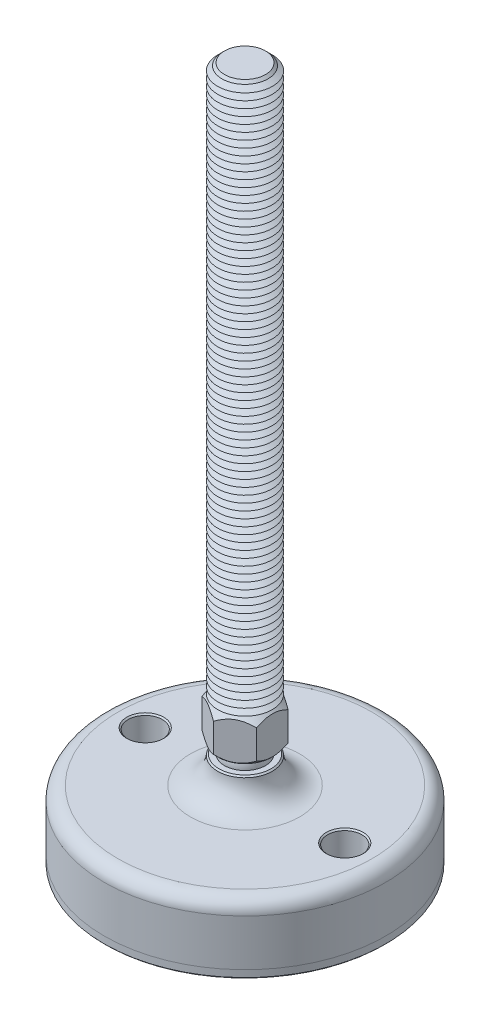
ISO-10303-21;
HEADER;
FILE_DESCRIPTION(('STEP AP214'),'2;1');
FILE_NAME('part.step','',(''),(''),'','','');
FILE_SCHEMA(('AUTOMOTIVE_DESIGN { 1 0 10303 214 1 1 1 1 }'));
ENDSEC;
DATA;
#1=APPLICATION_CONTEXT('core data for automotive mechanical design processes');
#2=APPLICATION_PROTOCOL_DEFINITION('international standard','automotive_design',2000,#1);
#3=PRODUCT_CONTEXT('',#1,'mechanical');
#4=PRODUCT('Part','Part','',(#3));
#5=PRODUCT_RELATED_PRODUCT_CATEGORY('part','',(#4));
#6=PRODUCT_DEFINITION_FORMATION('','',#4);
#7=PRODUCT_DEFINITION_CONTEXT('part definition',#1,'design');
#8=PRODUCT_DEFINITION('design','',#6,#7);
#9=PRODUCT_DEFINITION_SHAPE('','',#8);
#10=(LENGTH_UNIT() NAMED_UNIT(*) SI_UNIT(.MILLI.,.METRE.));
#11=(NAMED_UNIT(*) PLANE_ANGLE_UNIT() SI_UNIT($,.RADIAN.));
#12=(NAMED_UNIT(*) SI_UNIT($,.STERADIAN.) SOLID_ANGLE_UNIT());
#13=UNCERTAINTY_MEASURE_WITH_UNIT(LENGTH_MEASURE(1.E-05),#10,'distance_accuracy_value','');
#14=(GEOMETRIC_REPRESENTATION_CONTEXT(3) GLOBAL_UNCERTAINTY_ASSIGNED_CONTEXT((#13)) GLOBAL_UNIT_ASSIGNED_CONTEXT((#10,
#11,#12)) REPRESENTATION_CONTEXT('',''));
#15=CARTESIAN_POINT('',(0.,0.,0.));
#16=DIRECTION('',(0.,0.,1.));
#17=DIRECTION('',(1.,0.,0.));
#18=AXIS2_PLACEMENT_3D('',#15,#16,#17);
#19=CARTESIAN_POINT('',(0.,-32.,0.));
#20=DIRECTION('',(0.,1.,0.));
#21=DIRECTION('',(0.,0.,1.));
#22=AXIS2_PLACEMENT_3D('',#19,#20,#21);
#23=PLANE('',#22);
#24=CARTESIAN_POINT('',(-36.5,-32.,0.));
#25=DIRECTION('',(0.,1.,0.));
#26=DIRECTION('',(0.,0.,1.));
#27=AXIS2_PLACEMENT_3D('',#24,#25,#26);
#28=CIRCLE('',#27,6.25);
#29=CARTESIAN_POINT('',(-36.5,-32.,6.25));
#30=VERTEX_POINT('',#29);
#31=EDGE_CURVE('P0_E43',#30,#30,#28,.T.);
#32=ORIENTED_EDGE('',*,*,#31,.F.);
#33=EDGE_LOOP('',(#32));
#34=FACE_BOUND('',#33,.T.);
#35=CARTESIAN_POINT('',(36.5,-32.,0.));
#36=DIRECTION('',(0.,1.,0.));
#37=DIRECTION('',(0.,0.,1.));
#38=AXIS2_PLACEMENT_3D('',#35,#36,#37);
#39=CIRCLE('',#38,6.25);
#40=CARTESIAN_POINT('',(36.5,-32.,6.25));
#41=VERTEX_POINT('',#40);
#42=EDGE_CURVE('P0_E44',#41,#41,#39,.T.);
#43=ORIENTED_EDGE('',*,*,#42,.F.);
#44=EDGE_LOOP('',(#43));
#45=FACE_BOUND('',#44,.T.);
#46=CARTESIAN_POINT('',(0.,-32.,0.));
#47=DIRECTION('',(0.,1.,0.));
#48=DIRECTION('',(0.,0.,1.));
#49=AXIS2_PLACEMENT_3D('',#46,#47,#48);
#50=CIRCLE('',#49,51.5);
#51=CARTESIAN_POINT('',(0.,-32.,51.5));
#52=VERTEX_POINT('',#51);
#53=EDGE_CURVE('P0_E40',#52,#52,#50,.T.);
#54=ORIENTED_EDGE('',*,*,#53,.T.);
#55=EDGE_LOOP('',(#54));
#56=FACE_BOUND('',#55,.T.);
#57=ADVANCED_FACE('P0_F14',(#34,#45,#56),#23,.T.);
#58=CARTESIAN_POINT('',(0.,43.1654938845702,0.));
#59=DIRECTION('',(0.,1.,0.));
#60=DIRECTION('',(0.,0.,1.));
#61=AXIS2_PLACEMENT_3D('',#58,#59,#60);
#62=CYLINDRICAL_SURFACE('',#61,51.5);
#63=CARTESIAN_POINT('',(0.,-34.5,0.));
#64=DIRECTION('',(0.,-1.,0.));
#65=DIRECTION('',(0.,0.,-1.));
#66=AXIS2_PLACEMENT_3D('',#63,#64,#65);
#67=CIRCLE('',#66,51.5);
#68=CARTESIAN_POINT('',(0.,-34.5,-51.5));
#69=VERTEX_POINT('',#68);
#70=EDGE_CURVE('P0_E37',#69,#69,#67,.F.);
#71=ORIENTED_EDGE('',*,*,#70,.T.);
#72=EDGE_LOOP('',(#71));
#73=FACE_BOUND('',#72,.T.);
#74=ORIENTED_EDGE('',*,*,#53,.F.);
#75=EDGE_LOOP('',(#74));
#76=FACE_BOUND('',#75,.T.);
#77=ADVANCED_FACE('P0_F54',(#73,#76),#62,.T.);
#78=CARTESIAN_POINT('',(0.,-35.,51.5));
#79=DIRECTION('',(0.,-1.,0.));
#80=DIRECTION('',(0.,0.,-1.));
#81=AXIS2_PLACEMENT_3D('',#78,#79,#80);
#82=PLANE('',#81);
#83=CARTESIAN_POINT('',(36.5,-35.,0.));
#84=DIRECTION('',(0.,-1.,0.));
#85=DIRECTION('',(0.,0.,-1.));
#86=AXIS2_PLACEMENT_3D('',#83,#84,#85);
#87=CIRCLE('',#86,6.75000000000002);
#88=CARTESIAN_POINT('',(36.5,-35.,-6.75000000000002));
#89=VERTEX_POINT('',#88);
#90=EDGE_CURVE('P0_E25',#89,#89,#87,.F.);
#91=ORIENTED_EDGE('',*,*,#90,.T.);
#92=EDGE_LOOP('',(#91));
#93=FACE_BOUND('',#92,.T.);
#94=CARTESIAN_POINT('',(-36.5,-35.,0.));
#95=DIRECTION('',(0.,-1.,0.));
#96=DIRECTION('',(0.,0.,-1.));
#97=AXIS2_PLACEMENT_3D('',#94,#95,#96);
#98=CIRCLE('',#97,6.74999999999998);
#99=CARTESIAN_POINT('',(-36.5,-35.,-6.74999999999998));
#100=VERTEX_POINT('',#99);
#101=EDGE_CURVE('P0_E29',#100,#100,#98,.F.);
#102=ORIENTED_EDGE('',*,*,#101,.T.);
#103=EDGE_LOOP('',(#102));
#104=FACE_BOUND('',#103,.T.);
#105=CARTESIAN_POINT('',(0.,-35.,0.));
#106=DIRECTION('',(0.,-1.,0.));
#107=DIRECTION('',(0.,0.,-1.));
#108=AXIS2_PLACEMENT_3D('',#105,#106,#107);
#109=CIRCLE('',#108,51.);
#110=CARTESIAN_POINT('',(0.,-35.,-51.));
#111=VERTEX_POINT('',#110);
#112=EDGE_CURVE('P0_E34',#111,#111,#109,.T.);
#113=ORIENTED_EDGE('',*,*,#112,.T.);
#114=EDGE_LOOP('',(#113));
#115=FACE_BOUND('',#114,.T.);
#116=ADVANCED_FACE('P0_F61',(#93,#104,#115),#82,.T.);
#117=CARTESIAN_POINT('',(0.,-34.5,0.));
#118=DIRECTION('',(0.,1.,0.));
#119=DIRECTION('',(0.,0.,1.));
#120=AXIS2_PLACEMENT_3D('',#117,#118,#119);
#121=CONICAL_SURFACE('',#120,51.5,0.785398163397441);
#122=ORIENTED_EDGE('',*,*,#112,.F.);
#123=EDGE_LOOP('',(#122));
#124=FACE_BOUND('',#123,.T.);
#125=ORIENTED_EDGE('',*,*,#70,.F.);
#126=EDGE_LOOP('',(#125));
#127=FACE_BOUND('',#126,.T.);
#128=ADVANCED_FACE('P0_F68',(#124,#127),#121,.T.);
#129=CARTESIAN_POINT('',(36.5,-35.,0.));
#130=DIRECTION('',(0.,1.,0.));
#131=DIRECTION('',(0.,0.,1.));
#132=AXIS2_PLACEMENT_3D('',#129,#130,#131);
#133=CYLINDRICAL_SURFACE('',#132,6.25);
#134=CARTESIAN_POINT('',(36.5,-34.5,0.));
#135=DIRECTION('',(0.,-1.,0.));
#136=DIRECTION('',(0.,0.,-1.));
#137=AXIS2_PLACEMENT_3D('',#134,#135,#136);
#138=CIRCLE('',#137,6.25);
#139=CARTESIAN_POINT('',(36.5,-34.5,-6.25));
#140=VERTEX_POINT('',#139);
#141=EDGE_CURVE('P0_E21',#140,#140,#138,.T.);
#142=ORIENTED_EDGE('',*,*,#141,.T.);
#143=EDGE_LOOP('',(#142));
#144=FACE_BOUND('',#143,.T.);
#145=ORIENTED_EDGE('',*,*,#42,.T.);
#146=EDGE_LOOP('',(#145));
#147=FACE_BOUND('',#146,.T.);
#148=ADVANCED_FACE('P0_F74',(#144,#147),#133,.F.);
#149=CARTESIAN_POINT('',(-36.5,-35.,0.));
#150=DIRECTION('',(0.,1.,0.));
#151=DIRECTION('',(0.,0.,1.));
#152=AXIS2_PLACEMENT_3D('',#149,#150,#151);
#153=CYLINDRICAL_SURFACE('',#152,6.25);
#154=CARTESIAN_POINT('',(-36.5,-34.5,0.));
#155=DIRECTION('',(0.,-1.,0.));
#156=DIRECTION('',(0.,0.,-1.));
#157=AXIS2_PLACEMENT_3D('',#154,#155,#156);
#158=CIRCLE('',#157,6.25);
#159=CARTESIAN_POINT('',(-36.5,-34.5,-6.25));
#160=VERTEX_POINT('',#159);
#161=EDGE_CURVE('P0_E10',#160,#160,#158,.T.);
#162=ORIENTED_EDGE('',*,*,#161,.T.);
#163=EDGE_LOOP('',(#162));
#164=FACE_BOUND('',#163,.T.);
#165=ORIENTED_EDGE('',*,*,#31,.T.);
#166=EDGE_LOOP('',(#165));
#167=FACE_BOUND('',#166,.T.);
#168=ADVANCED_FACE('P0_F50',(#164,#167),#153,.F.);
#169=CARTESIAN_POINT('',(36.5,-35.,0.));
#170=DIRECTION('',(0.,-1.,0.));
#171=DIRECTION('',(0.,0.,-1.));
#172=AXIS2_PLACEMENT_3D('',#169,#170,#171);
#173=CONICAL_SURFACE('',#172,6.75000000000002,0.785398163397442);
#174=ORIENTED_EDGE('',*,*,#141,.F.);
#175=EDGE_LOOP('',(#174));
#176=FACE_BOUND('',#175,.T.);
#177=ORIENTED_EDGE('',*,*,#90,.F.);
#178=EDGE_LOOP('',(#177));
#179=FACE_BOUND('',#178,.T.);
#180=ADVANCED_FACE('P0_F76',(#176,#179),#173,.F.);
#181=CARTESIAN_POINT('',(-36.5,-35.,0.));
#182=DIRECTION('',(0.,-1.,0.));
#183=DIRECTION('',(0.,0.,-1.));
#184=AXIS2_PLACEMENT_3D('',#181,#182,#183);
#185=CONICAL_SURFACE('',#184,6.74999999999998,0.785398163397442);
#186=ORIENTED_EDGE('',*,*,#161,.F.);
#187=EDGE_LOOP('',(#186));
#188=FACE_BOUND('',#187,.T.);
#189=ORIENTED_EDGE('',*,*,#101,.F.);
#190=EDGE_LOOP('',(#189));
#191=FACE_BOUND('',#190,.T.);
#192=ADVANCED_FACE('P0_F16',(#188,#191),#185,.F.);
#193=CLOSED_SHELL('',(#57,#77,#116,#128,#148,#168,#180,#192));
#194=MANIFOLD_SOLID_BREP('P0_B1',#193);
#195=CARTESIAN_POINT('',(0.,3.75,0.));
#196=DIRECTION('',(0.,1.,0.));
#197=DIRECTION('',(0.,0.,1.));
#198=AXIS2_PLACEMENT_3D('',#195,#196,#197);
#199=PLANE('',#198);
#200=CARTESIAN_POINT('',(0.,3.75,0.));
#201=DIRECTION('',(0.,1.,0.));
#202=DIRECTION('',(0.,0.,1.));
#203=AXIS2_PLACEMENT_3D('',#200,#201,#202);
#204=CIRCLE('',#203,9.72829454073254);
#205=CARTESIAN_POINT('',(0.,3.75,9.72829454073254));
#206=VERTEX_POINT('',#205);
#207=EDGE_CURVE('P1_E213',#206,#206,#204,.T.);
#208=ORIENTED_EDGE('',*,*,#207,.F.);
#209=EDGE_LOOP('',(#208));
#210=FACE_BOUND('',#209,.T.);
#211=CARTESIAN_POINT('',(0.,3.75,0.));
#212=DIRECTION('',(0.,1.,0.));
#213=DIRECTION('',(0.,0.,1.));
#214=AXIS2_PLACEMENT_3D('',#211,#212,#213);
#215=CIRCLE('',#214,6.49519052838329);
#216=CARTESIAN_POINT('',(0.,3.75,6.49519052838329));
#217=VERTEX_POINT('',#216);
#218=EDGE_CURVE('P1_E25',#217,#217,#215,.F.);
#219=ORIENTED_EDGE('',*,*,#218,.F.);
#220=EDGE_LOOP('',(#219));
#221=FACE_BOUND('',#220,.T.);
#222=ADVANCED_FACE('P1_F16',(#210,#221),#199,.F.);
#223=CARTESIAN_POINT('',(0.,0.,0.));
#224=DIRECTION('',(0.,1.,0.));
#225=DIRECTION('',(0.,0.,-1.));
#226=AXIS2_PLACEMENT_3D('',#223,#224,#225);
#227=SPHERICAL_SURFACE('',#226,7.5);
#228=ORIENTED_EDGE('',*,*,#218,.T.);
#229=EDGE_LOOP('',(#228));
#230=FACE_BOUND('',#229,.T.);
#231=ADVANCED_FACE('P1_F203',(#230),#227,.T.);
#232=CARTESIAN_POINT('',(0.,3.75,0.));
#233=DIRECTION('',(0.,1.,0.));
#234=DIRECTION('',(0.,0.,1.));
#235=AXIS2_PLACEMENT_3D('',#232,#233,#234);
#236=CONICAL_SURFACE('',#235,9.72829454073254,0.785398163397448);
#237=ORIENTED_EDGE('',*,*,#207,.T.);
#238=EDGE_LOOP('',(#237));
#239=FACE_BOUND('',#238,.T.);
#240=CARTESIAN_POINT('',(-10.,9.59571642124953,-11.9394228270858));
#241=CARTESIAN_POINT('',(-10.,9.37430561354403,-11.6505452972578));
#242=CARTESIAN_POINT('',(-10.,9.15490936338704,-11.3600988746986));
#243=CARTESIAN_POINT('',(-10.,8.72106267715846,-10.7754314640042));
#244=CARTESIAN_POINT('',(-10.,8.50661343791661,-10.4812095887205));
#245=CARTESIAN_POINT('',(-10.,8.08205114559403,-9.88620330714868));
#246=CARTESIAN_POINT('',(-10.,7.87198437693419,-9.58538576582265));
#247=CARTESIAN_POINT('',(-10.,7.45926520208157,-8.97872312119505));
#248=CARTESIAN_POINT('',(-10.,7.25661228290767,-8.67287836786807));
#249=CARTESIAN_POINT('',(-10.,6.84809543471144,-8.03614350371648));
#250=CARTESIAN_POINT('',(-10.,6.64281401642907,-7.70487777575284));
#251=CARTESIAN_POINT('',(-10.,6.245142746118,-7.03457466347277));
#252=CARTESIAN_POINT('',(-10.,6.0527550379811,-6.69553599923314));
#253=CARTESIAN_POINT('',(-10.,5.68497951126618,-6.00961937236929));
#254=CARTESIAN_POINT('',(-10.,5.50954176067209,-5.66276839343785));
#255=CARTESIAN_POINT('',(-10.,5.17959635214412,-4.95932933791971));
#256=CARTESIAN_POINT('',(-10.,5.02507889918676,-4.60274591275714));
#257=CARTESIAN_POINT('',(-10.,4.75599518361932,-3.91353381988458));
#258=CARTESIAN_POINT('',(-10.,4.63902686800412,-3.58185263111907));
#259=CARTESIAN_POINT('',(-10.,4.43164927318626,-2.91013341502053));
#260=CARTESIAN_POINT('',(-10.,4.34124171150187,-2.57009484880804));
#261=CARTESIAN_POINT('',(-10.,4.19334931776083,-1.88955843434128));
#262=CARTESIAN_POINT('',(-10.,4.13527351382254,-1.54919119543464));
#263=CARTESIAN_POINT('',(-10.,4.05324021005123,-0.864347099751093));
#264=CARTESIAN_POINT('',(-10.,4.029275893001,-0.519871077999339));
#265=CARTESIAN_POINT('',(-10.,4.01745435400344,0.155191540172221));
#266=CARTESIAN_POINT('',(-10.,4.02812008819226,0.485752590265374));
#267=CARTESIAN_POINT('',(-10.,4.08160326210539,1.1442457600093));
#268=CARTESIAN_POINT('',(-10.,4.12442366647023,1.47217763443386));
#269=CARTESIAN_POINT('',(-10.,4.24054019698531,2.12859326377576));
#270=CARTESIAN_POINT('',(-10.,4.31437036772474,2.45698095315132));
#271=CARTESIAN_POINT('',(-10.,4.48844287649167,3.10654175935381));
#272=CARTESIAN_POINT('',(-10.,4.58868356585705,3.42771532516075));
#273=CARTESIAN_POINT('',(-10.,4.81839210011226,4.08271396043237));
#274=CARTESIAN_POINT('',(-10.,4.94932842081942,4.41601827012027));
#275=CARTESIAN_POINT('',(-10.,5.23140828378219,5.07403931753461));
#276=CARTESIAN_POINT('',(-10.,5.38256099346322,5.3987520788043));
#277=CARTESIAN_POINT('',(-10.,5.70148727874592,6.04113299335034));
#278=CARTESIAN_POINT('',(-10.,5.86931223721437,6.35877542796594));
#279=CARTESIAN_POINT('',(-10.,6.21788686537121,6.98677627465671));
#280=CARTESIAN_POINT('',(-10.,6.39863453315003,7.29713580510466));
#281=CARTESIAN_POINT('',(-10.,6.76133545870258,7.89633938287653));
#282=CARTESIAN_POINT('',(-10.,6.94278731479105,8.18548854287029));
#283=CARTESIAN_POINT('',(-10.,7.31339871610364,8.75881961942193));
#284=CARTESIAN_POINT('',(-10.,7.50255884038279,9.04300116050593));
#285=CARTESIAN_POINT('',(-10.,7.8856676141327,9.6047584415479));
#286=CARTESIAN_POINT('',(-10.,8.07956548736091,9.88236893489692));
#287=CARTESIAN_POINT('',(-10.,8.47254700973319,10.4337838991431));
#288=CARTESIAN_POINT('',(-10.,8.67162921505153,10.7075893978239));
#289=CARTESIAN_POINT('',(-10.,8.87283307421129,10.9797992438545));
#290=B_SPLINE_CURVE_WITH_KNOTS('',3,(#240,#241,#242,#243,#244,#245,#246,#247,#248,#249,#250,
#251,#252,#253,#254,#255,#256,#257,#258,#259,#260,#261,#262,#263,#264,#265,#266,#267,#268,#269,
#270,#271,#272,#273,#274,#275,#276,#277,#278,#279,#280,#281,#282,#283,#284,#285,#286,#287,#288,
#289),.UNSPECIFIED.,.F.,.F.,(4,2,2,2,2,2,2,2,2,2,2,2,2,2,2,2,2,2,2,2,2,2,2,2,4),(0.,
1.09192545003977,2.18411235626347,3.28473497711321,4.3852812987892,5.5541916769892,
6.72329593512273,7.88884387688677,9.05384420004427,10.1080362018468,11.1622963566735,
12.1965943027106,13.2306855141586,14.2212593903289,15.2119246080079,16.2203997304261,
17.2288119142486,18.3022883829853,19.3762532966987,20.4536373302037,21.5308548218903,
22.5548150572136,23.5788523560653,24.5946500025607,25.6101677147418),.UNSPECIFIED.);
#291=CARTESIAN_POINT('',(-10.,5.56871084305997,-5.77350269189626));
#292=VERTEX_POINT('',#291);
#293=CARTESIAN_POINT('',(-10.,5.56871084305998,5.77350269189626));
#294=VERTEX_POINT('',#293);
#295=EDGE_CURVE('P1_E187',#292,#294,#290,.T.);
#296=ORIENTED_EDGE('',*,*,#295,.F.);
#297=CARTESIAN_POINT('',(0.000199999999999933,5.56882631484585,-11.5471208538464));
#298=CARTESIAN_POINT('',(-0.171722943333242,5.4695807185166,-11.447861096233));
#299=CARTESIAN_POINT('',(-0.344992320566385,5.37336355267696,-11.3478239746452));
#300=CARTESIAN_POINT('',(-0.694433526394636,5.18794806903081,-11.1460740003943));
#301=CARTESIAN_POINT('',(-0.870606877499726,5.09875358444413,-11.0443602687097));
#302=CARTESIAN_POINT('',(-1.22689656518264,4.92796770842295,-10.8386563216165));
#303=CARTESIAN_POINT('',(-1.40702970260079,4.84642277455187,-10.7346564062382));
#304=CARTESIAN_POINT('',(-1.77025459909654,4.69270708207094,-10.52494841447));
#305=CARTESIAN_POINT('',(-1.95334590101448,4.62053489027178,-10.4192406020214));
#306=CARTESIAN_POINT('',(-2.31954331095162,4.4878482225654,-10.2078164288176));
#307=CARTESIAN_POINT('',(-2.50260441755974,4.42716910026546,-10.1021260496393));
#308=CARTESIAN_POINT('',(-2.87129282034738,4.31731511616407,-9.88926370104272));
#309=CARTESIAN_POINT('',(-3.05691983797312,4.26813901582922,-9.78209189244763));
#310=CARTESIAN_POINT('',(-3.42994608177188,4.1825291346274,-9.56672509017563));
#311=CARTESIAN_POINT('',(-3.61734032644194,4.14606667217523,-9.45853297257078));
#312=CARTESIAN_POINT('',(-3.99370204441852,4.08668528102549,-9.24124043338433));
#313=CARTESIAN_POINT('',(-4.1826692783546,4.06376432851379,-9.13214015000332));
#314=CARTESIAN_POINT('',(-4.64316633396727,4.0253323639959,-8.86627205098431));
#315=CARTESIAN_POINT('',(-4.91519388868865,4.01726744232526,-8.70921686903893));
#316=CARTESIAN_POINT('',(-5.45875701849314,4.03080424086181,-8.39539054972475));
#317=CARTESIAN_POINT('',(-5.7302923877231,4.05241636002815,-8.23861953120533));
#318=CARTESIAN_POINT('',(-6.27080349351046,4.12403157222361,-7.92655529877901));
#319=CARTESIAN_POINT('',(-6.53977602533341,4.17406641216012,-7.77126393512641));
#320=CARTESIAN_POINT('',(-7.07309796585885,4.29980733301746,-7.46335036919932));
#321=CARTESIAN_POINT('',(-7.33744772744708,4.3755114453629,-7.31072796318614));
#322=CARTESIAN_POINT('',(-7.80670351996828,4.53125365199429,-7.03980300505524));
#323=CARTESIAN_POINT('',(-8.01264886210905,4.60719488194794,-6.92090040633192));
#324=CARTESIAN_POINT('',(-8.42084280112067,4.77131434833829,-6.68522952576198));
#325=CARTESIAN_POINT('',(-8.62309128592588,4.85949295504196,-6.5684613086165));
#326=CARTESIAN_POINT('',(-9.02325448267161,5.04611070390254,-6.33742697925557));
#327=CARTESIAN_POINT('',(-9.22118057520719,5.1445175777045,-6.2231542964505));
#328=CARTESIAN_POINT('',(-9.61336795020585,5.35030005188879,-5.99672480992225));
#329=CARTESIAN_POINT('',(-9.80763139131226,5.45767015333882,-5.88456675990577));
#330=CARTESIAN_POINT('',(-10.0002,5.56882631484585,-5.77338722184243));
#331=B_SPLINE_CURVE_WITH_KNOTS('',3,(#297,#298,#299,#300,#301,#302,#303,#304,#305,#306,#307,
#308,#309,#310,#311,#312,#313,#314,#315,#316,#317,#318,#319,#320,#321,#322,#323,#324,#325,#326,
#327,#328,#329,#330),.UNSPECIFIED.,.F.,.F.,(4,2,2,2,2,2,2,2,2,2,2,2,2,2,2,2,4),(0.,
0.665863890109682,1.33208874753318,2.00212824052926,2.67206515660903,3.33152613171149,
3.99091606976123,4.64880867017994,5.30660292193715,6.24777541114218,7.18927777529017,
8.13183382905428,9.07431761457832,9.82287578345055,10.5714566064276,11.3177436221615,
12.0635761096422),.UNSPECIFIED.);
#332=CARTESIAN_POINT('',(0.,5.56871084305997,-11.5470053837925));
#333=VERTEX_POINT('',#332);
#334=EDGE_CURVE('P1_E181',#333,#292,#331,.T.);
#335=ORIENTED_EDGE('',*,*,#334,.F.);
#336=CARTESIAN_POINT('',(10.0002,5.56882631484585,-5.77338722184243));
#337=CARTESIAN_POINT('',(9.82827705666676,5.4695807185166,-5.87264697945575));
#338=CARTESIAN_POINT('',(9.65500767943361,5.37336355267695,-5.97268410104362));
#339=CARTESIAN_POINT('',(9.30556647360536,5.18794806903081,-6.17443407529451));
#340=CARTESIAN_POINT('',(9.12939312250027,5.09875358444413,-6.27614780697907));
#341=CARTESIAN_POINT('',(8.77310343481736,4.92796770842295,-6.48185175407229));
#342=CARTESIAN_POINT('',(8.59297029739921,4.84642277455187,-6.58585166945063));
#343=CARTESIAN_POINT('',(8.22974540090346,4.69270708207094,-6.79555966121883));
#344=CARTESIAN_POINT('',(8.04665409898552,4.62053489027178,-6.90126747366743));
#345=CARTESIAN_POINT('',(7.68045668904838,4.4878482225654,-7.11269164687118));
#346=CARTESIAN_POINT('',(7.49739558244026,4.42716910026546,-7.21838202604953));
#347=CARTESIAN_POINT('',(7.12870717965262,4.31731511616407,-7.43124437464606));
#348=CARTESIAN_POINT('',(6.94308016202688,4.26813901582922,-7.53841618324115));
#349=CARTESIAN_POINT('',(6.57005391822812,4.1825291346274,-7.75378298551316));
#350=CARTESIAN_POINT('',(6.38265967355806,4.14606667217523,-7.861975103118));
#351=CARTESIAN_POINT('',(6.00629795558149,4.08668528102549,-8.07926764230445));
#352=CARTESIAN_POINT('',(5.81733072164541,4.06376432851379,-8.18836792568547));
#353=CARTESIAN_POINT('',(5.35683366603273,4.0253323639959,-8.45423602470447));
#354=CARTESIAN_POINT('',(5.08480611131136,4.01726744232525,-8.61129120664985));
#355=CARTESIAN_POINT('',(4.54124298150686,4.03080424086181,-8.92511752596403));
#356=CARTESIAN_POINT('',(4.2697076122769,4.05241636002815,-9.08188854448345));
#357=CARTESIAN_POINT('',(3.72919650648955,4.12403157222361,-9.39395277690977));
#358=CARTESIAN_POINT('',(3.46022397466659,4.17406641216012,-9.54924414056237));
#359=CARTESIAN_POINT('',(2.92690203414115,4.29980733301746,-9.85715770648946));
#360=CARTESIAN_POINT('',(2.66255227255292,4.37551144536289,-10.0097801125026));
#361=CARTESIAN_POINT('',(2.19329648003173,4.53125365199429,-10.2807050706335));
#362=CARTESIAN_POINT('',(1.98735113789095,4.60719488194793,-10.3996076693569));
#363=CARTESIAN_POINT('',(1.57915719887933,4.77131434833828,-10.6352785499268));
#364=CARTESIAN_POINT('',(1.37690871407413,4.85949295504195,-10.7520467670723));
#365=CARTESIAN_POINT('',(0.976745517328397,5.04611070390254,-10.9830810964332));
#366=CARTESIAN_POINT('',(0.77881942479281,5.1445175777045,-11.0973537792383));
#367=CARTESIAN_POINT('',(0.386632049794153,5.35030005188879,-11.3237832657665));
#368=CARTESIAN_POINT('',(0.192368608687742,5.45767015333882,-11.435941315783));
#369=CARTESIAN_POINT('',(-0.000199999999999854,5.56882631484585,-11.5471208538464));
#370=B_SPLINE_CURVE_WITH_KNOTS('',3,(#336,#337,#338,#339,#340,#341,#342,#343,#344,#345,#346,
#347,#348,#349,#350,#351,#352,#353,#354,#355,#356,#357,#358,#359,#360,#361,#362,#363,#364,#365,
#366,#367,#368,#369),.UNSPECIFIED.,.F.,.F.,(4,2,2,2,2,2,2,2,2,2,2,2,2,2,2,2,4),(0.,
0.665863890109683,1.33208874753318,2.00212824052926,2.67206515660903,3.33152613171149,
3.99091606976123,4.64880867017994,5.30660292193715,6.24777541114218,7.18927777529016,
8.13183382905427,9.07431761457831,9.82287578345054,10.5714566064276,11.3177436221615,
12.0635761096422),.UNSPECIFIED.);
#371=CARTESIAN_POINT('',(9.99999999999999,5.56871084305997,-5.77350269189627));
#372=VERTEX_POINT('',#371);
#373=EDGE_CURVE('P1_E169',#372,#333,#370,.T.);
#374=ORIENTED_EDGE('',*,*,#373,.F.);
#375=CARTESIAN_POINT('',(10.,9.59571642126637,-11.9394228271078));
#376=CARTESIAN_POINT('',(10.,9.37430561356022,-11.6505452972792));
#377=CARTESIAN_POINT('',(10.,9.15490936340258,-11.3600988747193));
#378=CARTESIAN_POINT('',(10.,8.7210626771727,-10.7754314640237));
#379=CARTESIAN_POINT('',(10.,8.5066134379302,-10.4812095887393));
#380=CARTESIAN_POINT('',(10.,8.08205114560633,-9.88620330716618));
#381=CARTESIAN_POINT('',(10.,7.87198437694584,-9.58538576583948));
#382=CARTESIAN_POINT('',(10.,7.45926520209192,-8.97872312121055));
#383=CARTESIAN_POINT('',(10.,7.25661228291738,-8.67287836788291));
#384=CARTESIAN_POINT('',(10.,6.84809543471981,-8.03614350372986));
#385=CARTESIAN_POINT('',(10.,6.64281401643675,-7.70487777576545));
#386=CARTESIAN_POINT('',(10.,6.24514274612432,-7.03457466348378));
#387=CARTESIAN_POINT('',(10.,6.05275503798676,-6.69553599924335));
#388=CARTESIAN_POINT('',(10.,5.68497951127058,-6.00961937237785));
#389=CARTESIAN_POINT('',(10.,5.50954176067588,-5.66276839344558));
#390=CARTESIAN_POINT('',(10.,5.17959635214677,-4.95932933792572));
#391=CARTESIAN_POINT('',(10.,5.02507889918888,-4.60274591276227));
#392=CARTESIAN_POINT('',(10.,4.75599518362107,-3.91353381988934));
#393=CARTESIAN_POINT('',(10.,4.63902686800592,-3.58185263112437));
#394=CARTESIAN_POINT('',(10.,4.43164927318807,-2.91013341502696));
#395=CARTESIAN_POINT('',(10.,4.34124171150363,-2.57009484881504));
#396=CARTESIAN_POINT('',(10.,4.19334931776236,-1.8895584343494));
#397=CARTESIAN_POINT('',(10.,4.13527351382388,-1.54919119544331));
#398=CARTESIAN_POINT('',(10.,4.05324021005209,-0.86434709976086));
#399=CARTESIAN_POINT('',(10.,4.02927589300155,-0.519871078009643));
#400=CARTESIAN_POINT('',(10.,4.01745435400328,0.155191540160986));
#401=CARTESIAN_POINT('',(10.,4.0281200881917,0.485752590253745));
#402=CARTESIAN_POINT('',(10.,4.08160326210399,1.14424575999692));
#403=CARTESIAN_POINT('',(10.,4.12442366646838,1.47217763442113));
#404=CARTESIAN_POINT('',(10.,4.24054019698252,2.12859326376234));
#405=CARTESIAN_POINT('',(10.,4.31437036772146,2.45698095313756));
#406=CARTESIAN_POINT('',(10.,4.48844287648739,3.1065417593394));
#407=CARTESIAN_POINT('',(10.,4.58868356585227,3.42771532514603));
#408=CARTESIAN_POINT('',(10.,4.81839210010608,4.08271396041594));
#409=CARTESIAN_POINT('',(10.,4.94932842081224,4.41601827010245));
#410=CARTESIAN_POINT('',(10.,5.23140828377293,5.0740393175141));
#411=CARTESIAN_POINT('',(10.,5.38256099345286,5.39875207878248));
#412=CARTESIAN_POINT('',(10.,5.70148727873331,6.04113299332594));
#413=CARTESIAN_POINT('',(10.,5.86931223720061,6.35877542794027));
#414=CARTESIAN_POINT('',(10.,6.21788686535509,6.98677627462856));
#415=CARTESIAN_POINT('',(10.,6.39863453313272,7.29713580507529));
#416=CARTESIAN_POINT('',(10.,6.761335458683,7.89633938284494));
#417=CARTESIAN_POINT('',(10.,6.9427873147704,8.18548854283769));
#418=CARTESIAN_POINT('',(10.,7.31339871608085,8.75881961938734));
#419=CARTESIAN_POINT('',(10.,7.50255884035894,9.04300116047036));
#420=CARTESIAN_POINT('',(10.,7.88566761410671,9.60475844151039));
#421=CARTESIAN_POINT('',(10.,8.07956548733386,9.88236893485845));
#422=CARTESIAN_POINT('',(10.,8.47254700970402,10.4337838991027));
#423=CARTESIAN_POINT('',(10.,8.6716292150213,10.7075893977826));
#424=CARTESIAN_POINT('',(10.,8.87283307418,10.9797992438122));
#425=B_SPLINE_CURVE_WITH_KNOTS('',3,(#375,#376,#377,#378,#379,#380,#381,#382,#383,#384,#385,
#386,#387,#388,#389,#390,#391,#392,#393,#394,#395,#396,#397,#398,#399,#400,#401,#402,#403,#404,
#405,#406,#407,#408,#409,#410,#411,#412,#413,#414,#415,#416,#417,#418,#419,#420,#421,#422,#423,
#424),.UNSPECIFIED.,.F.,.F.,(4,2,2,2,2,2,2,2,2,2,2,2,2,2,2,2,2,2,2,2,2,2,2,2,4),(0.,
1.09192545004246,2.18411235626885,3.28473497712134,4.38528129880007,5.55419167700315,
6.72329593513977,7.88884387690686,9.05384420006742,10.1080362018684,11.1622963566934,
12.196594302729,13.2306855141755,14.2212593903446,15.2119246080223,16.2203997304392,
17.2288119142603,18.3022883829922,19.3762532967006,20.4536373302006,21.5308548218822,
22.5548150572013,23.5788523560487,24.5946500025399,25.6101677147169),.UNSPECIFIED.);
#426=CARTESIAN_POINT('',(10.,5.56871084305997,5.77350269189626));
#427=VERTEX_POINT('',#426);
#428=EDGE_CURVE('P1_E71',#427,#372,#425,.F.);
#429=ORIENTED_EDGE('',*,*,#428,.F.);
#430=CARTESIAN_POINT('',(-0.000200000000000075,5.56882631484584,11.5471208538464));
#431=CARTESIAN_POINT('',(0.171722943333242,5.4695807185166,11.447861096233));
#432=CARTESIAN_POINT('',(0.344992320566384,5.37336355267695,11.3478239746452));
#433=CARTESIAN_POINT('',(0.694433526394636,5.18794806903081,11.1460740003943));
#434=CARTESIAN_POINT('',(0.870606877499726,5.09875358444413,11.0443602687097));
#435=CARTESIAN_POINT('',(1.22689656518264,4.92796770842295,10.8386563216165));
#436=CARTESIAN_POINT('',(1.40702970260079,4.84642277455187,10.7346564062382));
#437=CARTESIAN_POINT('',(1.77025459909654,4.69270708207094,10.52494841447));
#438=CARTESIAN_POINT('',(1.95334590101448,4.62053489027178,10.4192406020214));
#439=CARTESIAN_POINT('',(2.31954331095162,4.4878482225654,10.2078164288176));
#440=CARTESIAN_POINT('',(2.50260441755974,4.42716910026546,10.1021260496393));
#441=CARTESIAN_POINT('',(2.87129282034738,4.31731511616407,9.88926370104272));
#442=CARTESIAN_POINT('',(3.05691983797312,4.26813901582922,9.78209189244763));
#443=CARTESIAN_POINT('',(3.42994608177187,4.18252913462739,9.56672509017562));
#444=CARTESIAN_POINT('',(3.61734032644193,4.14606667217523,9.45853297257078));
#445=CARTESIAN_POINT('',(3.99370204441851,4.08668528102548,9.24124043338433));
#446=CARTESIAN_POINT('',(4.18266927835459,4.06376432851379,9.13214015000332));
#447=CARTESIAN_POINT('',(4.64316633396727,4.0253323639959,8.86627205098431));
#448=CARTESIAN_POINT('',(4.91519388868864,4.01726744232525,8.70921686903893));
#449=CARTESIAN_POINT('',(5.45875701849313,4.03080424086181,8.39539054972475));
#450=CARTESIAN_POINT('',(5.7302923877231,4.05241636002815,8.23861953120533));
#451=CARTESIAN_POINT('',(6.27080349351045,4.1240315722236,7.92655529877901));
#452=CARTESIAN_POINT('',(6.53977602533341,4.17406641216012,7.77126393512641));
#453=CARTESIAN_POINT('',(7.07309796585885,4.29980733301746,7.46335036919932));
#454=CARTESIAN_POINT('',(7.33744772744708,4.37551144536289,7.31072796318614));
#455=CARTESIAN_POINT('',(7.80670351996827,4.53125365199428,7.03980300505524));
#456=CARTESIAN_POINT('',(8.01264886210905,4.60719488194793,6.92090040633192));
#457=CARTESIAN_POINT('',(8.42084280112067,4.77131434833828,6.68522952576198));
#458=CARTESIAN_POINT('',(8.62309128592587,4.85949295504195,6.5684613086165));
#459=CARTESIAN_POINT('',(9.0232544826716,5.04611070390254,6.33742697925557));
#460=CARTESIAN_POINT('',(9.22118057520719,5.1445175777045,6.2231542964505));
#461=CARTESIAN_POINT('',(9.61336795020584,5.35030005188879,5.99672480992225));
#462=CARTESIAN_POINT('',(9.80763139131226,5.45767015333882,5.88456675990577));
#463=CARTESIAN_POINT('',(10.0002,5.56882631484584,5.77338722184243));
#464=B_SPLINE_CURVE_WITH_KNOTS('',3,(#430,#431,#432,#433,#434,#435,#436,#437,#438,#439,#440,
#441,#442,#443,#444,#445,#446,#447,#448,#449,#450,#451,#452,#453,#454,#455,#456,#457,#458,#459,
#460,#461,#462,#463),.UNSPECIFIED.,.F.,.F.,(4,2,2,2,2,2,2,2,2,2,2,2,2,2,2,2,4),(0.,
0.665863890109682,1.33208874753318,2.00212824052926,2.67206515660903,3.33152613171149,
3.99091606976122,4.64880867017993,5.30660292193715,6.24777541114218,7.18927777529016,
8.13183382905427,9.07431761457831,9.82287578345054,10.5714566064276,11.3177436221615,
12.0635761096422),.UNSPECIFIED.);
#465=CARTESIAN_POINT('',(0.,5.56871084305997,11.5470053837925));
#466=VERTEX_POINT('',#465);
#467=EDGE_CURVE('P1_E68',#466,#427,#464,.T.);
#468=ORIENTED_EDGE('',*,*,#467,.F.);
#469=CARTESIAN_POINT('',(-10.0002,5.56882631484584,5.77338722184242));
#470=CARTESIAN_POINT('',(-9.82827705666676,5.4695807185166,5.87264697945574));
#471=CARTESIAN_POINT('',(-9.65500767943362,5.37336355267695,5.97268410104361));
#472=CARTESIAN_POINT('',(-9.30556647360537,5.18794806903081,6.1744340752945));
#473=CARTESIAN_POINT('',(-9.12939312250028,5.09875358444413,6.27614780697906));
#474=CARTESIAN_POINT('',(-8.77310343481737,4.92796770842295,6.48185175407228));
#475=CARTESIAN_POINT('',(-8.59297029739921,4.84642277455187,6.58585166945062));
#476=CARTESIAN_POINT('',(-8.22974540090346,4.69270708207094,6.79555966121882));
#477=CARTESIAN_POINT('',(-8.04665409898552,4.62053489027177,6.90126747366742));
#478=CARTESIAN_POINT('',(-7.68045668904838,4.48784822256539,7.11269164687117));
#479=CARTESIAN_POINT('',(-7.49739558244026,4.42716910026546,7.21838202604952));
#480=CARTESIAN_POINT('',(-7.12870717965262,4.31731511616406,7.43124437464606));
#481=CARTESIAN_POINT('',(-6.94308016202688,4.26813901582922,7.53841618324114));
#482=CARTESIAN_POINT('',(-6.57005391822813,4.18252913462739,7.75378298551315));
#483=CARTESIAN_POINT('',(-6.38265967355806,4.14606667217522,7.861975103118));
#484=CARTESIAN_POINT('',(-6.00629795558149,4.08668528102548,8.07926764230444));
#485=CARTESIAN_POINT('',(-5.81733072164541,4.06376432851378,8.18836792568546));
#486=CARTESIAN_POINT('',(-5.35683366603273,4.0253323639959,8.45423602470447));
#487=CARTESIAN_POINT('',(-5.08480611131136,4.01726744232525,8.61129120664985));
#488=CARTESIAN_POINT('',(-4.54124298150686,4.0308042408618,8.92511752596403));
#489=CARTESIAN_POINT('',(-4.2697076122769,4.05241636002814,9.08188854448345));
#490=CARTESIAN_POINT('',(-3.72919650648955,4.1240315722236,9.39395277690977));
#491=CARTESIAN_POINT('',(-3.46022397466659,4.17406641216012,9.54924414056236));
#492=CARTESIAN_POINT('',(-2.92690203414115,4.29980733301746,9.85715770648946));
#493=CARTESIAN_POINT('',(-2.66255227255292,4.37551144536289,10.0097801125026));
#494=CARTESIAN_POINT('',(-2.19329648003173,4.53125365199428,10.2807050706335));
#495=CARTESIAN_POINT('',(-1.98735113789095,4.60719488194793,10.3996076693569));
#496=CARTESIAN_POINT('',(-1.57915719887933,4.77131434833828,10.6352785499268));
#497=CARTESIAN_POINT('',(-1.37690871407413,4.85949295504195,10.7520467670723));
#498=CARTESIAN_POINT('',(-0.976745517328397,5.04611070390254,10.9830810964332));
#499=CARTESIAN_POINT('',(-0.778819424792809,5.1445175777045,11.0973537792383));
#500=CARTESIAN_POINT('',(-0.386632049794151,5.35030005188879,11.3237832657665));
#501=CARTESIAN_POINT('',(-0.192368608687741,5.45767015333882,11.435941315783));
#502=CARTESIAN_POINT('',(0.000199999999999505,5.56882631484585,11.5471208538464));
#503=B_SPLINE_CURVE_WITH_KNOTS('',3,(#469,#470,#471,#472,#473,#474,#475,#476,#477,#478,#479,
#480,#481,#482,#483,#484,#485,#486,#487,#488,#489,#490,#491,#492,#493,#494,#495,#496,#497,#498,
#499,#500,#501,#502),.UNSPECIFIED.,.F.,.F.,(4,2,2,2,2,2,2,2,2,2,2,2,2,2,2,2,4),(0.,
0.665863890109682,1.33208874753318,2.00212824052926,2.67206515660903,3.33152613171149,
3.99091606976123,4.64880867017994,5.30660292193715,6.24777541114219,7.18927777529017,
8.13183382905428,9.07431761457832,9.82287578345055,10.5714566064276,11.3177436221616,
12.0635761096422),.UNSPECIFIED.);
#504=EDGE_CURVE('P1_E40',#294,#466,#503,.T.);
#505=ORIENTED_EDGE('',*,*,#504,.F.);
#506=EDGE_LOOP('',(#296,#335,#374,#429,#468,#505));
#507=FACE_BOUND('',#506,.T.);
#508=ADVANCED_FACE('P1_F69',(#239,#507),#236,.T.);
#509=CARTESIAN_POINT('',(-10.,19.,-5.77350269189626));
#510=DIRECTION('',(1.,0.,0.));
#511=DIRECTION('',(0.,0.,-1.));
#512=AXIS2_PLACEMENT_3D('',#509,#510,#511);
#513=PLANE('',#512);
#514=DIRECTION('',(0.,-1.,0.));
#515=VECTOR('',#514,1.);
#516=CARTESIAN_POINT('',(-10.,19.,5.77350269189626));
#517=LINE('',#516,#515);
#518=CARTESIAN_POINT('',(-10.,16.1132486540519,5.77350269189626));
#519=VERTEX_POINT('',#518);
#520=EDGE_CURVE('P1_E84',#519,#294,#517,.T.);
#521=ORIENTED_EDGE('',*,*,#520,.F.);
#522=CARTESIAN_POINT('',(-10.,12.4093918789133,-11.5147208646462));
#523=CARTESIAN_POINT('',(-10.,12.6210295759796,-11.2343500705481));
#524=CARTESIAN_POINT('',(-10.,12.8306215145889,-10.9524094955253));
#525=CARTESIAN_POINT('',(-10.,13.2447979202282,-10.3847695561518));
#526=CARTESIAN_POINT('',(-10.,13.4493811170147,-10.0990692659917));
#527=CARTESIAN_POINT('',(-10.,13.8540786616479,-9.52120077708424));
#528=CARTESIAN_POINT('',(-10.,14.0541461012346,-9.22899961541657));
#529=CARTESIAN_POINT('',(-10.,14.4468132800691,-8.63963749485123));
#530=CARTESIAN_POINT('',(-10.,14.6394135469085,-8.34247688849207));
#531=CARTESIAN_POINT('',(-10.,15.0262335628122,-7.72525702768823));
#532=CARTESIAN_POINT('',(-10.,15.2199166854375,-7.40485974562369));
#533=CARTESIAN_POINT('',(-10.,15.5945399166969,-6.75658646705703));
#534=CARTESIAN_POINT('',(-10.,15.7754780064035,-6.4287092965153));
#535=CARTESIAN_POINT('',(-10.,16.1207071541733,-5.76550673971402));
#536=CARTESIAN_POINT('',(-10.,16.285047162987,-5.43020703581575));
#537=CARTESIAN_POINT('',(-10.,16.5934011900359,-4.75046311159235));
#538=CARTESIAN_POINT('',(-10.,16.7374244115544,-4.40602311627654));
#539=CARTESIAN_POINT('',(-10.,16.9894496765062,-3.73558113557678));
#540=CARTESIAN_POINT('',(-10.,17.0994177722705,-3.41032595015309));
#541=CARTESIAN_POINT('',(-10.,17.2932601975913,-2.75198473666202));
#542=CARTESIAN_POINT('',(-10.,17.377132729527,-2.4188981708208));
#543=CARTESIAN_POINT('',(-10.,17.5130086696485,-1.7524231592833));
#544=CARTESIAN_POINT('',(-10.,17.565558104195,-1.41914787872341));
#545=CARTESIAN_POINT('',(-10.,17.6377678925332,-0.749034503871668));
#546=CARTESIAN_POINT('',(-10.,17.6574338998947,-0.412197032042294));
#547=CARTESIAN_POINT('',(-10.,17.6624162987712,0.249527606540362));
#548=CARTESIAN_POINT('',(-10.,17.6489502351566,0.574406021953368));
#549=CARTESIAN_POINT('',(-10.,17.5910984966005,1.22138001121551));
#550=CARTESIAN_POINT('',(-10.,17.5467098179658,1.54347531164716));
#551=CARTESIAN_POINT('',(-10.,17.4286795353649,2.18799750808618));
#552=CARTESIAN_POINT('',(-10.,17.3545401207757,2.51033177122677));
#553=CARTESIAN_POINT('',(-10.,17.180962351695,3.14797698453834));
#554=CARTESIAN_POINT('',(-10.,17.0815261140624,3.46328851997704));
#555=CARTESIAN_POINT('',(-10.,16.8512186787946,4.11544298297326));
#556=CARTESIAN_POINT('',(-10.,16.7182795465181,4.45154819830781));
#557=CARTESIAN_POINT('',(-10.,16.431992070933,5.115028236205));
#558=CARTESIAN_POINT('',(-10.,16.2786342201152,5.4423989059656));
#559=CARTESIAN_POINT('',(-10.,15.9551580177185,6.09000973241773));
#560=CARTESIAN_POINT('',(-10.,15.7849870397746,6.41022338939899));
#561=CARTESIAN_POINT('',(-10.,15.4316458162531,7.04328175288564));
#562=CARTESIAN_POINT('',(-10.,15.2484776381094,7.35612762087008));
#563=CARTESIAN_POINT('',(-10.,14.8810750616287,7.96002022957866));
#564=CARTESIAN_POINT('',(-10.,14.6973474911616,8.25137695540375));
#565=CARTESIAN_POINT('',(-10.,14.3221662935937,8.82908851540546));
#566=CARTESIAN_POINT('',(-10.,14.1307120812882,9.1154429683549));
#567=CARTESIAN_POINT('',(-10.,13.7430400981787,9.68148259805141));
#568=CARTESIAN_POINT('',(-10.,13.5468736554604,9.96120305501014));
#569=CARTESIAN_POINT('',(-10.,13.149353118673,10.5168212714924));
#570=CARTESIAN_POINT('',(-10.,12.9480004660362,10.7927200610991));
#571=CARTESIAN_POINT('',(-10.,12.7445274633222,11.0670185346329));
#572=B_SPLINE_CURVE_WITH_KNOTS('',3,(#522,#523,#524,#525,#526,#527,#528,#529,#530,#531,#532,
#533,#534,#535,#536,#537,#538,#539,#540,#541,#542,#543,#544,#545,#546,#547,#548,#549,#550,#551,
#552,#553,#554,#555,#556,#557,#558,#559,#560,#561,#562,#563,#564,#565,#566,#567,#568,#569,#570,
#571),.UNSPECIFIED.,.F.,.F.,(4,2,2,2,2,2,2,2,2,2,2,2,2,2,2,2,2,2,2,2,2,2,2,2,4),(0.,
1.05386365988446,2.10799187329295,3.17028777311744,4.23250847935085,5.35544154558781,
6.47855209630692,7.5982472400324,8.71743353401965,9.74655549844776,10.7757483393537,
11.7864315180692,12.7969409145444,13.7708741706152,14.7449020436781,15.7359570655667,
16.7269291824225,17.8104078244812,18.8943927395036,19.981885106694,21.0692048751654,
22.1024062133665,23.1356859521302,24.1605722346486,25.1851766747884),.UNSPECIFIED.);
#573=CARTESIAN_POINT('',(-10.,16.1132486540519,-5.77350269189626));
#574=VERTEX_POINT('',#573);
#575=EDGE_CURVE('P1_E85',#519,#574,#572,.F.);
#576=ORIENTED_EDGE('',*,*,#575,.T.);
#577=DIRECTION('',(0.,-1.,0.));
#578=VECTOR('',#577,1.);
#579=CARTESIAN_POINT('',(-10.,19.,-5.77350269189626));
#580=LINE('',#579,#578);
#581=EDGE_CURVE('P1_E102',#574,#292,#580,.T.);
#582=ORIENTED_EDGE('',*,*,#581,.T.);
#583=ORIENTED_EDGE('',*,*,#295,.T.);
#584=EDGE_LOOP('',(#521,#576,#582,#583));
#585=FACE_BOUND('',#584,.T.);
#586=ADVANCED_FACE('P1_F195',(#585),#513,.F.);
#587=CARTESIAN_POINT('',(0.,19.,-11.5470053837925));
#588=DIRECTION('',(0.5,0.,0.866025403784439));
#589=DIRECTION('',(0.866025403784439,0.,-0.5));
#590=AXIS2_PLACEMENT_3D('',#587,#588,#589);
#591=PLANE('',#590);
#592=ORIENTED_EDGE('',*,*,#581,.F.);
#593=CARTESIAN_POINT('',(-10.0002,16.113133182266,-5.77338722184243));
#594=CARTESIAN_POINT('',(-9.82827705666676,16.2123787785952,-5.87264697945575));
#595=CARTESIAN_POINT('',(-9.65500767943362,16.3085959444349,-5.97268410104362));
#596=CARTESIAN_POINT('',(-9.30556647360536,16.494011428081,-6.17443407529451));
#597=CARTESIAN_POINT('',(-9.12939312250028,16.5832059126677,-6.27614780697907));
#598=CARTESIAN_POINT('',(-8.77310343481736,16.7539917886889,-6.48185175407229));
#599=CARTESIAN_POINT('',(-8.59297029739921,16.83553672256,-6.58585166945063));
#600=CARTESIAN_POINT('',(-8.22974540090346,16.9892524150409,-6.79555966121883));
#601=CARTESIAN_POINT('',(-8.04665409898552,17.0614246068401,-6.90126747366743));
#602=CARTESIAN_POINT('',(-7.68045668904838,17.1941112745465,-7.11269164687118));
#603=CARTESIAN_POINT('',(-7.49739558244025,17.2547903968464,-7.21838202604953));
#604=CARTESIAN_POINT('',(-7.12870717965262,17.3646443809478,-7.43124437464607));
#605=CARTESIAN_POINT('',(-6.94308016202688,17.4138204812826,-7.53841618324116));
#606=CARTESIAN_POINT('',(-6.57005391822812,17.4994303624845,-7.75378298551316));
#607=CARTESIAN_POINT('',(-6.38265967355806,17.5358928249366,-7.86197510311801));
#608=CARTESIAN_POINT('',(-6.00629795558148,17.5952742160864,-8.07926764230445));
#609=CARTESIAN_POINT('',(-5.8173307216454,17.6181951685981,-8.18836792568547));
#610=CARTESIAN_POINT('',(-5.35683366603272,17.6566271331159,-8.45423602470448));
#611=CARTESIAN_POINT('',(-5.08480611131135,17.6646920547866,-8.61129120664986));
#612=CARTESIAN_POINT('',(-4.54124298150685,17.65115525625,-8.92511752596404));
#613=CARTESIAN_POINT('',(-4.26970761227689,17.6295431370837,-9.08188854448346));
#614=CARTESIAN_POINT('',(-3.72919650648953,17.5579279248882,-9.39395277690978));
#615=CARTESIAN_POINT('',(-3.46022397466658,17.5078930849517,-9.54924414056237));
#616=CARTESIAN_POINT('',(-2.92690203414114,17.3821521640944,-9.85715770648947));
#617=CARTESIAN_POINT('',(-2.66255227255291,17.3064480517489,-10.0097801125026));
#618=CARTESIAN_POINT('',(-2.19329648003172,17.1507058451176,-10.2807050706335));
#619=CARTESIAN_POINT('',(-1.98735113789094,17.0747646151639,-10.3996076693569));
#620=CARTESIAN_POINT('',(-1.57915719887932,16.9106451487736,-10.6352785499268));
#621=CARTESIAN_POINT('',(-1.37690871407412,16.8224665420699,-10.7520467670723));
#622=CARTESIAN_POINT('',(-0.976745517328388,16.6358487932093,-10.9830810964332));
#623=CARTESIAN_POINT('',(-0.778819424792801,16.5374419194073,-11.0973537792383));
#624=CARTESIAN_POINT('',(-0.386632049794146,16.3316594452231,-11.3237832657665));
#625=CARTESIAN_POINT('',(-0.192368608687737,16.224289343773,-11.435941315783));
#626=CARTESIAN_POINT('',(0.000200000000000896,16.113133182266,-11.5471208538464));
#627=B_SPLINE_CURVE_WITH_KNOTS('',3,(#593,#594,#595,#596,#597,#598,#599,#600,#601,#602,#603,
#604,#605,#606,#607,#608,#609,#610,#611,#612,#613,#614,#615,#616,#617,#618,#619,#620,#621,#622,
#623,#624,#625,#626),.UNSPECIFIED.,.F.,.F.,(4,2,2,2,2,2,2,2,2,2,2,2,2,2,2,2,4),(0.,
0.665863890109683,1.33208874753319,2.00212824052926,2.67206515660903,3.3315261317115,
3.99091606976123,4.64880867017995,5.30660292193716,6.24777541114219,7.18927777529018,
8.13183382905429,9.07431761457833,9.82287578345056,10.5714566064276,11.3177436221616,
12.0635761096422),.UNSPECIFIED.);
#628=CARTESIAN_POINT('',(0.,16.1132486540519,-11.5470053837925));
#629=VERTEX_POINT('',#628);
#630=EDGE_CURVE('P1_E32',#574,#629,#627,.T.);
#631=ORIENTED_EDGE('',*,*,#630,.T.);
#632=DIRECTION('',(0.,-1.,0.));
#633=VECTOR('',#632,1.);
#634=CARTESIAN_POINT('',(0.,19.,-11.5470053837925));
#635=LINE('',#634,#633);
#636=EDGE_CURVE('P1_E99',#629,#333,#635,.T.);
#637=ORIENTED_EDGE('',*,*,#636,.T.);
#638=ORIENTED_EDGE('',*,*,#334,.T.);
#639=EDGE_LOOP('',(#592,#631,#637,#638));
#640=FACE_BOUND('',#639,.T.);
#641=ADVANCED_FACE('P1_F192',(#640),#591,.F.);
#642=CARTESIAN_POINT('',(10.,19.,-5.77350269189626));
#643=DIRECTION('',(-0.5,0.,0.866025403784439));
#644=DIRECTION('',(0.866025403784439,0.,0.5));
#645=AXIS2_PLACEMENT_3D('',#642,#643,#644);
#646=PLANE('',#645);
#647=ORIENTED_EDGE('',*,*,#636,.F.);
#648=CARTESIAN_POINT('',(-0.000199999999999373,16.113133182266,-11.5471208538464));
#649=CARTESIAN_POINT('',(0.171722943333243,16.2123787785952,-11.447861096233));
#650=CARTESIAN_POINT('',(0.344992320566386,16.3085959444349,-11.3478239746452));
#651=CARTESIAN_POINT('',(0.694433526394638,16.494011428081,-11.1460740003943));
#652=CARTESIAN_POINT('',(0.870606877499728,16.5832059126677,-11.0443602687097));
#653=CARTESIAN_POINT('',(1.22689656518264,16.7539917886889,-10.8386563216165));
#654=CARTESIAN_POINT('',(1.4070297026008,16.83553672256,-10.7346564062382));
#655=CARTESIAN_POINT('',(1.77025459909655,16.9892524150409,-10.52494841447));
#656=CARTESIAN_POINT('',(1.95334590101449,17.0614246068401,-10.4192406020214));
#657=CARTESIAN_POINT('',(2.31954331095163,17.1941112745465,-10.2078164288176));
#658=CARTESIAN_POINT('',(2.50260441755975,17.2547903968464,-10.1021260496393));
#659=CARTESIAN_POINT('',(2.87129282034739,17.3646443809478,-9.88926370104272));
#660=CARTESIAN_POINT('',(3.05691983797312,17.4138204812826,-9.78209189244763));
#661=CARTESIAN_POINT('',(3.42994608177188,17.4994303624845,-9.56672509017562));
#662=CARTESIAN_POINT('',(3.61734032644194,17.5358928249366,-9.45853297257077));
#663=CARTESIAN_POINT('',(3.99370204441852,17.5952742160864,-9.24124043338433));
#664=CARTESIAN_POINT('',(4.1826692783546,17.6181951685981,-9.13214015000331));
#665=CARTESIAN_POINT('',(4.64316633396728,17.6566271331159,-8.86627205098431));
#666=CARTESIAN_POINT('',(4.91519388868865,17.6646920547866,-8.70921686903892));
#667=CARTESIAN_POINT('',(5.45875701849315,17.65115525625,-8.39539054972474));
#668=CARTESIAN_POINT('',(5.73029238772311,17.6295431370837,-8.23861953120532));
#669=CARTESIAN_POINT('',(6.27080349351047,17.5579279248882,-7.92655529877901));
#670=CARTESIAN_POINT('',(6.53977602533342,17.5078930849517,-7.77126393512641));
#671=CARTESIAN_POINT('',(7.07309796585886,17.3821521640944,-7.46335036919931));
#672=CARTESIAN_POINT('',(7.33744772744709,17.3064480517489,-7.31072796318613));
#673=CARTESIAN_POINT('',(7.80670351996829,17.1507058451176,-7.03980300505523));
#674=CARTESIAN_POINT('',(8.01264886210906,17.0747646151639,-6.92090040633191));
#675=CARTESIAN_POINT('',(8.42084280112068,16.9106451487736,-6.68522952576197));
#676=CARTESIAN_POINT('',(8.62309128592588,16.8224665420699,-6.5684613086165));
#677=CARTESIAN_POINT('',(9.02325448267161,16.6358487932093,-6.33742697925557));
#678=CARTESIAN_POINT('',(9.2211805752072,16.5374419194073,-6.2231542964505));
#679=CARTESIAN_POINT('',(9.61336795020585,16.3316594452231,-5.99672480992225));
#680=CARTESIAN_POINT('',(9.80763139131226,16.224289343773,-5.88456675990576));
#681=CARTESIAN_POINT('',(10.0002,16.113133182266,-5.77338722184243));
#682=B_SPLINE_CURVE_WITH_KNOTS('',3,(#648,#649,#650,#651,#652,#653,#654,#655,#656,#657,#658,
#659,#660,#661,#662,#663,#664,#665,#666,#667,#668,#669,#670,#671,#672,#673,#674,#675,#676,#677,
#678,#679,#680,#681),.UNSPECIFIED.,.F.,.F.,(4,2,2,2,2,2,2,2,2,2,2,2,2,2,2,2,4),(0.,
0.665863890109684,1.33208874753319,2.00212824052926,2.67206515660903,3.3315261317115,
3.99091606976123,4.64880867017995,5.30660292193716,6.24777541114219,7.18927777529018,
8.13183382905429,9.07431761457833,9.82287578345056,10.5714566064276,11.3177436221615,
12.0635761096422),.UNSPECIFIED.);
#683=CARTESIAN_POINT('',(10.,16.1132486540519,-5.77350269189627));
#684=VERTEX_POINT('',#683);
#685=EDGE_CURVE('P1_E145',#629,#684,#682,.T.);
#686=ORIENTED_EDGE('',*,*,#685,.T.);
#687=DIRECTION('',(0.,-1.,0.));
#688=VECTOR('',#687,1.);
#689=CARTESIAN_POINT('',(10.,19.,-5.77350269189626));
#690=LINE('',#689,#688);
#691=EDGE_CURVE('P1_E94',#684,#372,#690,.T.);
#692=ORIENTED_EDGE('',*,*,#691,.T.);
#693=ORIENTED_EDGE('',*,*,#373,.T.);
#694=EDGE_LOOP('',(#647,#686,#692,#693));
#695=FACE_BOUND('',#694,.T.);
#696=ADVANCED_FACE('P1_F159',(#695),#646,.F.);
#697=CARTESIAN_POINT('',(10.,19.,5.77350269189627));
#698=DIRECTION('',(-1.,0.,0.));
#699=DIRECTION('',(0.,0.,1.));
#700=AXIS2_PLACEMENT_3D('',#697,#698,#699);
#701=PLANE('',#700);
#702=ORIENTED_EDGE('',*,*,#691,.F.);
#703=CARTESIAN_POINT('',(10.,12.4093918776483,-11.5147208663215));
#704=CARTESIAN_POINT('',(10.,12.6210295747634,-11.2343500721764));
#705=CARTESIAN_POINT('',(10.,12.8306215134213,-10.9524094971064));
#706=CARTESIAN_POINT('',(10.,13.2447979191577,-10.3847695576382));
#707=CARTESIAN_POINT('',(10.,13.4493811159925,-10.0990692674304));
#708=CARTESIAN_POINT('',(10.,13.8540786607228,-9.52120077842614));
#709=CARTESIAN_POINT('',(10.,14.0541461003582,-9.22899961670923));
#710=CARTESIAN_POINT('',(10.,14.4468132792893,-8.6396374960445));
#711=CARTESIAN_POINT('',(10.,14.6394135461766,-8.34247688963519));
#712=CARTESIAN_POINT('',(10.,15.02623356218,-7.72525702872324));
#713=CARTESIAN_POINT('',(10.,15.2199166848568,-7.40485974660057));
#714=CARTESIAN_POINT('',(10.,15.5945399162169,-6.75658646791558));
#715=CARTESIAN_POINT('',(10.,15.7754780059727,-6.42870929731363));
#716=CARTESIAN_POINT('',(10.,16.1207071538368,-5.76550674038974));
#717=CARTESIAN_POINT('',(10.,16.2850471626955,-5.4302070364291));
#718=CARTESIAN_POINT('',(10.,16.593401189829,-4.75046311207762));
#719=CARTESIAN_POINT('',(10.,16.7374244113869,-4.40602311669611));
#720=CARTESIAN_POINT('',(10.,16.9894496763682,-3.73558113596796));
#721=CARTESIAN_POINT('',(10.,17.09941777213,-3.41032595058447));
#722=CARTESIAN_POINT('',(10.,17.2932601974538,-2.75198473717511));
#723=CARTESIAN_POINT('',(10.,17.3771327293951,-2.4188981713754));
#724=CARTESIAN_POINT('',(10.,17.5130086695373,-1.75242315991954));
#725=CARTESIAN_POINT('',(10.,17.5655581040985,-1.41914787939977));
#726=CARTESIAN_POINT('',(10.,17.6377678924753,-0.749034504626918));
#727=CARTESIAN_POINT('',(10.,17.6574338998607,-0.41219703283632));
#728=CARTESIAN_POINT('',(10.,17.6624162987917,0.249527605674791));
#729=CARTESIAN_POINT('',(10.,17.6489502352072,0.574406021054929));
#730=CARTESIAN_POINT('',(10.,17.5910984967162,1.22138001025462));
#731=CARTESIAN_POINT('',(10.,17.5467098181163,1.5434753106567));
#732=CARTESIAN_POINT('',(10.,17.4286795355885,2.18799750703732));
#733=CARTESIAN_POINT('',(10.,17.3545401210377,2.51033177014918));
#734=CARTESIAN_POINT('',(10.,17.1809623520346,3.14797698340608));
#735=CARTESIAN_POINT('',(10.,17.0815261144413,3.46328851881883));
#736=CARTESIAN_POINT('',(10.,16.8512186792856,4.11544298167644));
#737=CARTESIAN_POINT('',(10.,16.7182795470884,4.45154819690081));
#738=CARTESIAN_POINT('',(10.,16.4319920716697,5.11502823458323));
#739=CARTESIAN_POINT('',(10.,16.2786342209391,5.44239890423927));
#740=CARTESIAN_POINT('',(10.,15.9551580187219,6.09000973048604));
#741=CARTESIAN_POINT('',(10.,15.7849870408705,6.41022338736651));
#742=CARTESIAN_POINT('',(10.,15.4316458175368,7.04328175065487));
#743=CARTESIAN_POINT('',(10.,15.2484776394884,7.35612761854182));
#744=CARTESIAN_POINT('',(10.,14.8810750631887,7.96002022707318));
#745=CARTESIAN_POINT('',(10.,14.6973474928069,8.25137695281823));
#746=CARTESIAN_POINT('',(10.,14.3221662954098,8.82908851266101));
#747=CARTESIAN_POINT('',(10.,14.13071208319,9.11544296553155));
#748=CARTESIAN_POINT('',(10.,13.7430401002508,9.68148259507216));
#749=CARTESIAN_POINT('',(10.,13.5468736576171,9.96120305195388));
#750=CARTESIAN_POINT('',(10.,13.149353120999,10.5168212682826));
#751=CARTESIAN_POINT('',(10.,12.9480004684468,10.7927200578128));
#752=CARTESIAN_POINT('',(10.,12.7445274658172,11.0670185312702));
#753=B_SPLINE_CURVE_WITH_KNOTS('',3,(#703,#704,#705,#706,#707,#708,#709,#710,#711,#712,#713,
#714,#715,#716,#717,#718,#719,#720,#721,#722,#723,#724,#725,#726,#727,#728,#729,#730,#731,#732,
#733,#734,#735,#736,#737,#738,#739,#740,#741,#742,#743,#744,#745,#746,#747,#748,#749,#750,#751,
#752),.UNSPECIFIED.,.F.,.F.,(4,2,2,2,2,2,2,2,2,2,2,2,2,2,2,2,2,2,2,2,2,2,2,2,4),(0.,
1.05386366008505,2.10799187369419,3.17028777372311,4.23250848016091,5.35544154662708,
6.47855209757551,7.59824724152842,8.71743353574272,9.74655550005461,10.7757483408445,
11.7864315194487,12.7969409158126,13.7708741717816,14.7449020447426,15.7359570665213,
16.7269291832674,17.8104078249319,18.8943927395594,19.9818851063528,21.0692048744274,
22.1024062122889,23.135685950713,24.1605722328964,25.1851766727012),.UNSPECIFIED.);
#754=CARTESIAN_POINT('',(10.,16.1132486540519,5.77350269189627));
#755=VERTEX_POINT('',#754);
#756=EDGE_CURVE('P1_E150',#684,#755,#753,.T.);
#757=ORIENTED_EDGE('',*,*,#756,.T.);
#758=DIRECTION('',(0.,-1.,0.));
#759=VECTOR('',#758,1.);
#760=CARTESIAN_POINT('',(10.,19.,5.77350269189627));
#761=LINE('',#760,#759);
#762=EDGE_CURVE('P1_E90',#755,#427,#761,.T.);
#763=ORIENTED_EDGE('',*,*,#762,.T.);
#764=ORIENTED_EDGE('',*,*,#428,.T.);
#765=EDGE_LOOP('',(#702,#757,#763,#764));
#766=FACE_BOUND('',#765,.T.);
#767=ADVANCED_FACE('P1_F156',(#766),#701,.F.);
#768=CARTESIAN_POINT('',(0.,19.,11.5470053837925));
#769=DIRECTION('',(-0.5,0.,-0.866025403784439));
#770=DIRECTION('',(-0.866025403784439,0.,0.5));
#771=AXIS2_PLACEMENT_3D('',#768,#769,#770);
#772=PLANE('',#771);
#773=ORIENTED_EDGE('',*,*,#762,.F.);
#774=CARTESIAN_POINT('',(10.0002,16.113133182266,5.77338722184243));
#775=CARTESIAN_POINT('',(9.82827705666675,16.2123787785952,5.87264697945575));
#776=CARTESIAN_POINT('',(9.65500767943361,16.3085959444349,5.97268410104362));
#777=CARTESIAN_POINT('',(9.30556647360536,16.494011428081,6.17443407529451));
#778=CARTESIAN_POINT('',(9.12939312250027,16.5832059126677,6.27614780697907));
#779=CARTESIAN_POINT('',(8.77310343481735,16.7539917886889,6.48185175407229));
#780=CARTESIAN_POINT('',(8.5929702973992,16.83553672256,6.58585166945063));
#781=CARTESIAN_POINT('',(8.22974540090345,16.9892524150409,6.79555966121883));
#782=CARTESIAN_POINT('',(8.04665409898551,17.0614246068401,6.90126747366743));
#783=CARTESIAN_POINT('',(7.68045668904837,17.1941112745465,7.11269164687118));
#784=CARTESIAN_POINT('',(7.49739558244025,17.2547903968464,7.21838202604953));
#785=CARTESIAN_POINT('',(7.12870717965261,17.3646443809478,7.43124437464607));
#786=CARTESIAN_POINT('',(6.94308016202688,17.4138204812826,7.53841618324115));
#787=CARTESIAN_POINT('',(6.57005391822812,17.4994303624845,7.75378298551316));
#788=CARTESIAN_POINT('',(6.38265967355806,17.5358928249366,7.86197510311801));
#789=CARTESIAN_POINT('',(6.00629795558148,17.5952742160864,8.07926764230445));
#790=CARTESIAN_POINT('',(5.8173307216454,17.6181951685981,8.18836792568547));
#791=CARTESIAN_POINT('',(5.35683366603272,17.6566271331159,8.45423602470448));
#792=CARTESIAN_POINT('',(5.08480611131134,17.6646920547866,8.61129120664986));
#793=CARTESIAN_POINT('',(4.54124298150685,17.65115525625,8.92511752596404));
#794=CARTESIAN_POINT('',(4.26970761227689,17.6295431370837,9.08188854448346));
#795=CARTESIAN_POINT('',(3.72919650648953,17.5579279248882,9.39395277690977));
#796=CARTESIAN_POINT('',(3.46022397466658,17.5078930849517,9.54924414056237));
#797=CARTESIAN_POINT('',(2.92690203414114,17.3821521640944,9.85715770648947));
#798=CARTESIAN_POINT('',(2.66255227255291,17.3064480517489,10.0097801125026));
#799=CARTESIAN_POINT('',(2.19329648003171,17.1507058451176,10.2807050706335));
#800=CARTESIAN_POINT('',(1.98735113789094,17.0747646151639,10.3996076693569));
#801=CARTESIAN_POINT('',(1.57915719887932,16.9106451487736,10.6352785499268));
#802=CARTESIAN_POINT('',(1.37690871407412,16.8224665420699,10.7520467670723));
#803=CARTESIAN_POINT('',(0.976745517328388,16.6358487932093,10.9830810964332));
#804=CARTESIAN_POINT('',(0.778819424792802,16.5374419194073,11.0973537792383));
#805=CARTESIAN_POINT('',(0.386632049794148,16.3316594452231,11.3237832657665));
#806=CARTESIAN_POINT('',(0.192368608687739,16.224289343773,11.435941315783));
#807=CARTESIAN_POINT('',(-0.000200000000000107,16.113133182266,11.5471208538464));
#808=B_SPLINE_CURVE_WITH_KNOTS('',3,(#774,#775,#776,#777,#778,#779,#780,#781,#782,#783,#784,
#785,#786,#787,#788,#789,#790,#791,#792,#793,#794,#795,#796,#797,#798,#799,#800,#801,#802,#803,
#804,#805,#806,#807),.UNSPECIFIED.,.F.,.F.,(4,2,2,2,2,2,2,2,2,2,2,2,2,2,2,2,4),(0.,
0.665863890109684,1.33208874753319,2.00212824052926,2.67206515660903,3.33152613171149,
3.99091606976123,4.64880867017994,5.30660292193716,6.24777541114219,7.18927777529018,
8.13183382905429,9.07431761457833,9.82287578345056,10.5714566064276,11.3177436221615,
12.0635761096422),.UNSPECIFIED.);
#809=CARTESIAN_POINT('',(0.,16.1132486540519,11.5470053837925));
#810=VERTEX_POINT('',#809);
#811=EDGE_CURVE('P1_E89',#755,#810,#808,.T.);
#812=ORIENTED_EDGE('',*,*,#811,.T.);
#813=DIRECTION('',(0.,-1.,0.));
#814=VECTOR('',#813,1.);
#815=CARTESIAN_POINT('',(0.,19.,11.5470053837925));
#816=LINE('',#815,#814);
#817=EDGE_CURVE('P1_E82',#810,#466,#816,.T.);
#818=ORIENTED_EDGE('',*,*,#817,.T.);
#819=ORIENTED_EDGE('',*,*,#467,.T.);
#820=EDGE_LOOP('',(#773,#812,#818,#819));
#821=FACE_BOUND('',#820,.T.);
#822=ADVANCED_FACE('P1_F88',(#821),#772,.F.);
#823=CARTESIAN_POINT('',(-10.,19.,5.77350269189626));
#824=DIRECTION('',(0.5,0.,-0.866025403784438));
#825=DIRECTION('',(-0.866025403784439,0.,-0.5));
#826=AXIS2_PLACEMENT_3D('',#823,#824,#825);
#827=PLANE('',#826);
#828=ORIENTED_EDGE('',*,*,#817,.F.);
#829=CARTESIAN_POINT('',(0.000200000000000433,16.113133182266,11.5471208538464));
#830=CARTESIAN_POINT('',(-0.171722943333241,16.2123787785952,11.447861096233));
#831=CARTESIAN_POINT('',(-0.344992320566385,16.3085959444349,11.3478239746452));
#832=CARTESIAN_POINT('',(-0.694433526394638,16.494011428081,11.1460740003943));
#833=CARTESIAN_POINT('',(-0.870606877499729,16.5832059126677,11.0443602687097));
#834=CARTESIAN_POINT('',(-1.22689656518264,16.7539917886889,10.8386563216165));
#835=CARTESIAN_POINT('',(-1.4070297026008,16.83553672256,10.7346564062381));
#836=CARTESIAN_POINT('',(-1.77025459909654,16.9892524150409,10.52494841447));
#837=CARTESIAN_POINT('',(-1.95334590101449,17.0614246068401,10.4192406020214));
#838=CARTESIAN_POINT('',(-2.31954331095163,17.1941112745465,10.2078164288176));
#839=CARTESIAN_POINT('',(-2.50260441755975,17.2547903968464,10.1021260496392));
#840=CARTESIAN_POINT('',(-2.87129282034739,17.3646443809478,9.88926370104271));
#841=CARTESIAN_POINT('',(-3.05691983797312,17.4138204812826,9.78209189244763));
#842=CARTESIAN_POINT('',(-3.42994608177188,17.4994303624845,9.56672509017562));
#843=CARTESIAN_POINT('',(-3.61734032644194,17.5358928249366,9.45853297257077));
#844=CARTESIAN_POINT('',(-3.99370204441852,17.5952742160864,9.24124043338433));
#845=CARTESIAN_POINT('',(-4.1826692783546,17.6181951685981,9.13214015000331));
#846=CARTESIAN_POINT('',(-4.64316633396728,17.6566271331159,8.8662720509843));
#847=CARTESIAN_POINT('',(-4.91519388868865,17.6646920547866,8.70921686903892));
#848=CARTESIAN_POINT('',(-5.45875701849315,17.65115525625,8.39539054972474));
#849=CARTESIAN_POINT('',(-5.73029238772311,17.6295431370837,8.23861953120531));
#850=CARTESIAN_POINT('',(-6.27080349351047,17.5579279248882,7.926555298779));
#851=CARTESIAN_POINT('',(-6.53977602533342,17.5078930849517,7.7712639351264));
#852=CARTESIAN_POINT('',(-7.07309796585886,17.3821521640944,7.46335036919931));
#853=CARTESIAN_POINT('',(-7.33744772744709,17.306448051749,7.31072796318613));
#854=CARTESIAN_POINT('',(-7.80670351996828,17.1507058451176,7.03980300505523));
#855=CARTESIAN_POINT('',(-8.01264886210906,17.0747646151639,6.9209004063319));
#856=CARTESIAN_POINT('',(-8.42084280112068,16.9106451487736,6.68522952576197));
#857=CARTESIAN_POINT('',(-8.62309128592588,16.8224665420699,6.56846130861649));
#858=CARTESIAN_POINT('',(-9.02325448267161,16.6358487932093,6.33742697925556));
#859=CARTESIAN_POINT('',(-9.2211805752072,16.5374419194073,6.22315429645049));
#860=CARTESIAN_POINT('',(-9.61336795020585,16.3316594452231,5.99672480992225));
#861=CARTESIAN_POINT('',(-9.80763139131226,16.224289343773,5.88456675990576));
#862=CARTESIAN_POINT('',(-10.0002,16.113133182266,5.77338722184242));
#863=B_SPLINE_CURVE_WITH_KNOTS('',3,(#829,#830,#831,#832,#833,#834,#835,#836,#837,#838,#839,
#840,#841,#842,#843,#844,#845,#846,#847,#848,#849,#850,#851,#852,#853,#854,#855,#856,#857,#858,
#859,#860,#861,#862),.UNSPECIFIED.,.F.,.F.,(4,2,2,2,2,2,2,2,2,2,2,2,2,2,2,2,4),(0.,
0.665863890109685,1.33208874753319,2.00212824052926,2.67206515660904,3.3315261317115,
3.99091606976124,4.64880867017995,5.30660292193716,6.24777541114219,7.18927777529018,
8.13183382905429,9.07431761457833,9.82287578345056,10.5714566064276,11.3177436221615,
12.0635761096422),.UNSPECIFIED.);
#864=EDGE_CURVE('P1_E106',#810,#519,#863,.T.);
#865=ORIENTED_EDGE('',*,*,#864,.T.);
#866=ORIENTED_EDGE('',*,*,#520,.T.);
#867=ORIENTED_EDGE('',*,*,#504,.T.);
#868=EDGE_LOOP('',(#828,#865,#866,#867));
#869=FACE_BOUND('',#868,.T.);
#870=ADVANCED_FACE('P1_F80',(#869),#827,.F.);
#871=CARTESIAN_POINT('',(0.,16.1132486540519,0.));
#872=DIRECTION('',(0.,-1.,0.));
#873=DIRECTION('',(0.,0.,-1.));
#874=AXIS2_PLACEMENT_3D('',#871,#872,#873);
#875=CONICAL_SURFACE('',#874,11.5470053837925,0.785398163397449);
#876=CARTESIAN_POINT('',(0.,19.,0.));
#877=DIRECTION('',(0.,1.,0.));
#878=DIRECTION('',(0.,0.,1.));
#879=AXIS2_PLACEMENT_3D('',#876,#877,#878);
#880=CIRCLE('',#879,8.66025403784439);
#881=CARTESIAN_POINT('',(0.,19.,8.66025403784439));
#882=VERTEX_POINT('',#881);
#883=EDGE_CURVE('P1_E216',#882,#882,#880,.T.);
#884=ORIENTED_EDGE('',*,*,#883,.F.);
#885=EDGE_LOOP('',(#884));
#886=FACE_BOUND('',#885,.T.);
#887=ORIENTED_EDGE('',*,*,#811,.F.);
#888=ORIENTED_EDGE('',*,*,#756,.F.);
#889=ORIENTED_EDGE('',*,*,#685,.F.);
#890=ORIENTED_EDGE('',*,*,#630,.F.);
#891=ORIENTED_EDGE('',*,*,#575,.F.);
#892=ORIENTED_EDGE('',*,*,#864,.F.);
#893=EDGE_LOOP('',(#887,#888,#889,#890,#891,#892));
#894=FACE_BOUND('',#893,.T.);
#895=ADVANCED_FACE('P1_F119',(#886,#894),#875,.T.);
#896=CARTESIAN_POINT('',(0.,19.,0.));
#897=DIRECTION('',(0.,1.,0.));
#898=DIRECTION('',(0.,0.,1.));
#899=AXIS2_PLACEMENT_3D('',#896,#897,#898);
#900=PLANE('',#899);
#901=ORIENTED_EDGE('',*,*,#883,.T.);
#902=EDGE_LOOP('',(#901));
#903=FACE_BOUND('',#902,.T.);
#904=CARTESIAN_POINT('',(0.,19.,0.));
#905=DIRECTION('',(0.,1.,0.));
#906=DIRECTION('',(0.,0.,1.));
#907=AXIS2_PLACEMENT_3D('',#904,#905,#906);
#908=CIRCLE('',#907,10.);
#909=CARTESIAN_POINT('',(0.,19.,10.));
#910=VERTEX_POINT('',#909);
#911=EDGE_CURVE('P1_E217',#910,#910,#908,.T.);
#912=ORIENTED_EDGE('',*,*,#911,.F.);
#913=EDGE_LOOP('',(#912));
#914=FACE_BOUND('',#913,.T.);
#915=ADVANCED_FACE('P1_F124',(#903,#914),#900,.F.);
#916=CARTESIAN_POINT('',(0.,19.,0.));
#917=DIRECTION('',(0.,-1.,0.));
#918=DIRECTION('',(0.,0.,-1.));
#919=AXIS2_PLACEMENT_3D('',#916,#917,#918);
#920=CONICAL_SURFACE('',#919,10.,1.0471975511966);
#921=CARTESIAN_POINT('',(0.,20.25,0.));
#922=DIRECTION('',(0.,1.,0.));
#923=DIRECTION('',(0.,0.,1.));
#924=AXIS2_PLACEMENT_3D('',#921,#922,#923);
#925=CIRCLE('',#924,7.8349364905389);
#926=CARTESIAN_POINT('',(0.,20.25,7.8349364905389));
#927=VERTEX_POINT('',#926);
#928=EDGE_CURVE('P1_E221',#927,#927,#925,.T.);
#929=ORIENTED_EDGE('',*,*,#928,.F.);
#930=EDGE_LOOP('',(#929));
#931=FACE_BOUND('',#930,.T.);
#932=ORIENTED_EDGE('',*,*,#911,.T.);
#933=EDGE_LOOP('',(#932));
#934=FACE_BOUND('',#933,.T.);
#935=ADVANCED_FACE('P1_F1648',(#931,#934),#920,.T.);
#936=CARTESIAN_POINT('',(0.,20.25,0.));
#937=DIRECTION('',(0.,1.,0.));
#938=DIRECTION('',(0.,0.,1.));
#939=AXIS2_PLACEMENT_3D('',#936,#937,#938);
#940=CONICAL_SURFACE('',#939,7.8349364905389,1.0471975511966);
#941=CARTESIAN_POINT('',(0.,21.5,0.));
#942=DIRECTION('',(0.,1.,0.));
#943=DIRECTION('',(0.,0.,1.));
#944=AXIS2_PLACEMENT_3D('',#941,#942,#943);
#945=CIRCLE('',#944,10.);
#946=CARTESIAN_POINT('',(0.,21.5,10.));
#947=VERTEX_POINT('',#946);
#948=EDGE_CURVE('P1_E226',#947,#947,#945,.T.);
#949=ORIENTED_EDGE('',*,*,#948,.F.);
#950=EDGE_LOOP('',(#949));
#951=FACE_BOUND('',#950,.T.);
#952=ORIENTED_EDGE('',*,*,#928,.T.);
#953=EDGE_LOOP('',(#952));
#954=FACE_BOUND('',#953,.T.);
#955=ADVANCED_FACE('P1_F1642',(#951,#954),#940,.T.);
#956=CARTESIAN_POINT('',(0.,21.5,0.));
#957=DIRECTION('',(0.,-1.,0.));
#958=DIRECTION('',(0.,0.,-1.));
#959=AXIS2_PLACEMENT_3D('',#956,#957,#958);
#960=CONICAL_SURFACE('',#959,10.,1.0471975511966);
#961=CARTESIAN_POINT('',(0.,22.75,0.));
#962=DIRECTION('',(0.,1.,0.));
#963=DIRECTION('',(0.,0.,1.));
#964=AXIS2_PLACEMENT_3D('',#961,#962,#963);
#965=CIRCLE('',#964,7.8349364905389);
#966=CARTESIAN_POINT('',(0.,22.75,7.8349364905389));
#967=VERTEX_POINT('',#966);
#968=EDGE_CURVE('P1_E229',#967,#967,#965,.T.);
#969=ORIENTED_EDGE('',*,*,#968,.F.);
#970=EDGE_LOOP('',(#969));
#971=FACE_BOUND('',#970,.T.);
#972=ORIENTED_EDGE('',*,*,#948,.T.);
#973=EDGE_LOOP('',(#972));
#974=FACE_BOUND('',#973,.T.);
#975=ADVANCED_FACE('P1_F1636',(#971,#974),#960,.T.);
#976=CARTESIAN_POINT('',(0.,22.75,0.));
#977=DIRECTION('',(0.,1.,0.));
#978=DIRECTION('',(0.,0.,1.));
#979=AXIS2_PLACEMENT_3D('',#976,#977,#978);
#980=CONICAL_SURFACE('',#979,7.8349364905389,1.0471975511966);
#981=CARTESIAN_POINT('',(0.,24.,0.));
#982=DIRECTION('',(0.,1.,0.));
#983=DIRECTION('',(0.,0.,1.));
#984=AXIS2_PLACEMENT_3D('',#981,#982,#983);
#985=CIRCLE('',#984,10.);
#986=CARTESIAN_POINT('',(0.,24.,10.));
#987=VERTEX_POINT('',#986);
#988=EDGE_CURVE('P1_E232',#987,#987,#985,.T.);
#989=ORIENTED_EDGE('',*,*,#988,.F.);
#990=EDGE_LOOP('',(#989));
#991=FACE_BOUND('',#990,.T.);
#992=ORIENTED_EDGE('',*,*,#968,.T.);
#993=EDGE_LOOP('',(#992));
#994=FACE_BOUND('',#993,.T.);
#995=ADVANCED_FACE('P1_F1630',(#991,#994),#980,.T.);
#996=CARTESIAN_POINT('',(0.,24.,0.));
#997=DIRECTION('',(0.,-1.,0.));
#998=DIRECTION('',(0.,0.,-1.));
#999=AXIS2_PLACEMENT_3D('',#996,#997,#998);
#1000=CONICAL_SURFACE('',#999,10.,1.0471975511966);
#1001=CARTESIAN_POINT('',(0.,25.25,0.));
#1002=DIRECTION('',(0.,1.,0.));
#1003=DIRECTION('',(0.,0.,1.));
#1004=AXIS2_PLACEMENT_3D('',#1001,#1002,#1003);
#1005=CIRCLE('',#1004,7.8349364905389);
#1006=CARTESIAN_POINT('',(0.,25.25,7.8349364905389));
#1007=VERTEX_POINT('',#1006);
#1008=EDGE_CURVE('P1_E235',#1007,#1007,#1005,.T.);
#1009=ORIENTED_EDGE('',*,*,#1008,.F.);
#1010=EDGE_LOOP('',(#1009));
#1011=FACE_BOUND('',#1010,.T.);
#1012=ORIENTED_EDGE('',*,*,#988,.T.);
#1013=EDGE_LOOP('',(#1012));
#1014=FACE_BOUND('',#1013,.T.);
#1015=ADVANCED_FACE('P1_F1624',(#1011,#1014),#1000,.T.);
#1016=CARTESIAN_POINT('',(0.,25.25,0.));
#1017=DIRECTION('',(0.,1.,0.));
#1018=DIRECTION('',(0.,0.,1.));
#1019=AXIS2_PLACEMENT_3D('',#1016,#1017,#1018);
#1020=CONICAL_SURFACE('',#1019,7.8349364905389,1.0471975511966);
#1021=CARTESIAN_POINT('',(0.,26.5,0.));
#1022=DIRECTION('',(0.,1.,0.));
#1023=DIRECTION('',(0.,0.,1.));
#1024=AXIS2_PLACEMENT_3D('',#1021,#1022,#1023);
#1025=CIRCLE('',#1024,10.);
#1026=CARTESIAN_POINT('',(0.,26.5,10.));
#1027=VERTEX_POINT('',#1026);
#1028=EDGE_CURVE('P1_E238',#1027,#1027,#1025,.T.);
#1029=ORIENTED_EDGE('',*,*,#1028,.F.);
#1030=EDGE_LOOP('',(#1029));
#1031=FACE_BOUND('',#1030,.T.);
#1032=ORIENTED_EDGE('',*,*,#1008,.T.);
#1033=EDGE_LOOP('',(#1032));
#1034=FACE_BOUND('',#1033,.T.);
#1035=ADVANCED_FACE('P1_F1618',(#1031,#1034),#1020,.T.);
#1036=CARTESIAN_POINT('',(0.,26.5,0.));
#1037=DIRECTION('',(0.,-1.,0.));
#1038=DIRECTION('',(0.,0.,-1.));
#1039=AXIS2_PLACEMENT_3D('',#1036,#1037,#1038);
#1040=CONICAL_SURFACE('',#1039,10.,1.0471975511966);
#1041=CARTESIAN_POINT('',(0.,27.75,0.));
#1042=DIRECTION('',(0.,1.,0.));
#1043=DIRECTION('',(0.,0.,1.));
#1044=AXIS2_PLACEMENT_3D('',#1041,#1042,#1043);
#1045=CIRCLE('',#1044,7.8349364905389);
#1046=CARTESIAN_POINT('',(0.,27.75,7.8349364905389));
#1047=VERTEX_POINT('',#1046);
#1048=EDGE_CURVE('P1_E241',#1047,#1047,#1045,.T.);
#1049=ORIENTED_EDGE('',*,*,#1048,.F.);
#1050=EDGE_LOOP('',(#1049));
#1051=FACE_BOUND('',#1050,.T.);
#1052=ORIENTED_EDGE('',*,*,#1028,.T.);
#1053=EDGE_LOOP('',(#1052));
#1054=FACE_BOUND('',#1053,.T.);
#1055=ADVANCED_FACE('P1_F1612',(#1051,#1054),#1040,.T.);
#1056=CARTESIAN_POINT('',(0.,27.75,0.));
#1057=DIRECTION('',(0.,1.,0.));
#1058=DIRECTION('',(0.,0.,1.));
#1059=AXIS2_PLACEMENT_3D('',#1056,#1057,#1058);
#1060=CONICAL_SURFACE('',#1059,7.8349364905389,1.0471975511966);
#1061=CARTESIAN_POINT('',(0.,29.,0.));
#1062=DIRECTION('',(0.,1.,0.));
#1063=DIRECTION('',(0.,0.,1.));
#1064=AXIS2_PLACEMENT_3D('',#1061,#1062,#1063);
#1065=CIRCLE('',#1064,10.);
#1066=CARTESIAN_POINT('',(0.,29.,10.));
#1067=VERTEX_POINT('',#1066);
#1068=EDGE_CURVE('P1_E244',#1067,#1067,#1065,.T.);
#1069=ORIENTED_EDGE('',*,*,#1068,.F.);
#1070=EDGE_LOOP('',(#1069));
#1071=FACE_BOUND('',#1070,.T.);
#1072=ORIENTED_EDGE('',*,*,#1048,.T.);
#1073=EDGE_LOOP('',(#1072));
#1074=FACE_BOUND('',#1073,.T.);
#1075=ADVANCED_FACE('P1_F1606',(#1071,#1074),#1060,.T.);
#1076=CARTESIAN_POINT('',(0.,29.,0.));
#1077=DIRECTION('',(0.,-1.,0.));
#1078=DIRECTION('',(0.,0.,-1.));
#1079=AXIS2_PLACEMENT_3D('',#1076,#1077,#1078);
#1080=CONICAL_SURFACE('',#1079,10.,1.0471975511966);
#1081=CARTESIAN_POINT('',(0.,30.25,0.));
#1082=DIRECTION('',(0.,1.,0.));
#1083=DIRECTION('',(0.,0.,1.));
#1084=AXIS2_PLACEMENT_3D('',#1081,#1082,#1083);
#1085=CIRCLE('',#1084,7.8349364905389);
#1086=CARTESIAN_POINT('',(0.,30.25,7.8349364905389));
#1087=VERTEX_POINT('',#1086);
#1088=EDGE_CURVE('P1_E247',#1087,#1087,#1085,.T.);
#1089=ORIENTED_EDGE('',*,*,#1088,.F.);
#1090=EDGE_LOOP('',(#1089));
#1091=FACE_BOUND('',#1090,.T.);
#1092=ORIENTED_EDGE('',*,*,#1068,.T.);
#1093=EDGE_LOOP('',(#1092));
#1094=FACE_BOUND('',#1093,.T.);
#1095=ADVANCED_FACE('P1_F1600',(#1091,#1094),#1080,.T.);
#1096=CARTESIAN_POINT('',(0.,30.25,0.));
#1097=DIRECTION('',(0.,1.,0.));
#1098=DIRECTION('',(0.,0.,1.));
#1099=AXIS2_PLACEMENT_3D('',#1096,#1097,#1098);
#1100=CONICAL_SURFACE('',#1099,7.8349364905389,1.0471975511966);
#1101=CARTESIAN_POINT('',(0.,31.5,0.));
#1102=DIRECTION('',(0.,1.,0.));
#1103=DIRECTION('',(0.,0.,1.));
#1104=AXIS2_PLACEMENT_3D('',#1101,#1102,#1103);
#1105=CIRCLE('',#1104,10.);
#1106=CARTESIAN_POINT('',(0.,31.5,10.));
#1107=VERTEX_POINT('',#1106);
#1108=EDGE_CURVE('P1_E250',#1107,#1107,#1105,.T.);
#1109=ORIENTED_EDGE('',*,*,#1108,.F.);
#1110=EDGE_LOOP('',(#1109));
#1111=FACE_BOUND('',#1110,.T.);
#1112=ORIENTED_EDGE('',*,*,#1088,.T.);
#1113=EDGE_LOOP('',(#1112));
#1114=FACE_BOUND('',#1113,.T.);
#1115=ADVANCED_FACE('P1_F1594',(#1111,#1114),#1100,.T.);
#1116=CARTESIAN_POINT('',(0.,31.5,0.));
#1117=DIRECTION('',(0.,-1.,0.));
#1118=DIRECTION('',(0.,0.,-1.));
#1119=AXIS2_PLACEMENT_3D('',#1116,#1117,#1118);
#1120=CONICAL_SURFACE('',#1119,10.,1.0471975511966);
#1121=CARTESIAN_POINT('',(0.,32.75,0.));
#1122=DIRECTION('',(0.,1.,0.));
#1123=DIRECTION('',(0.,0.,1.));
#1124=AXIS2_PLACEMENT_3D('',#1121,#1122,#1123);
#1125=CIRCLE('',#1124,7.8349364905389);
#1126=CARTESIAN_POINT('',(0.,32.75,7.8349364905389));
#1127=VERTEX_POINT('',#1126);
#1128=EDGE_CURVE('P1_E253',#1127,#1127,#1125,.T.);
#1129=ORIENTED_EDGE('',*,*,#1128,.F.);
#1130=EDGE_LOOP('',(#1129));
#1131=FACE_BOUND('',#1130,.T.);
#1132=ORIENTED_EDGE('',*,*,#1108,.T.);
#1133=EDGE_LOOP('',(#1132));
#1134=FACE_BOUND('',#1133,.T.);
#1135=ADVANCED_FACE('P1_F1588',(#1131,#1134),#1120,.T.);
#1136=CARTESIAN_POINT('',(0.,32.75,0.));
#1137=DIRECTION('',(0.,1.,0.));
#1138=DIRECTION('',(0.,0.,1.));
#1139=AXIS2_PLACEMENT_3D('',#1136,#1137,#1138);
#1140=CONICAL_SURFACE('',#1139,7.8349364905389,1.0471975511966);
#1141=CARTESIAN_POINT('',(0.,34.,0.));
#1142=DIRECTION('',(0.,1.,0.));
#1143=DIRECTION('',(0.,0.,1.));
#1144=AXIS2_PLACEMENT_3D('',#1141,#1142,#1143);
#1145=CIRCLE('',#1144,10.);
#1146=CARTESIAN_POINT('',(0.,34.,10.));
#1147=VERTEX_POINT('',#1146);
#1148=EDGE_CURVE('P1_E256',#1147,#1147,#1145,.T.);
#1149=ORIENTED_EDGE('',*,*,#1148,.F.);
#1150=EDGE_LOOP('',(#1149));
#1151=FACE_BOUND('',#1150,.T.);
#1152=ORIENTED_EDGE('',*,*,#1128,.T.);
#1153=EDGE_LOOP('',(#1152));
#1154=FACE_BOUND('',#1153,.T.);
#1155=ADVANCED_FACE('P1_F1582',(#1151,#1154),#1140,.T.);
#1156=CARTESIAN_POINT('',(0.,34.,0.));
#1157=DIRECTION('',(0.,-1.,0.));
#1158=DIRECTION('',(0.,0.,-1.));
#1159=AXIS2_PLACEMENT_3D('',#1156,#1157,#1158);
#1160=CONICAL_SURFACE('',#1159,10.,1.0471975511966);
#1161=CARTESIAN_POINT('',(0.,35.25,0.));
#1162=DIRECTION('',(0.,1.,0.));
#1163=DIRECTION('',(0.,0.,1.));
#1164=AXIS2_PLACEMENT_3D('',#1161,#1162,#1163);
#1165=CIRCLE('',#1164,7.8349364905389);
#1166=CARTESIAN_POINT('',(0.,35.25,7.8349364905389));
#1167=VERTEX_POINT('',#1166);
#1168=EDGE_CURVE('P1_E259',#1167,#1167,#1165,.T.);
#1169=ORIENTED_EDGE('',*,*,#1168,.F.);
#1170=EDGE_LOOP('',(#1169));
#1171=FACE_BOUND('',#1170,.T.);
#1172=ORIENTED_EDGE('',*,*,#1148,.T.);
#1173=EDGE_LOOP('',(#1172));
#1174=FACE_BOUND('',#1173,.T.);
#1175=ADVANCED_FACE('P1_F1576',(#1171,#1174),#1160,.T.);
#1176=CARTESIAN_POINT('',(0.,35.25,0.));
#1177=DIRECTION('',(0.,1.,0.));
#1178=DIRECTION('',(0.,0.,1.));
#1179=AXIS2_PLACEMENT_3D('',#1176,#1177,#1178);
#1180=CONICAL_SURFACE('',#1179,7.8349364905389,1.0471975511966);
#1181=CARTESIAN_POINT('',(0.,36.5,0.));
#1182=DIRECTION('',(0.,1.,0.));
#1183=DIRECTION('',(0.,0.,1.));
#1184=AXIS2_PLACEMENT_3D('',#1181,#1182,#1183);
#1185=CIRCLE('',#1184,10.);
#1186=CARTESIAN_POINT('',(0.,36.5,10.));
#1187=VERTEX_POINT('',#1186);
#1188=EDGE_CURVE('P1_E262',#1187,#1187,#1185,.T.);
#1189=ORIENTED_EDGE('',*,*,#1188,.F.);
#1190=EDGE_LOOP('',(#1189));
#1191=FACE_BOUND('',#1190,.T.);
#1192=ORIENTED_EDGE('',*,*,#1168,.T.);
#1193=EDGE_LOOP('',(#1192));
#1194=FACE_BOUND('',#1193,.T.);
#1195=ADVANCED_FACE('P1_F1570',(#1191,#1194),#1180,.T.);
#1196=CARTESIAN_POINT('',(0.,36.5,0.));
#1197=DIRECTION('',(0.,-1.,0.));
#1198=DIRECTION('',(0.,0.,-1.));
#1199=AXIS2_PLACEMENT_3D('',#1196,#1197,#1198);
#1200=CONICAL_SURFACE('',#1199,10.,1.0471975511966);
#1201=CARTESIAN_POINT('',(0.,37.75,0.));
#1202=DIRECTION('',(0.,1.,0.));
#1203=DIRECTION('',(0.,0.,1.));
#1204=AXIS2_PLACEMENT_3D('',#1201,#1202,#1203);
#1205=CIRCLE('',#1204,7.8349364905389);
#1206=CARTESIAN_POINT('',(0.,37.75,7.8349364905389));
#1207=VERTEX_POINT('',#1206);
#1208=EDGE_CURVE('P1_E265',#1207,#1207,#1205,.T.);
#1209=ORIENTED_EDGE('',*,*,#1208,.F.);
#1210=EDGE_LOOP('',(#1209));
#1211=FACE_BOUND('',#1210,.T.);
#1212=ORIENTED_EDGE('',*,*,#1188,.T.);
#1213=EDGE_LOOP('',(#1212));
#1214=FACE_BOUND('',#1213,.T.);
#1215=ADVANCED_FACE('P1_F1564',(#1211,#1214),#1200,.T.);
#1216=CARTESIAN_POINT('',(0.,37.75,0.));
#1217=DIRECTION('',(0.,1.,0.));
#1218=DIRECTION('',(0.,0.,1.));
#1219=AXIS2_PLACEMENT_3D('',#1216,#1217,#1218);
#1220=CONICAL_SURFACE('',#1219,7.8349364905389,1.0471975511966);
#1221=CARTESIAN_POINT('',(0.,39.,0.));
#1222=DIRECTION('',(0.,1.,0.));
#1223=DIRECTION('',(0.,0.,1.));
#1224=AXIS2_PLACEMENT_3D('',#1221,#1222,#1223);
#1225=CIRCLE('',#1224,10.);
#1226=CARTESIAN_POINT('',(0.,39.,10.));
#1227=VERTEX_POINT('',#1226);
#1228=EDGE_CURVE('P1_E268',#1227,#1227,#1225,.T.);
#1229=ORIENTED_EDGE('',*,*,#1228,.F.);
#1230=EDGE_LOOP('',(#1229));
#1231=FACE_BOUND('',#1230,.T.);
#1232=ORIENTED_EDGE('',*,*,#1208,.T.);
#1233=EDGE_LOOP('',(#1232));
#1234=FACE_BOUND('',#1233,.T.);
#1235=ADVANCED_FACE('P1_F1558',(#1231,#1234),#1220,.T.);
#1236=CARTESIAN_POINT('',(0.,39.,0.));
#1237=DIRECTION('',(0.,-1.,0.));
#1238=DIRECTION('',(0.,0.,-1.));
#1239=AXIS2_PLACEMENT_3D('',#1236,#1237,#1238);
#1240=CONICAL_SURFACE('',#1239,10.,1.0471975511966);
#1241=CARTESIAN_POINT('',(0.,40.25,0.));
#1242=DIRECTION('',(0.,1.,0.));
#1243=DIRECTION('',(0.,0.,1.));
#1244=AXIS2_PLACEMENT_3D('',#1241,#1242,#1243);
#1245=CIRCLE('',#1244,7.8349364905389);
#1246=CARTESIAN_POINT('',(0.,40.25,7.8349364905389));
#1247=VERTEX_POINT('',#1246);
#1248=EDGE_CURVE('P1_E271',#1247,#1247,#1245,.T.);
#1249=ORIENTED_EDGE('',*,*,#1248,.F.);
#1250=EDGE_LOOP('',(#1249));
#1251=FACE_BOUND('',#1250,.T.);
#1252=ORIENTED_EDGE('',*,*,#1228,.T.);
#1253=EDGE_LOOP('',(#1252));
#1254=FACE_BOUND('',#1253,.T.);
#1255=ADVANCED_FACE('P1_F1552',(#1251,#1254),#1240,.T.);
#1256=CARTESIAN_POINT('',(0.,40.25,0.));
#1257=DIRECTION('',(0.,1.,0.));
#1258=DIRECTION('',(0.,0.,1.));
#1259=AXIS2_PLACEMENT_3D('',#1256,#1257,#1258);
#1260=CONICAL_SURFACE('',#1259,7.8349364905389,1.0471975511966);
#1261=CARTESIAN_POINT('',(0.,41.5,0.));
#1262=DIRECTION('',(0.,1.,0.));
#1263=DIRECTION('',(0.,0.,1.));
#1264=AXIS2_PLACEMENT_3D('',#1261,#1262,#1263);
#1265=CIRCLE('',#1264,10.);
#1266=CARTESIAN_POINT('',(0.,41.5,10.));
#1267=VERTEX_POINT('',#1266);
#1268=EDGE_CURVE('P1_E274',#1267,#1267,#1265,.T.);
#1269=ORIENTED_EDGE('',*,*,#1268,.F.);
#1270=EDGE_LOOP('',(#1269));
#1271=FACE_BOUND('',#1270,.T.);
#1272=ORIENTED_EDGE('',*,*,#1248,.T.);
#1273=EDGE_LOOP('',(#1272));
#1274=FACE_BOUND('',#1273,.T.);
#1275=ADVANCED_FACE('P1_F1546',(#1271,#1274),#1260,.T.);
#1276=CARTESIAN_POINT('',(0.,41.5,0.));
#1277=DIRECTION('',(0.,-1.,0.));
#1278=DIRECTION('',(0.,0.,-1.));
#1279=AXIS2_PLACEMENT_3D('',#1276,#1277,#1278);
#1280=CONICAL_SURFACE('',#1279,10.,1.0471975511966);
#1281=CARTESIAN_POINT('',(0.,42.75,0.));
#1282=DIRECTION('',(0.,1.,0.));
#1283=DIRECTION('',(0.,0.,1.));
#1284=AXIS2_PLACEMENT_3D('',#1281,#1282,#1283);
#1285=CIRCLE('',#1284,7.8349364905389);
#1286=CARTESIAN_POINT('',(0.,42.75,7.8349364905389));
#1287=VERTEX_POINT('',#1286);
#1288=EDGE_CURVE('P1_E277',#1287,#1287,#1285,.T.);
#1289=ORIENTED_EDGE('',*,*,#1288,.F.);
#1290=EDGE_LOOP('',(#1289));
#1291=FACE_BOUND('',#1290,.T.);
#1292=ORIENTED_EDGE('',*,*,#1268,.T.);
#1293=EDGE_LOOP('',(#1292));
#1294=FACE_BOUND('',#1293,.T.);
#1295=ADVANCED_FACE('P1_F1540',(#1291,#1294),#1280,.T.);
#1296=CARTESIAN_POINT('',(0.,42.75,0.));
#1297=DIRECTION('',(0.,1.,0.));
#1298=DIRECTION('',(0.,0.,1.));
#1299=AXIS2_PLACEMENT_3D('',#1296,#1297,#1298);
#1300=CONICAL_SURFACE('',#1299,7.8349364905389,1.0471975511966);
#1301=CARTESIAN_POINT('',(0.,44.,0.));
#1302=DIRECTION('',(0.,1.,0.));
#1303=DIRECTION('',(0.,0.,1.));
#1304=AXIS2_PLACEMENT_3D('',#1301,#1302,#1303);
#1305=CIRCLE('',#1304,10.);
#1306=CARTESIAN_POINT('',(0.,44.,10.));
#1307=VERTEX_POINT('',#1306);
#1308=EDGE_CURVE('P1_E280',#1307,#1307,#1305,.T.);
#1309=ORIENTED_EDGE('',*,*,#1308,.F.);
#1310=EDGE_LOOP('',(#1309));
#1311=FACE_BOUND('',#1310,.T.);
#1312=ORIENTED_EDGE('',*,*,#1288,.T.);
#1313=EDGE_LOOP('',(#1312));
#1314=FACE_BOUND('',#1313,.T.);
#1315=ADVANCED_FACE('P1_F1534',(#1311,#1314),#1300,.T.);
#1316=CARTESIAN_POINT('',(0.,44.,0.));
#1317=DIRECTION('',(0.,-1.,0.));
#1318=DIRECTION('',(0.,0.,-1.));
#1319=AXIS2_PLACEMENT_3D('',#1316,#1317,#1318);
#1320=CONICAL_SURFACE('',#1319,10.,1.0471975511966);
#1321=CARTESIAN_POINT('',(0.,45.25,0.));
#1322=DIRECTION('',(0.,1.,0.));
#1323=DIRECTION('',(0.,0.,1.));
#1324=AXIS2_PLACEMENT_3D('',#1321,#1322,#1323);
#1325=CIRCLE('',#1324,7.8349364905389);
#1326=CARTESIAN_POINT('',(0.,45.25,7.8349364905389));
#1327=VERTEX_POINT('',#1326);
#1328=EDGE_CURVE('P1_E283',#1327,#1327,#1325,.T.);
#1329=ORIENTED_EDGE('',*,*,#1328,.F.);
#1330=EDGE_LOOP('',(#1329));
#1331=FACE_BOUND('',#1330,.T.);
#1332=ORIENTED_EDGE('',*,*,#1308,.T.);
#1333=EDGE_LOOP('',(#1332));
#1334=FACE_BOUND('',#1333,.T.);
#1335=ADVANCED_FACE('P1_F1528',(#1331,#1334),#1320,.T.);
#1336=CARTESIAN_POINT('',(0.,45.25,0.));
#1337=DIRECTION('',(0.,1.,0.));
#1338=DIRECTION('',(0.,0.,1.));
#1339=AXIS2_PLACEMENT_3D('',#1336,#1337,#1338);
#1340=CONICAL_SURFACE('',#1339,7.8349364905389,1.0471975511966);
#1341=CARTESIAN_POINT('',(0.,46.5,0.));
#1342=DIRECTION('',(0.,1.,0.));
#1343=DIRECTION('',(0.,0.,1.));
#1344=AXIS2_PLACEMENT_3D('',#1341,#1342,#1343);
#1345=CIRCLE('',#1344,10.);
#1346=CARTESIAN_POINT('',(0.,46.5,10.));
#1347=VERTEX_POINT('',#1346);
#1348=EDGE_CURVE('P1_E286',#1347,#1347,#1345,.T.);
#1349=ORIENTED_EDGE('',*,*,#1348,.F.);
#1350=EDGE_LOOP('',(#1349));
#1351=FACE_BOUND('',#1350,.T.);
#1352=ORIENTED_EDGE('',*,*,#1328,.T.);
#1353=EDGE_LOOP('',(#1352));
#1354=FACE_BOUND('',#1353,.T.);
#1355=ADVANCED_FACE('P1_F1522',(#1351,#1354),#1340,.T.);
#1356=CARTESIAN_POINT('',(0.,46.5,0.));
#1357=DIRECTION('',(0.,-1.,0.));
#1358=DIRECTION('',(0.,0.,-1.));
#1359=AXIS2_PLACEMENT_3D('',#1356,#1357,#1358);
#1360=CONICAL_SURFACE('',#1359,10.,1.0471975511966);
#1361=CARTESIAN_POINT('',(0.,47.75,0.));
#1362=DIRECTION('',(0.,1.,0.));
#1363=DIRECTION('',(0.,0.,1.));
#1364=AXIS2_PLACEMENT_3D('',#1361,#1362,#1363);
#1365=CIRCLE('',#1364,7.8349364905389);
#1366=CARTESIAN_POINT('',(0.,47.75,7.8349364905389));
#1367=VERTEX_POINT('',#1366);
#1368=EDGE_CURVE('P1_E289',#1367,#1367,#1365,.T.);
#1369=ORIENTED_EDGE('',*,*,#1368,.F.);
#1370=EDGE_LOOP('',(#1369));
#1371=FACE_BOUND('',#1370,.T.);
#1372=ORIENTED_EDGE('',*,*,#1348,.T.);
#1373=EDGE_LOOP('',(#1372));
#1374=FACE_BOUND('',#1373,.T.);
#1375=ADVANCED_FACE('P1_F1516',(#1371,#1374),#1360,.T.);
#1376=CARTESIAN_POINT('',(0.,47.75,0.));
#1377=DIRECTION('',(0.,1.,0.));
#1378=DIRECTION('',(0.,0.,1.));
#1379=AXIS2_PLACEMENT_3D('',#1376,#1377,#1378);
#1380=CONICAL_SURFACE('',#1379,7.8349364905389,1.0471975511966);
#1381=CARTESIAN_POINT('',(0.,49.,0.));
#1382=DIRECTION('',(0.,1.,0.));
#1383=DIRECTION('',(0.,0.,1.));
#1384=AXIS2_PLACEMENT_3D('',#1381,#1382,#1383);
#1385=CIRCLE('',#1384,10.);
#1386=CARTESIAN_POINT('',(0.,49.,10.));
#1387=VERTEX_POINT('',#1386);
#1388=EDGE_CURVE('P1_E292',#1387,#1387,#1385,.T.);
#1389=ORIENTED_EDGE('',*,*,#1388,.F.);
#1390=EDGE_LOOP('',(#1389));
#1391=FACE_BOUND('',#1390,.T.);
#1392=ORIENTED_EDGE('',*,*,#1368,.T.);
#1393=EDGE_LOOP('',(#1392));
#1394=FACE_BOUND('',#1393,.T.);
#1395=ADVANCED_FACE('P1_F1510',(#1391,#1394),#1380,.T.);
#1396=CARTESIAN_POINT('',(0.,49.,0.));
#1397=DIRECTION('',(0.,-1.,0.));
#1398=DIRECTION('',(0.,0.,-1.));
#1399=AXIS2_PLACEMENT_3D('',#1396,#1397,#1398);
#1400=CONICAL_SURFACE('',#1399,10.,1.0471975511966);
#1401=CARTESIAN_POINT('',(0.,50.25,0.));
#1402=DIRECTION('',(0.,1.,0.));
#1403=DIRECTION('',(0.,0.,1.));
#1404=AXIS2_PLACEMENT_3D('',#1401,#1402,#1403);
#1405=CIRCLE('',#1404,7.8349364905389);
#1406=CARTESIAN_POINT('',(0.,50.25,7.8349364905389));
#1407=VERTEX_POINT('',#1406);
#1408=EDGE_CURVE('P1_E295',#1407,#1407,#1405,.T.);
#1409=ORIENTED_EDGE('',*,*,#1408,.F.);
#1410=EDGE_LOOP('',(#1409));
#1411=FACE_BOUND('',#1410,.T.);
#1412=ORIENTED_EDGE('',*,*,#1388,.T.);
#1413=EDGE_LOOP('',(#1412));
#1414=FACE_BOUND('',#1413,.T.);
#1415=ADVANCED_FACE('P1_F1504',(#1411,#1414),#1400,.T.);
#1416=CARTESIAN_POINT('',(0.,50.25,0.));
#1417=DIRECTION('',(0.,1.,0.));
#1418=DIRECTION('',(0.,0.,1.));
#1419=AXIS2_PLACEMENT_3D('',#1416,#1417,#1418);
#1420=CONICAL_SURFACE('',#1419,7.8349364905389,1.0471975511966);
#1421=CARTESIAN_POINT('',(0.,51.5,0.));
#1422=DIRECTION('',(0.,1.,0.));
#1423=DIRECTION('',(0.,0.,1.));
#1424=AXIS2_PLACEMENT_3D('',#1421,#1422,#1423);
#1425=CIRCLE('',#1424,10.);
#1426=CARTESIAN_POINT('',(0.,51.5,10.));
#1427=VERTEX_POINT('',#1426);
#1428=EDGE_CURVE('P1_E298',#1427,#1427,#1425,.T.);
#1429=ORIENTED_EDGE('',*,*,#1428,.F.);
#1430=EDGE_LOOP('',(#1429));
#1431=FACE_BOUND('',#1430,.T.);
#1432=ORIENTED_EDGE('',*,*,#1408,.T.);
#1433=EDGE_LOOP('',(#1432));
#1434=FACE_BOUND('',#1433,.T.);
#1435=ADVANCED_FACE('P1_F1498',(#1431,#1434),#1420,.T.);
#1436=CARTESIAN_POINT('',(0.,51.5,0.));
#1437=DIRECTION('',(0.,-1.,0.));
#1438=DIRECTION('',(0.,0.,-1.));
#1439=AXIS2_PLACEMENT_3D('',#1436,#1437,#1438);
#1440=CONICAL_SURFACE('',#1439,10.,1.0471975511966);
#1441=CARTESIAN_POINT('',(0.,52.75,0.));
#1442=DIRECTION('',(0.,1.,0.));
#1443=DIRECTION('',(0.,0.,1.));
#1444=AXIS2_PLACEMENT_3D('',#1441,#1442,#1443);
#1445=CIRCLE('',#1444,7.8349364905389);
#1446=CARTESIAN_POINT('',(0.,52.75,7.8349364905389));
#1447=VERTEX_POINT('',#1446);
#1448=EDGE_CURVE('P1_E301',#1447,#1447,#1445,.T.);
#1449=ORIENTED_EDGE('',*,*,#1448,.F.);
#1450=EDGE_LOOP('',(#1449));
#1451=FACE_BOUND('',#1450,.T.);
#1452=ORIENTED_EDGE('',*,*,#1428,.T.);
#1453=EDGE_LOOP('',(#1452));
#1454=FACE_BOUND('',#1453,.T.);
#1455=ADVANCED_FACE('P1_F1492',(#1451,#1454),#1440,.T.);
#1456=CARTESIAN_POINT('',(0.,52.75,0.));
#1457=DIRECTION('',(0.,1.,0.));
#1458=DIRECTION('',(0.,0.,1.));
#1459=AXIS2_PLACEMENT_3D('',#1456,#1457,#1458);
#1460=CONICAL_SURFACE('',#1459,7.8349364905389,1.0471975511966);
#1461=CARTESIAN_POINT('',(0.,54.,0.));
#1462=DIRECTION('',(0.,1.,0.));
#1463=DIRECTION('',(0.,0.,1.));
#1464=AXIS2_PLACEMENT_3D('',#1461,#1462,#1463);
#1465=CIRCLE('',#1464,10.);
#1466=CARTESIAN_POINT('',(0.,54.,10.));
#1467=VERTEX_POINT('',#1466);
#1468=EDGE_CURVE('P1_E304',#1467,#1467,#1465,.T.);
#1469=ORIENTED_EDGE('',*,*,#1468,.F.);
#1470=EDGE_LOOP('',(#1469));
#1471=FACE_BOUND('',#1470,.T.);
#1472=ORIENTED_EDGE('',*,*,#1448,.T.);
#1473=EDGE_LOOP('',(#1472));
#1474=FACE_BOUND('',#1473,.T.);
#1475=ADVANCED_FACE('P1_F1486',(#1471,#1474),#1460,.T.);
#1476=CARTESIAN_POINT('',(0.,54.,0.));
#1477=DIRECTION('',(0.,-1.,0.));
#1478=DIRECTION('',(0.,0.,-1.));
#1479=AXIS2_PLACEMENT_3D('',#1476,#1477,#1478);
#1480=CONICAL_SURFACE('',#1479,10.,1.0471975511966);
#1481=CARTESIAN_POINT('',(0.,55.25,0.));
#1482=DIRECTION('',(0.,1.,0.));
#1483=DIRECTION('',(0.,0.,1.));
#1484=AXIS2_PLACEMENT_3D('',#1481,#1482,#1483);
#1485=CIRCLE('',#1484,7.8349364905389);
#1486=CARTESIAN_POINT('',(0.,55.25,7.8349364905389));
#1487=VERTEX_POINT('',#1486);
#1488=EDGE_CURVE('P1_E307',#1487,#1487,#1485,.T.);
#1489=ORIENTED_EDGE('',*,*,#1488,.F.);
#1490=EDGE_LOOP('',(#1489));
#1491=FACE_BOUND('',#1490,.T.);
#1492=ORIENTED_EDGE('',*,*,#1468,.T.);
#1493=EDGE_LOOP('',(#1492));
#1494=FACE_BOUND('',#1493,.T.);
#1495=ADVANCED_FACE('P1_F1480',(#1491,#1494),#1480,.T.);
#1496=CARTESIAN_POINT('',(0.,55.25,0.));
#1497=DIRECTION('',(0.,1.,0.));
#1498=DIRECTION('',(0.,0.,1.));
#1499=AXIS2_PLACEMENT_3D('',#1496,#1497,#1498);
#1500=CONICAL_SURFACE('',#1499,7.8349364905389,1.0471975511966);
#1501=CARTESIAN_POINT('',(0.,56.5,0.));
#1502=DIRECTION('',(0.,1.,0.));
#1503=DIRECTION('',(0.,0.,1.));
#1504=AXIS2_PLACEMENT_3D('',#1501,#1502,#1503);
#1505=CIRCLE('',#1504,10.);
#1506=CARTESIAN_POINT('',(0.,56.5,10.));
#1507=VERTEX_POINT('',#1506);
#1508=EDGE_CURVE('P1_E310',#1507,#1507,#1505,.T.);
#1509=ORIENTED_EDGE('',*,*,#1508,.F.);
#1510=EDGE_LOOP('',(#1509));
#1511=FACE_BOUND('',#1510,.T.);
#1512=ORIENTED_EDGE('',*,*,#1488,.T.);
#1513=EDGE_LOOP('',(#1512));
#1514=FACE_BOUND('',#1513,.T.);
#1515=ADVANCED_FACE('P1_F1474',(#1511,#1514),#1500,.T.);
#1516=CARTESIAN_POINT('',(0.,56.5,0.));
#1517=DIRECTION('',(0.,-1.,0.));
#1518=DIRECTION('',(0.,0.,-1.));
#1519=AXIS2_PLACEMENT_3D('',#1516,#1517,#1518);
#1520=CONICAL_SURFACE('',#1519,10.,1.0471975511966);
#1521=CARTESIAN_POINT('',(0.,57.75,0.));
#1522=DIRECTION('',(0.,1.,0.));
#1523=DIRECTION('',(0.,0.,1.));
#1524=AXIS2_PLACEMENT_3D('',#1521,#1522,#1523);
#1525=CIRCLE('',#1524,7.8349364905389);
#1526=CARTESIAN_POINT('',(0.,57.75,7.8349364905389));
#1527=VERTEX_POINT('',#1526);
#1528=EDGE_CURVE('P1_E313',#1527,#1527,#1525,.T.);
#1529=ORIENTED_EDGE('',*,*,#1528,.F.);
#1530=EDGE_LOOP('',(#1529));
#1531=FACE_BOUND('',#1530,.T.);
#1532=ORIENTED_EDGE('',*,*,#1508,.T.);
#1533=EDGE_LOOP('',(#1532));
#1534=FACE_BOUND('',#1533,.T.);
#1535=ADVANCED_FACE('P1_F1468',(#1531,#1534),#1520,.T.);
#1536=CARTESIAN_POINT('',(0.,57.75,0.));
#1537=DIRECTION('',(0.,1.,0.));
#1538=DIRECTION('',(0.,0.,1.));
#1539=AXIS2_PLACEMENT_3D('',#1536,#1537,#1538);
#1540=CONICAL_SURFACE('',#1539,7.8349364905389,1.0471975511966);
#1541=CARTESIAN_POINT('',(0.,59.,0.));
#1542=DIRECTION('',(0.,1.,0.));
#1543=DIRECTION('',(0.,0.,1.));
#1544=AXIS2_PLACEMENT_3D('',#1541,#1542,#1543);
#1545=CIRCLE('',#1544,10.);
#1546=CARTESIAN_POINT('',(0.,59.,10.));
#1547=VERTEX_POINT('',#1546);
#1548=EDGE_CURVE('P1_E316',#1547,#1547,#1545,.T.);
#1549=ORIENTED_EDGE('',*,*,#1548,.F.);
#1550=EDGE_LOOP('',(#1549));
#1551=FACE_BOUND('',#1550,.T.);
#1552=ORIENTED_EDGE('',*,*,#1528,.T.);
#1553=EDGE_LOOP('',(#1552));
#1554=FACE_BOUND('',#1553,.T.);
#1555=ADVANCED_FACE('P1_F1462',(#1551,#1554),#1540,.T.);
#1556=CARTESIAN_POINT('',(0.,59.,0.));
#1557=DIRECTION('',(0.,-1.,0.));
#1558=DIRECTION('',(0.,0.,-1.));
#1559=AXIS2_PLACEMENT_3D('',#1556,#1557,#1558);
#1560=CONICAL_SURFACE('',#1559,10.,1.0471975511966);
#1561=CARTESIAN_POINT('',(0.,60.25,0.));
#1562=DIRECTION('',(0.,1.,0.));
#1563=DIRECTION('',(0.,0.,1.));
#1564=AXIS2_PLACEMENT_3D('',#1561,#1562,#1563);
#1565=CIRCLE('',#1564,7.8349364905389);
#1566=CARTESIAN_POINT('',(0.,60.25,7.8349364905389));
#1567=VERTEX_POINT('',#1566);
#1568=EDGE_CURVE('P1_E319',#1567,#1567,#1565,.T.);
#1569=ORIENTED_EDGE('',*,*,#1568,.F.);
#1570=EDGE_LOOP('',(#1569));
#1571=FACE_BOUND('',#1570,.T.);
#1572=ORIENTED_EDGE('',*,*,#1548,.T.);
#1573=EDGE_LOOP('',(#1572));
#1574=FACE_BOUND('',#1573,.T.);
#1575=ADVANCED_FACE('P1_F1456',(#1571,#1574),#1560,.T.);
#1576=CARTESIAN_POINT('',(0.,60.25,0.));
#1577=DIRECTION('',(0.,1.,0.));
#1578=DIRECTION('',(0.,0.,1.));
#1579=AXIS2_PLACEMENT_3D('',#1576,#1577,#1578);
#1580=CONICAL_SURFACE('',#1579,7.8349364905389,1.0471975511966);
#1581=CARTESIAN_POINT('',(0.,61.5,0.));
#1582=DIRECTION('',(0.,1.,0.));
#1583=DIRECTION('',(0.,0.,1.));
#1584=AXIS2_PLACEMENT_3D('',#1581,#1582,#1583);
#1585=CIRCLE('',#1584,10.);
#1586=CARTESIAN_POINT('',(0.,61.5,10.));
#1587=VERTEX_POINT('',#1586);
#1588=EDGE_CURVE('P1_E322',#1587,#1587,#1585,.T.);
#1589=ORIENTED_EDGE('',*,*,#1588,.F.);
#1590=EDGE_LOOP('',(#1589));
#1591=FACE_BOUND('',#1590,.T.);
#1592=ORIENTED_EDGE('',*,*,#1568,.T.);
#1593=EDGE_LOOP('',(#1592));
#1594=FACE_BOUND('',#1593,.T.);
#1595=ADVANCED_FACE('P1_F1450',(#1591,#1594),#1580,.T.);
#1596=CARTESIAN_POINT('',(0.,61.5,0.));
#1597=DIRECTION('',(0.,-1.,0.));
#1598=DIRECTION('',(0.,0.,-1.));
#1599=AXIS2_PLACEMENT_3D('',#1596,#1597,#1598);
#1600=CONICAL_SURFACE('',#1599,10.,1.0471975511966);
#1601=CARTESIAN_POINT('',(0.,62.75,0.));
#1602=DIRECTION('',(0.,1.,0.));
#1603=DIRECTION('',(0.,0.,1.));
#1604=AXIS2_PLACEMENT_3D('',#1601,#1602,#1603);
#1605=CIRCLE('',#1604,7.8349364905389);
#1606=CARTESIAN_POINT('',(0.,62.75,7.8349364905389));
#1607=VERTEX_POINT('',#1606);
#1608=EDGE_CURVE('P1_E325',#1607,#1607,#1605,.T.);
#1609=ORIENTED_EDGE('',*,*,#1608,.F.);
#1610=EDGE_LOOP('',(#1609));
#1611=FACE_BOUND('',#1610,.T.);
#1612=ORIENTED_EDGE('',*,*,#1588,.T.);
#1613=EDGE_LOOP('',(#1612));
#1614=FACE_BOUND('',#1613,.T.);
#1615=ADVANCED_FACE('P1_F1444',(#1611,#1614),#1600,.T.);
#1616=CARTESIAN_POINT('',(0.,62.75,0.));
#1617=DIRECTION('',(0.,1.,0.));
#1618=DIRECTION('',(0.,0.,1.));
#1619=AXIS2_PLACEMENT_3D('',#1616,#1617,#1618);
#1620=CONICAL_SURFACE('',#1619,7.8349364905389,1.0471975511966);
#1621=CARTESIAN_POINT('',(0.,64.,0.));
#1622=DIRECTION('',(0.,1.,0.));
#1623=DIRECTION('',(0.,0.,1.));
#1624=AXIS2_PLACEMENT_3D('',#1621,#1622,#1623);
#1625=CIRCLE('',#1624,10.);
#1626=CARTESIAN_POINT('',(0.,64.,10.));
#1627=VERTEX_POINT('',#1626);
#1628=EDGE_CURVE('P1_E328',#1627,#1627,#1625,.T.);
#1629=ORIENTED_EDGE('',*,*,#1628,.F.);
#1630=EDGE_LOOP('',(#1629));
#1631=FACE_BOUND('',#1630,.T.);
#1632=ORIENTED_EDGE('',*,*,#1608,.T.);
#1633=EDGE_LOOP('',(#1632));
#1634=FACE_BOUND('',#1633,.T.);
#1635=ADVANCED_FACE('P1_F1438',(#1631,#1634),#1620,.T.);
#1636=CARTESIAN_POINT('',(0.,64.,0.));
#1637=DIRECTION('',(0.,-1.,0.));
#1638=DIRECTION('',(0.,0.,-1.));
#1639=AXIS2_PLACEMENT_3D('',#1636,#1637,#1638);
#1640=CONICAL_SURFACE('',#1639,10.,1.0471975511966);
#1641=CARTESIAN_POINT('',(0.,65.25,0.));
#1642=DIRECTION('',(0.,1.,0.));
#1643=DIRECTION('',(0.,0.,1.));
#1644=AXIS2_PLACEMENT_3D('',#1641,#1642,#1643);
#1645=CIRCLE('',#1644,7.8349364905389);
#1646=CARTESIAN_POINT('',(0.,65.25,7.8349364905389));
#1647=VERTEX_POINT('',#1646);
#1648=EDGE_CURVE('P1_E331',#1647,#1647,#1645,.T.);
#1649=ORIENTED_EDGE('',*,*,#1648,.F.);
#1650=EDGE_LOOP('',(#1649));
#1651=FACE_BOUND('',#1650,.T.);
#1652=ORIENTED_EDGE('',*,*,#1628,.T.);
#1653=EDGE_LOOP('',(#1652));
#1654=FACE_BOUND('',#1653,.T.);
#1655=ADVANCED_FACE('P1_F1432',(#1651,#1654),#1640,.T.);
#1656=CARTESIAN_POINT('',(0.,65.25,0.));
#1657=DIRECTION('',(0.,1.,0.));
#1658=DIRECTION('',(0.,0.,1.));
#1659=AXIS2_PLACEMENT_3D('',#1656,#1657,#1658);
#1660=CONICAL_SURFACE('',#1659,7.8349364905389,1.0471975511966);
#1661=CARTESIAN_POINT('',(0.,66.5,0.));
#1662=DIRECTION('',(0.,1.,0.));
#1663=DIRECTION('',(0.,0.,1.));
#1664=AXIS2_PLACEMENT_3D('',#1661,#1662,#1663);
#1665=CIRCLE('',#1664,10.);
#1666=CARTESIAN_POINT('',(0.,66.5,10.));
#1667=VERTEX_POINT('',#1666);
#1668=EDGE_CURVE('P1_E334',#1667,#1667,#1665,.T.);
#1669=ORIENTED_EDGE('',*,*,#1668,.F.);
#1670=EDGE_LOOP('',(#1669));
#1671=FACE_BOUND('',#1670,.T.);
#1672=ORIENTED_EDGE('',*,*,#1648,.T.);
#1673=EDGE_LOOP('',(#1672));
#1674=FACE_BOUND('',#1673,.T.);
#1675=ADVANCED_FACE('P1_F1426',(#1671,#1674),#1660,.T.);
#1676=CARTESIAN_POINT('',(0.,66.5,0.));
#1677=DIRECTION('',(0.,-1.,0.));
#1678=DIRECTION('',(0.,0.,-1.));
#1679=AXIS2_PLACEMENT_3D('',#1676,#1677,#1678);
#1680=CONICAL_SURFACE('',#1679,10.,1.0471975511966);
#1681=CARTESIAN_POINT('',(0.,67.75,0.));
#1682=DIRECTION('',(0.,1.,0.));
#1683=DIRECTION('',(0.,0.,1.));
#1684=AXIS2_PLACEMENT_3D('',#1681,#1682,#1683);
#1685=CIRCLE('',#1684,7.8349364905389);
#1686=CARTESIAN_POINT('',(0.,67.75,7.8349364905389));
#1687=VERTEX_POINT('',#1686);
#1688=EDGE_CURVE('P1_E337',#1687,#1687,#1685,.T.);
#1689=ORIENTED_EDGE('',*,*,#1688,.F.);
#1690=EDGE_LOOP('',(#1689));
#1691=FACE_BOUND('',#1690,.T.);
#1692=ORIENTED_EDGE('',*,*,#1668,.T.);
#1693=EDGE_LOOP('',(#1692));
#1694=FACE_BOUND('',#1693,.T.);
#1695=ADVANCED_FACE('P1_F1420',(#1691,#1694),#1680,.T.);
#1696=CARTESIAN_POINT('',(0.,67.75,0.));
#1697=DIRECTION('',(0.,1.,0.));
#1698=DIRECTION('',(0.,0.,1.));
#1699=AXIS2_PLACEMENT_3D('',#1696,#1697,#1698);
#1700=CONICAL_SURFACE('',#1699,7.8349364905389,1.0471975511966);
#1701=CARTESIAN_POINT('',(0.,69.,0.));
#1702=DIRECTION('',(0.,1.,0.));
#1703=DIRECTION('',(0.,0.,1.));
#1704=AXIS2_PLACEMENT_3D('',#1701,#1702,#1703);
#1705=CIRCLE('',#1704,10.);
#1706=CARTESIAN_POINT('',(0.,69.,10.));
#1707=VERTEX_POINT('',#1706);
#1708=EDGE_CURVE('P1_E340',#1707,#1707,#1705,.T.);
#1709=ORIENTED_EDGE('',*,*,#1708,.F.);
#1710=EDGE_LOOP('',(#1709));
#1711=FACE_BOUND('',#1710,.T.);
#1712=ORIENTED_EDGE('',*,*,#1688,.T.);
#1713=EDGE_LOOP('',(#1712));
#1714=FACE_BOUND('',#1713,.T.);
#1715=ADVANCED_FACE('P1_F1414',(#1711,#1714),#1700,.T.);
#1716=CARTESIAN_POINT('',(0.,69.,0.));
#1717=DIRECTION('',(0.,-1.,0.));
#1718=DIRECTION('',(0.,0.,-1.));
#1719=AXIS2_PLACEMENT_3D('',#1716,#1717,#1718);
#1720=CONICAL_SURFACE('',#1719,10.,1.0471975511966);
#1721=CARTESIAN_POINT('',(0.,70.25,0.));
#1722=DIRECTION('',(0.,1.,0.));
#1723=DIRECTION('',(0.,0.,1.));
#1724=AXIS2_PLACEMENT_3D('',#1721,#1722,#1723);
#1725=CIRCLE('',#1724,7.8349364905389);
#1726=CARTESIAN_POINT('',(0.,70.25,7.8349364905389));
#1727=VERTEX_POINT('',#1726);
#1728=EDGE_CURVE('P1_E343',#1727,#1727,#1725,.T.);
#1729=ORIENTED_EDGE('',*,*,#1728,.F.);
#1730=EDGE_LOOP('',(#1729));
#1731=FACE_BOUND('',#1730,.T.);
#1732=ORIENTED_EDGE('',*,*,#1708,.T.);
#1733=EDGE_LOOP('',(#1732));
#1734=FACE_BOUND('',#1733,.T.);
#1735=ADVANCED_FACE('P1_F1408',(#1731,#1734),#1720,.T.);
#1736=CARTESIAN_POINT('',(0.,70.25,0.));
#1737=DIRECTION('',(0.,1.,0.));
#1738=DIRECTION('',(0.,0.,1.));
#1739=AXIS2_PLACEMENT_3D('',#1736,#1737,#1738);
#1740=CONICAL_SURFACE('',#1739,7.8349364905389,1.0471975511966);
#1741=CARTESIAN_POINT('',(0.,71.5,0.));
#1742=DIRECTION('',(0.,1.,0.));
#1743=DIRECTION('',(0.,0.,1.));
#1744=AXIS2_PLACEMENT_3D('',#1741,#1742,#1743);
#1745=CIRCLE('',#1744,10.);
#1746=CARTESIAN_POINT('',(0.,71.5,10.));
#1747=VERTEX_POINT('',#1746);
#1748=EDGE_CURVE('P1_E346',#1747,#1747,#1745,.T.);
#1749=ORIENTED_EDGE('',*,*,#1748,.F.);
#1750=EDGE_LOOP('',(#1749));
#1751=FACE_BOUND('',#1750,.T.);
#1752=ORIENTED_EDGE('',*,*,#1728,.T.);
#1753=EDGE_LOOP('',(#1752));
#1754=FACE_BOUND('',#1753,.T.);
#1755=ADVANCED_FACE('P1_F1402',(#1751,#1754),#1740,.T.);
#1756=CARTESIAN_POINT('',(0.,71.5,0.));
#1757=DIRECTION('',(0.,-1.,0.));
#1758=DIRECTION('',(0.,0.,-1.));
#1759=AXIS2_PLACEMENT_3D('',#1756,#1757,#1758);
#1760=CONICAL_SURFACE('',#1759,10.,1.0471975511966);
#1761=CARTESIAN_POINT('',(0.,72.75,0.));
#1762=DIRECTION('',(0.,1.,0.));
#1763=DIRECTION('',(0.,0.,1.));
#1764=AXIS2_PLACEMENT_3D('',#1761,#1762,#1763);
#1765=CIRCLE('',#1764,7.8349364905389);
#1766=CARTESIAN_POINT('',(0.,72.75,7.8349364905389));
#1767=VERTEX_POINT('',#1766);
#1768=EDGE_CURVE('P1_E349',#1767,#1767,#1765,.T.);
#1769=ORIENTED_EDGE('',*,*,#1768,.F.);
#1770=EDGE_LOOP('',(#1769));
#1771=FACE_BOUND('',#1770,.T.);
#1772=ORIENTED_EDGE('',*,*,#1748,.T.);
#1773=EDGE_LOOP('',(#1772));
#1774=FACE_BOUND('',#1773,.T.);
#1775=ADVANCED_FACE('P1_F1396',(#1771,#1774),#1760,.T.);
#1776=CARTESIAN_POINT('',(0.,72.75,0.));
#1777=DIRECTION('',(0.,1.,0.));
#1778=DIRECTION('',(0.,0.,1.));
#1779=AXIS2_PLACEMENT_3D('',#1776,#1777,#1778);
#1780=CONICAL_SURFACE('',#1779,7.8349364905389,1.0471975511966);
#1781=CARTESIAN_POINT('',(0.,74.,0.));
#1782=DIRECTION('',(0.,1.,0.));
#1783=DIRECTION('',(0.,0.,1.));
#1784=AXIS2_PLACEMENT_3D('',#1781,#1782,#1783);
#1785=CIRCLE('',#1784,10.);
#1786=CARTESIAN_POINT('',(0.,74.,10.));
#1787=VERTEX_POINT('',#1786);
#1788=EDGE_CURVE('P1_E352',#1787,#1787,#1785,.T.);
#1789=ORIENTED_EDGE('',*,*,#1788,.F.);
#1790=EDGE_LOOP('',(#1789));
#1791=FACE_BOUND('',#1790,.T.);
#1792=ORIENTED_EDGE('',*,*,#1768,.T.);
#1793=EDGE_LOOP('',(#1792));
#1794=FACE_BOUND('',#1793,.T.);
#1795=ADVANCED_FACE('P1_F1390',(#1791,#1794),#1780,.T.);
#1796=CARTESIAN_POINT('',(0.,74.,0.));
#1797=DIRECTION('',(0.,-1.,0.));
#1798=DIRECTION('',(0.,0.,-1.));
#1799=AXIS2_PLACEMENT_3D('',#1796,#1797,#1798);
#1800=CONICAL_SURFACE('',#1799,10.,1.0471975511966);
#1801=CARTESIAN_POINT('',(0.,75.25,0.));
#1802=DIRECTION('',(0.,1.,0.));
#1803=DIRECTION('',(0.,0.,1.));
#1804=AXIS2_PLACEMENT_3D('',#1801,#1802,#1803);
#1805=CIRCLE('',#1804,7.8349364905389);
#1806=CARTESIAN_POINT('',(0.,75.25,7.8349364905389));
#1807=VERTEX_POINT('',#1806);
#1808=EDGE_CURVE('P1_E355',#1807,#1807,#1805,.T.);
#1809=ORIENTED_EDGE('',*,*,#1808,.F.);
#1810=EDGE_LOOP('',(#1809));
#1811=FACE_BOUND('',#1810,.T.);
#1812=ORIENTED_EDGE('',*,*,#1788,.T.);
#1813=EDGE_LOOP('',(#1812));
#1814=FACE_BOUND('',#1813,.T.);
#1815=ADVANCED_FACE('P1_F1384',(#1811,#1814),#1800,.T.);
#1816=CARTESIAN_POINT('',(0.,75.25,0.));
#1817=DIRECTION('',(0.,1.,0.));
#1818=DIRECTION('',(0.,0.,1.));
#1819=AXIS2_PLACEMENT_3D('',#1816,#1817,#1818);
#1820=CONICAL_SURFACE('',#1819,7.8349364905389,1.0471975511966);
#1821=CARTESIAN_POINT('',(0.,76.5,0.));
#1822=DIRECTION('',(0.,1.,0.));
#1823=DIRECTION('',(0.,0.,1.));
#1824=AXIS2_PLACEMENT_3D('',#1821,#1822,#1823);
#1825=CIRCLE('',#1824,10.);
#1826=CARTESIAN_POINT('',(0.,76.5,10.));
#1827=VERTEX_POINT('',#1826);
#1828=EDGE_CURVE('P1_E358',#1827,#1827,#1825,.T.);
#1829=ORIENTED_EDGE('',*,*,#1828,.F.);
#1830=EDGE_LOOP('',(#1829));
#1831=FACE_BOUND('',#1830,.T.);
#1832=ORIENTED_EDGE('',*,*,#1808,.T.);
#1833=EDGE_LOOP('',(#1832));
#1834=FACE_BOUND('',#1833,.T.);
#1835=ADVANCED_FACE('P1_F1378',(#1831,#1834),#1820,.T.);
#1836=CARTESIAN_POINT('',(0.,76.5,0.));
#1837=DIRECTION('',(0.,-1.,0.));
#1838=DIRECTION('',(0.,0.,-1.));
#1839=AXIS2_PLACEMENT_3D('',#1836,#1837,#1838);
#1840=CONICAL_SURFACE('',#1839,10.,1.0471975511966);
#1841=CARTESIAN_POINT('',(0.,77.75,0.));
#1842=DIRECTION('',(0.,1.,0.));
#1843=DIRECTION('',(0.,0.,1.));
#1844=AXIS2_PLACEMENT_3D('',#1841,#1842,#1843);
#1845=CIRCLE('',#1844,7.8349364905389);
#1846=CARTESIAN_POINT('',(0.,77.75,7.8349364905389));
#1847=VERTEX_POINT('',#1846);
#1848=EDGE_CURVE('P1_E361',#1847,#1847,#1845,.T.);
#1849=ORIENTED_EDGE('',*,*,#1848,.F.);
#1850=EDGE_LOOP('',(#1849));
#1851=FACE_BOUND('',#1850,.T.);
#1852=ORIENTED_EDGE('',*,*,#1828,.T.);
#1853=EDGE_LOOP('',(#1852));
#1854=FACE_BOUND('',#1853,.T.);
#1855=ADVANCED_FACE('P1_F1372',(#1851,#1854),#1840,.T.);
#1856=CARTESIAN_POINT('',(0.,77.75,0.));
#1857=DIRECTION('',(0.,1.,0.));
#1858=DIRECTION('',(0.,0.,1.));
#1859=AXIS2_PLACEMENT_3D('',#1856,#1857,#1858);
#1860=CONICAL_SURFACE('',#1859,7.8349364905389,1.0471975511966);
#1861=CARTESIAN_POINT('',(0.,79.,0.));
#1862=DIRECTION('',(0.,1.,0.));
#1863=DIRECTION('',(0.,0.,1.));
#1864=AXIS2_PLACEMENT_3D('',#1861,#1862,#1863);
#1865=CIRCLE('',#1864,10.);
#1866=CARTESIAN_POINT('',(0.,79.,10.));
#1867=VERTEX_POINT('',#1866);
#1868=EDGE_CURVE('P1_E364',#1867,#1867,#1865,.T.);
#1869=ORIENTED_EDGE('',*,*,#1868,.F.);
#1870=EDGE_LOOP('',(#1869));
#1871=FACE_BOUND('',#1870,.T.);
#1872=ORIENTED_EDGE('',*,*,#1848,.T.);
#1873=EDGE_LOOP('',(#1872));
#1874=FACE_BOUND('',#1873,.T.);
#1875=ADVANCED_FACE('P1_F1366',(#1871,#1874),#1860,.T.);
#1876=CARTESIAN_POINT('',(0.,79.,0.));
#1877=DIRECTION('',(0.,-1.,0.));
#1878=DIRECTION('',(0.,0.,-1.));
#1879=AXIS2_PLACEMENT_3D('',#1876,#1877,#1878);
#1880=CONICAL_SURFACE('',#1879,10.,1.0471975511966);
#1881=CARTESIAN_POINT('',(0.,80.25,0.));
#1882=DIRECTION('',(0.,1.,0.));
#1883=DIRECTION('',(0.,0.,1.));
#1884=AXIS2_PLACEMENT_3D('',#1881,#1882,#1883);
#1885=CIRCLE('',#1884,7.8349364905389);
#1886=CARTESIAN_POINT('',(0.,80.25,7.8349364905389));
#1887=VERTEX_POINT('',#1886);
#1888=EDGE_CURVE('P1_E367',#1887,#1887,#1885,.T.);
#1889=ORIENTED_EDGE('',*,*,#1888,.F.);
#1890=EDGE_LOOP('',(#1889));
#1891=FACE_BOUND('',#1890,.T.);
#1892=ORIENTED_EDGE('',*,*,#1868,.T.);
#1893=EDGE_LOOP('',(#1892));
#1894=FACE_BOUND('',#1893,.T.);
#1895=ADVANCED_FACE('P1_F1360',(#1891,#1894),#1880,.T.);
#1896=CARTESIAN_POINT('',(0.,80.25,0.));
#1897=DIRECTION('',(0.,1.,0.));
#1898=DIRECTION('',(0.,0.,1.));
#1899=AXIS2_PLACEMENT_3D('',#1896,#1897,#1898);
#1900=CONICAL_SURFACE('',#1899,7.8349364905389,1.0471975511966);
#1901=CARTESIAN_POINT('',(0.,81.5,0.));
#1902=DIRECTION('',(0.,1.,0.));
#1903=DIRECTION('',(0.,0.,1.));
#1904=AXIS2_PLACEMENT_3D('',#1901,#1902,#1903);
#1905=CIRCLE('',#1904,10.);
#1906=CARTESIAN_POINT('',(0.,81.5,10.));
#1907=VERTEX_POINT('',#1906);
#1908=EDGE_CURVE('P1_E370',#1907,#1907,#1905,.T.);
#1909=ORIENTED_EDGE('',*,*,#1908,.F.);
#1910=EDGE_LOOP('',(#1909));
#1911=FACE_BOUND('',#1910,.T.);
#1912=ORIENTED_EDGE('',*,*,#1888,.T.);
#1913=EDGE_LOOP('',(#1912));
#1914=FACE_BOUND('',#1913,.T.);
#1915=ADVANCED_FACE('P1_F1354',(#1911,#1914),#1900,.T.);
#1916=CARTESIAN_POINT('',(0.,81.5,0.));
#1917=DIRECTION('',(0.,-1.,0.));
#1918=DIRECTION('',(0.,0.,-1.));
#1919=AXIS2_PLACEMENT_3D('',#1916,#1917,#1918);
#1920=CONICAL_SURFACE('',#1919,10.,1.0471975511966);
#1921=CARTESIAN_POINT('',(0.,82.75,0.));
#1922=DIRECTION('',(0.,1.,0.));
#1923=DIRECTION('',(0.,0.,1.));
#1924=AXIS2_PLACEMENT_3D('',#1921,#1922,#1923);
#1925=CIRCLE('',#1924,7.8349364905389);
#1926=CARTESIAN_POINT('',(0.,82.75,7.8349364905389));
#1927=VERTEX_POINT('',#1926);
#1928=EDGE_CURVE('P1_E373',#1927,#1927,#1925,.T.);
#1929=ORIENTED_EDGE('',*,*,#1928,.F.);
#1930=EDGE_LOOP('',(#1929));
#1931=FACE_BOUND('',#1930,.T.);
#1932=ORIENTED_EDGE('',*,*,#1908,.T.);
#1933=EDGE_LOOP('',(#1932));
#1934=FACE_BOUND('',#1933,.T.);
#1935=ADVANCED_FACE('P1_F1348',(#1931,#1934),#1920,.T.);
#1936=CARTESIAN_POINT('',(0.,82.75,0.));
#1937=DIRECTION('',(0.,1.,0.));
#1938=DIRECTION('',(0.,0.,1.));
#1939=AXIS2_PLACEMENT_3D('',#1936,#1937,#1938);
#1940=CONICAL_SURFACE('',#1939,7.8349364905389,1.0471975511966);
#1941=CARTESIAN_POINT('',(0.,84.,0.));
#1942=DIRECTION('',(0.,1.,0.));
#1943=DIRECTION('',(0.,0.,1.));
#1944=AXIS2_PLACEMENT_3D('',#1941,#1942,#1943);
#1945=CIRCLE('',#1944,10.);
#1946=CARTESIAN_POINT('',(0.,84.,10.));
#1947=VERTEX_POINT('',#1946);
#1948=EDGE_CURVE('P1_E376',#1947,#1947,#1945,.T.);
#1949=ORIENTED_EDGE('',*,*,#1948,.F.);
#1950=EDGE_LOOP('',(#1949));
#1951=FACE_BOUND('',#1950,.T.);
#1952=ORIENTED_EDGE('',*,*,#1928,.T.);
#1953=EDGE_LOOP('',(#1952));
#1954=FACE_BOUND('',#1953,.T.);
#1955=ADVANCED_FACE('P1_F1342',(#1951,#1954),#1940,.T.);
#1956=CARTESIAN_POINT('',(0.,84.,0.));
#1957=DIRECTION('',(0.,-1.,0.));
#1958=DIRECTION('',(0.,0.,-1.));
#1959=AXIS2_PLACEMENT_3D('',#1956,#1957,#1958);
#1960=CONICAL_SURFACE('',#1959,10.,1.0471975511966);
#1961=CARTESIAN_POINT('',(0.,85.25,0.));
#1962=DIRECTION('',(0.,1.,0.));
#1963=DIRECTION('',(0.,0.,1.));
#1964=AXIS2_PLACEMENT_3D('',#1961,#1962,#1963);
#1965=CIRCLE('',#1964,7.8349364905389);
#1966=CARTESIAN_POINT('',(0.,85.25,7.8349364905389));
#1967=VERTEX_POINT('',#1966);
#1968=EDGE_CURVE('P1_E379',#1967,#1967,#1965,.T.);
#1969=ORIENTED_EDGE('',*,*,#1968,.F.);
#1970=EDGE_LOOP('',(#1969));
#1971=FACE_BOUND('',#1970,.T.);
#1972=ORIENTED_EDGE('',*,*,#1948,.T.);
#1973=EDGE_LOOP('',(#1972));
#1974=FACE_BOUND('',#1973,.T.);
#1975=ADVANCED_FACE('P1_F1336',(#1971,#1974),#1960,.T.);
#1976=CARTESIAN_POINT('',(0.,85.25,0.));
#1977=DIRECTION('',(0.,1.,0.));
#1978=DIRECTION('',(0.,0.,1.));
#1979=AXIS2_PLACEMENT_3D('',#1976,#1977,#1978);
#1980=CONICAL_SURFACE('',#1979,7.8349364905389,1.0471975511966);
#1981=CARTESIAN_POINT('',(0.,86.5,0.));
#1982=DIRECTION('',(0.,1.,0.));
#1983=DIRECTION('',(0.,0.,1.));
#1984=AXIS2_PLACEMENT_3D('',#1981,#1982,#1983);
#1985=CIRCLE('',#1984,10.);
#1986=CARTESIAN_POINT('',(0.,86.5,10.));
#1987=VERTEX_POINT('',#1986);
#1988=EDGE_CURVE('P1_E382',#1987,#1987,#1985,.T.);
#1989=ORIENTED_EDGE('',*,*,#1988,.F.);
#1990=EDGE_LOOP('',(#1989));
#1991=FACE_BOUND('',#1990,.T.);
#1992=ORIENTED_EDGE('',*,*,#1968,.T.);
#1993=EDGE_LOOP('',(#1992));
#1994=FACE_BOUND('',#1993,.T.);
#1995=ADVANCED_FACE('P1_F1330',(#1991,#1994),#1980,.T.);
#1996=CARTESIAN_POINT('',(0.,86.5,0.));
#1997=DIRECTION('',(0.,-1.,0.));
#1998=DIRECTION('',(0.,0.,-1.));
#1999=AXIS2_PLACEMENT_3D('',#1996,#1997,#1998);
#2000=CONICAL_SURFACE('',#1999,10.,1.0471975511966);
#2001=CARTESIAN_POINT('',(0.,87.75,0.));
#2002=DIRECTION('',(0.,1.,0.));
#2003=DIRECTION('',(0.,0.,1.));
#2004=AXIS2_PLACEMENT_3D('',#2001,#2002,#2003);
#2005=CIRCLE('',#2004,7.8349364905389);
#2006=CARTESIAN_POINT('',(0.,87.75,7.8349364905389));
#2007=VERTEX_POINT('',#2006);
#2008=EDGE_CURVE('P1_E385',#2007,#2007,#2005,.T.);
#2009=ORIENTED_EDGE('',*,*,#2008,.F.);
#2010=EDGE_LOOP('',(#2009));
#2011=FACE_BOUND('',#2010,.T.);
#2012=ORIENTED_EDGE('',*,*,#1988,.T.);
#2013=EDGE_LOOP('',(#2012));
#2014=FACE_BOUND('',#2013,.T.);
#2015=ADVANCED_FACE('P1_F1324',(#2011,#2014),#2000,.T.);
#2016=CARTESIAN_POINT('',(0.,87.75,0.));
#2017=DIRECTION('',(0.,1.,0.));
#2018=DIRECTION('',(0.,0.,1.));
#2019=AXIS2_PLACEMENT_3D('',#2016,#2017,#2018);
#2020=CONICAL_SURFACE('',#2019,7.8349364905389,1.0471975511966);
#2021=CARTESIAN_POINT('',(0.,89.,0.));
#2022=DIRECTION('',(0.,1.,0.));
#2023=DIRECTION('',(0.,0.,1.));
#2024=AXIS2_PLACEMENT_3D('',#2021,#2022,#2023);
#2025=CIRCLE('',#2024,10.);
#2026=CARTESIAN_POINT('',(0.,89.,10.));
#2027=VERTEX_POINT('',#2026);
#2028=EDGE_CURVE('P1_E388',#2027,#2027,#2025,.T.);
#2029=ORIENTED_EDGE('',*,*,#2028,.F.);
#2030=EDGE_LOOP('',(#2029));
#2031=FACE_BOUND('',#2030,.T.);
#2032=ORIENTED_EDGE('',*,*,#2008,.T.);
#2033=EDGE_LOOP('',(#2032));
#2034=FACE_BOUND('',#2033,.T.);
#2035=ADVANCED_FACE('P1_F1318',(#2031,#2034),#2020,.T.);
#2036=CARTESIAN_POINT('',(0.,89.,0.));
#2037=DIRECTION('',(0.,-1.,0.));
#2038=DIRECTION('',(0.,0.,-1.));
#2039=AXIS2_PLACEMENT_3D('',#2036,#2037,#2038);
#2040=CONICAL_SURFACE('',#2039,10.,1.0471975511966);
#2041=CARTESIAN_POINT('',(0.,90.25,0.));
#2042=DIRECTION('',(0.,1.,0.));
#2043=DIRECTION('',(0.,0.,1.));
#2044=AXIS2_PLACEMENT_3D('',#2041,#2042,#2043);
#2045=CIRCLE('',#2044,7.8349364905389);
#2046=CARTESIAN_POINT('',(0.,90.25,7.8349364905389));
#2047=VERTEX_POINT('',#2046);
#2048=EDGE_CURVE('P1_E391',#2047,#2047,#2045,.T.);
#2049=ORIENTED_EDGE('',*,*,#2048,.F.);
#2050=EDGE_LOOP('',(#2049));
#2051=FACE_BOUND('',#2050,.T.);
#2052=ORIENTED_EDGE('',*,*,#2028,.T.);
#2053=EDGE_LOOP('',(#2052));
#2054=FACE_BOUND('',#2053,.T.);
#2055=ADVANCED_FACE('P1_F1312',(#2051,#2054),#2040,.T.);
#2056=CARTESIAN_POINT('',(0.,90.25,0.));
#2057=DIRECTION('',(0.,1.,0.));
#2058=DIRECTION('',(0.,0.,1.));
#2059=AXIS2_PLACEMENT_3D('',#2056,#2057,#2058);
#2060=CONICAL_SURFACE('',#2059,7.8349364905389,1.0471975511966);
#2061=CARTESIAN_POINT('',(0.,91.5,0.));
#2062=DIRECTION('',(0.,1.,0.));
#2063=DIRECTION('',(0.,0.,1.));
#2064=AXIS2_PLACEMENT_3D('',#2061,#2062,#2063);
#2065=CIRCLE('',#2064,10.);
#2066=CARTESIAN_POINT('',(0.,91.5,10.));
#2067=VERTEX_POINT('',#2066);
#2068=EDGE_CURVE('P1_E394',#2067,#2067,#2065,.T.);
#2069=ORIENTED_EDGE('',*,*,#2068,.F.);
#2070=EDGE_LOOP('',(#2069));
#2071=FACE_BOUND('',#2070,.T.);
#2072=ORIENTED_EDGE('',*,*,#2048,.T.);
#2073=EDGE_LOOP('',(#2072));
#2074=FACE_BOUND('',#2073,.T.);
#2075=ADVANCED_FACE('P1_F1306',(#2071,#2074),#2060,.T.);
#2076=CARTESIAN_POINT('',(0.,91.5,0.));
#2077=DIRECTION('',(0.,-1.,0.));
#2078=DIRECTION('',(0.,0.,-1.));
#2079=AXIS2_PLACEMENT_3D('',#2076,#2077,#2078);
#2080=CONICAL_SURFACE('',#2079,10.,1.0471975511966);
#2081=CARTESIAN_POINT('',(0.,92.75,0.));
#2082=DIRECTION('',(0.,1.,0.));
#2083=DIRECTION('',(0.,0.,1.));
#2084=AXIS2_PLACEMENT_3D('',#2081,#2082,#2083);
#2085=CIRCLE('',#2084,7.8349364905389);
#2086=CARTESIAN_POINT('',(0.,92.75,7.8349364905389));
#2087=VERTEX_POINT('',#2086);
#2088=EDGE_CURVE('P1_E397',#2087,#2087,#2085,.T.);
#2089=ORIENTED_EDGE('',*,*,#2088,.F.);
#2090=EDGE_LOOP('',(#2089));
#2091=FACE_BOUND('',#2090,.T.);
#2092=ORIENTED_EDGE('',*,*,#2068,.T.);
#2093=EDGE_LOOP('',(#2092));
#2094=FACE_BOUND('',#2093,.T.);
#2095=ADVANCED_FACE('P1_F1300',(#2091,#2094),#2080,.T.);
#2096=CARTESIAN_POINT('',(0.,92.75,0.));
#2097=DIRECTION('',(0.,1.,0.));
#2098=DIRECTION('',(0.,0.,1.));
#2099=AXIS2_PLACEMENT_3D('',#2096,#2097,#2098);
#2100=CONICAL_SURFACE('',#2099,7.8349364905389,1.0471975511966);
#2101=CARTESIAN_POINT('',(0.,94.,0.));
#2102=DIRECTION('',(0.,1.,0.));
#2103=DIRECTION('',(0.,0.,1.));
#2104=AXIS2_PLACEMENT_3D('',#2101,#2102,#2103);
#2105=CIRCLE('',#2104,10.);
#2106=CARTESIAN_POINT('',(0.,94.,10.));
#2107=VERTEX_POINT('',#2106);
#2108=EDGE_CURVE('P1_E400',#2107,#2107,#2105,.T.);
#2109=ORIENTED_EDGE('',*,*,#2108,.F.);
#2110=EDGE_LOOP('',(#2109));
#2111=FACE_BOUND('',#2110,.T.);
#2112=ORIENTED_EDGE('',*,*,#2088,.T.);
#2113=EDGE_LOOP('',(#2112));
#2114=FACE_BOUND('',#2113,.T.);
#2115=ADVANCED_FACE('P1_F1294',(#2111,#2114),#2100,.T.);
#2116=CARTESIAN_POINT('',(0.,94.,0.));
#2117=DIRECTION('',(0.,-1.,0.));
#2118=DIRECTION('',(0.,0.,-1.));
#2119=AXIS2_PLACEMENT_3D('',#2116,#2117,#2118);
#2120=CONICAL_SURFACE('',#2119,10.,1.0471975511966);
#2121=CARTESIAN_POINT('',(0.,95.25,0.));
#2122=DIRECTION('',(0.,1.,0.));
#2123=DIRECTION('',(0.,0.,1.));
#2124=AXIS2_PLACEMENT_3D('',#2121,#2122,#2123);
#2125=CIRCLE('',#2124,7.8349364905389);
#2126=CARTESIAN_POINT('',(0.,95.25,7.8349364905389));
#2127=VERTEX_POINT('',#2126);
#2128=EDGE_CURVE('P1_E403',#2127,#2127,#2125,.T.);
#2129=ORIENTED_EDGE('',*,*,#2128,.F.);
#2130=EDGE_LOOP('',(#2129));
#2131=FACE_BOUND('',#2130,.T.);
#2132=ORIENTED_EDGE('',*,*,#2108,.T.);
#2133=EDGE_LOOP('',(#2132));
#2134=FACE_BOUND('',#2133,.T.);
#2135=ADVANCED_FACE('P1_F1288',(#2131,#2134),#2120,.T.);
#2136=CARTESIAN_POINT('',(0.,95.25,0.));
#2137=DIRECTION('',(0.,1.,0.));
#2138=DIRECTION('',(0.,0.,1.));
#2139=AXIS2_PLACEMENT_3D('',#2136,#2137,#2138);
#2140=CONICAL_SURFACE('',#2139,7.8349364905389,1.0471975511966);
#2141=CARTESIAN_POINT('',(0.,96.5,0.));
#2142=DIRECTION('',(0.,1.,0.));
#2143=DIRECTION('',(0.,0.,1.));
#2144=AXIS2_PLACEMENT_3D('',#2141,#2142,#2143);
#2145=CIRCLE('',#2144,10.);
#2146=CARTESIAN_POINT('',(0.,96.5,10.));
#2147=VERTEX_POINT('',#2146);
#2148=EDGE_CURVE('P1_E406',#2147,#2147,#2145,.T.);
#2149=ORIENTED_EDGE('',*,*,#2148,.F.);
#2150=EDGE_LOOP('',(#2149));
#2151=FACE_BOUND('',#2150,.T.);
#2152=ORIENTED_EDGE('',*,*,#2128,.T.);
#2153=EDGE_LOOP('',(#2152));
#2154=FACE_BOUND('',#2153,.T.);
#2155=ADVANCED_FACE('P1_F1282',(#2151,#2154),#2140,.T.);
#2156=CARTESIAN_POINT('',(0.,96.5,0.));
#2157=DIRECTION('',(0.,-1.,0.));
#2158=DIRECTION('',(0.,0.,-1.));
#2159=AXIS2_PLACEMENT_3D('',#2156,#2157,#2158);
#2160=CONICAL_SURFACE('',#2159,10.,1.0471975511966);
#2161=CARTESIAN_POINT('',(0.,97.75,0.));
#2162=DIRECTION('',(0.,1.,0.));
#2163=DIRECTION('',(0.,0.,1.));
#2164=AXIS2_PLACEMENT_3D('',#2161,#2162,#2163);
#2165=CIRCLE('',#2164,7.8349364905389);
#2166=CARTESIAN_POINT('',(0.,97.75,7.8349364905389));
#2167=VERTEX_POINT('',#2166);
#2168=EDGE_CURVE('P1_E409',#2167,#2167,#2165,.T.);
#2169=ORIENTED_EDGE('',*,*,#2168,.F.);
#2170=EDGE_LOOP('',(#2169));
#2171=FACE_BOUND('',#2170,.T.);
#2172=ORIENTED_EDGE('',*,*,#2148,.T.);
#2173=EDGE_LOOP('',(#2172));
#2174=FACE_BOUND('',#2173,.T.);
#2175=ADVANCED_FACE('P1_F1276',(#2171,#2174),#2160,.T.);
#2176=CARTESIAN_POINT('',(0.,97.75,0.));
#2177=DIRECTION('',(0.,1.,0.));
#2178=DIRECTION('',(0.,0.,1.));
#2179=AXIS2_PLACEMENT_3D('',#2176,#2177,#2178);
#2180=CONICAL_SURFACE('',#2179,7.8349364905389,1.0471975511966);
#2181=CARTESIAN_POINT('',(0.,99.,0.));
#2182=DIRECTION('',(0.,1.,0.));
#2183=DIRECTION('',(0.,0.,1.));
#2184=AXIS2_PLACEMENT_3D('',#2181,#2182,#2183);
#2185=CIRCLE('',#2184,10.);
#2186=CARTESIAN_POINT('',(0.,99.,10.));
#2187=VERTEX_POINT('',#2186);
#2188=EDGE_CURVE('P1_E412',#2187,#2187,#2185,.T.);
#2189=ORIENTED_EDGE('',*,*,#2188,.F.);
#2190=EDGE_LOOP('',(#2189));
#2191=FACE_BOUND('',#2190,.T.);
#2192=ORIENTED_EDGE('',*,*,#2168,.T.);
#2193=EDGE_LOOP('',(#2192));
#2194=FACE_BOUND('',#2193,.T.);
#2195=ADVANCED_FACE('P1_F1270',(#2191,#2194),#2180,.T.);
#2196=CARTESIAN_POINT('',(0.,99.,0.));
#2197=DIRECTION('',(0.,-1.,0.));
#2198=DIRECTION('',(0.,0.,-1.));
#2199=AXIS2_PLACEMENT_3D('',#2196,#2197,#2198);
#2200=CONICAL_SURFACE('',#2199,10.,1.0471975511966);
#2201=CARTESIAN_POINT('',(0.,100.25,0.));
#2202=DIRECTION('',(0.,1.,0.));
#2203=DIRECTION('',(0.,0.,1.));
#2204=AXIS2_PLACEMENT_3D('',#2201,#2202,#2203);
#2205=CIRCLE('',#2204,7.8349364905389);
#2206=CARTESIAN_POINT('',(0.,100.25,7.8349364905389));
#2207=VERTEX_POINT('',#2206);
#2208=EDGE_CURVE('P1_E415',#2207,#2207,#2205,.T.);
#2209=ORIENTED_EDGE('',*,*,#2208,.F.);
#2210=EDGE_LOOP('',(#2209));
#2211=FACE_BOUND('',#2210,.T.);
#2212=ORIENTED_EDGE('',*,*,#2188,.T.);
#2213=EDGE_LOOP('',(#2212));
#2214=FACE_BOUND('',#2213,.T.);
#2215=ADVANCED_FACE('P1_F1264',(#2211,#2214),#2200,.T.);
#2216=CARTESIAN_POINT('',(0.,100.25,0.));
#2217=DIRECTION('',(0.,1.,0.));
#2218=DIRECTION('',(0.,0.,1.));
#2219=AXIS2_PLACEMENT_3D('',#2216,#2217,#2218);
#2220=CONICAL_SURFACE('',#2219,7.8349364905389,1.0471975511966);
#2221=CARTESIAN_POINT('',(0.,101.5,0.));
#2222=DIRECTION('',(0.,1.,0.));
#2223=DIRECTION('',(0.,0.,1.));
#2224=AXIS2_PLACEMENT_3D('',#2221,#2222,#2223);
#2225=CIRCLE('',#2224,10.);
#2226=CARTESIAN_POINT('',(0.,101.5,10.));
#2227=VERTEX_POINT('',#2226);
#2228=EDGE_CURVE('P1_E418',#2227,#2227,#2225,.T.);
#2229=ORIENTED_EDGE('',*,*,#2228,.F.);
#2230=EDGE_LOOP('',(#2229));
#2231=FACE_BOUND('',#2230,.T.);
#2232=ORIENTED_EDGE('',*,*,#2208,.T.);
#2233=EDGE_LOOP('',(#2232));
#2234=FACE_BOUND('',#2233,.T.);
#2235=ADVANCED_FACE('P1_F1258',(#2231,#2234),#2220,.T.);
#2236=CARTESIAN_POINT('',(0.,101.5,0.));
#2237=DIRECTION('',(0.,-1.,0.));
#2238=DIRECTION('',(0.,0.,-1.));
#2239=AXIS2_PLACEMENT_3D('',#2236,#2237,#2238);
#2240=CONICAL_SURFACE('',#2239,10.,1.0471975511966);
#2241=CARTESIAN_POINT('',(0.,102.75,0.));
#2242=DIRECTION('',(0.,1.,0.));
#2243=DIRECTION('',(0.,0.,1.));
#2244=AXIS2_PLACEMENT_3D('',#2241,#2242,#2243);
#2245=CIRCLE('',#2244,7.8349364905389);
#2246=CARTESIAN_POINT('',(0.,102.75,7.8349364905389));
#2247=VERTEX_POINT('',#2246);
#2248=EDGE_CURVE('P1_E421',#2247,#2247,#2245,.T.);
#2249=ORIENTED_EDGE('',*,*,#2248,.F.);
#2250=EDGE_LOOP('',(#2249));
#2251=FACE_BOUND('',#2250,.T.);
#2252=ORIENTED_EDGE('',*,*,#2228,.T.);
#2253=EDGE_LOOP('',(#2252));
#2254=FACE_BOUND('',#2253,.T.);
#2255=ADVANCED_FACE('P1_F1252',(#2251,#2254),#2240,.T.);
#2256=CARTESIAN_POINT('',(0.,102.75,0.));
#2257=DIRECTION('',(0.,1.,0.));
#2258=DIRECTION('',(0.,0.,1.));
#2259=AXIS2_PLACEMENT_3D('',#2256,#2257,#2258);
#2260=CONICAL_SURFACE('',#2259,7.8349364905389,1.0471975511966);
#2261=CARTESIAN_POINT('',(0.,104.,0.));
#2262=DIRECTION('',(0.,1.,0.));
#2263=DIRECTION('',(0.,0.,1.));
#2264=AXIS2_PLACEMENT_3D('',#2261,#2262,#2263);
#2265=CIRCLE('',#2264,10.);
#2266=CARTESIAN_POINT('',(0.,104.,10.));
#2267=VERTEX_POINT('',#2266);
#2268=EDGE_CURVE('P1_E424',#2267,#2267,#2265,.T.);
#2269=ORIENTED_EDGE('',*,*,#2268,.F.);
#2270=EDGE_LOOP('',(#2269));
#2271=FACE_BOUND('',#2270,.T.);
#2272=ORIENTED_EDGE('',*,*,#2248,.T.);
#2273=EDGE_LOOP('',(#2272));
#2274=FACE_BOUND('',#2273,.T.);
#2275=ADVANCED_FACE('P1_F1246',(#2271,#2274),#2260,.T.);
#2276=CARTESIAN_POINT('',(0.,104.,0.));
#2277=DIRECTION('',(0.,-1.,0.));
#2278=DIRECTION('',(0.,0.,-1.));
#2279=AXIS2_PLACEMENT_3D('',#2276,#2277,#2278);
#2280=CONICAL_SURFACE('',#2279,10.,1.0471975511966);
#2281=CARTESIAN_POINT('',(0.,105.25,0.));
#2282=DIRECTION('',(0.,1.,0.));
#2283=DIRECTION('',(0.,0.,1.));
#2284=AXIS2_PLACEMENT_3D('',#2281,#2282,#2283);
#2285=CIRCLE('',#2284,7.8349364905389);
#2286=CARTESIAN_POINT('',(0.,105.25,7.8349364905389));
#2287=VERTEX_POINT('',#2286);
#2288=EDGE_CURVE('P1_E427',#2287,#2287,#2285,.T.);
#2289=ORIENTED_EDGE('',*,*,#2288,.F.);
#2290=EDGE_LOOP('',(#2289));
#2291=FACE_BOUND('',#2290,.T.);
#2292=ORIENTED_EDGE('',*,*,#2268,.T.);
#2293=EDGE_LOOP('',(#2292));
#2294=FACE_BOUND('',#2293,.T.);
#2295=ADVANCED_FACE('P1_F1240',(#2291,#2294),#2280,.T.);
#2296=CARTESIAN_POINT('',(0.,105.25,0.));
#2297=DIRECTION('',(0.,1.,0.));
#2298=DIRECTION('',(0.,0.,1.));
#2299=AXIS2_PLACEMENT_3D('',#2296,#2297,#2298);
#2300=CONICAL_SURFACE('',#2299,7.8349364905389,1.0471975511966);
#2301=CARTESIAN_POINT('',(0.,106.5,0.));
#2302=DIRECTION('',(0.,1.,0.));
#2303=DIRECTION('',(0.,0.,1.));
#2304=AXIS2_PLACEMENT_3D('',#2301,#2302,#2303);
#2305=CIRCLE('',#2304,10.);
#2306=CARTESIAN_POINT('',(0.,106.5,10.));
#2307=VERTEX_POINT('',#2306);
#2308=EDGE_CURVE('P1_E430',#2307,#2307,#2305,.T.);
#2309=ORIENTED_EDGE('',*,*,#2308,.F.);
#2310=EDGE_LOOP('',(#2309));
#2311=FACE_BOUND('',#2310,.T.);
#2312=ORIENTED_EDGE('',*,*,#2288,.T.);
#2313=EDGE_LOOP('',(#2312));
#2314=FACE_BOUND('',#2313,.T.);
#2315=ADVANCED_FACE('P1_F1234',(#2311,#2314),#2300,.T.);
#2316=CARTESIAN_POINT('',(0.,106.5,0.));
#2317=DIRECTION('',(0.,-1.,0.));
#2318=DIRECTION('',(0.,0.,-1.));
#2319=AXIS2_PLACEMENT_3D('',#2316,#2317,#2318);
#2320=CONICAL_SURFACE('',#2319,10.,1.0471975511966);
#2321=CARTESIAN_POINT('',(0.,107.75,0.));
#2322=DIRECTION('',(0.,1.,0.));
#2323=DIRECTION('',(0.,0.,1.));
#2324=AXIS2_PLACEMENT_3D('',#2321,#2322,#2323);
#2325=CIRCLE('',#2324,7.8349364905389);
#2326=CARTESIAN_POINT('',(0.,107.75,7.8349364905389));
#2327=VERTEX_POINT('',#2326);
#2328=EDGE_CURVE('P1_E433',#2327,#2327,#2325,.T.);
#2329=ORIENTED_EDGE('',*,*,#2328,.F.);
#2330=EDGE_LOOP('',(#2329));
#2331=FACE_BOUND('',#2330,.T.);
#2332=ORIENTED_EDGE('',*,*,#2308,.T.);
#2333=EDGE_LOOP('',(#2332));
#2334=FACE_BOUND('',#2333,.T.);
#2335=ADVANCED_FACE('P1_F1228',(#2331,#2334),#2320,.T.);
#2336=CARTESIAN_POINT('',(0.,107.75,0.));
#2337=DIRECTION('',(0.,1.,0.));
#2338=DIRECTION('',(0.,0.,1.));
#2339=AXIS2_PLACEMENT_3D('',#2336,#2337,#2338);
#2340=CONICAL_SURFACE('',#2339,7.8349364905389,1.0471975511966);
#2341=CARTESIAN_POINT('',(0.,109.,0.));
#2342=DIRECTION('',(0.,1.,0.));
#2343=DIRECTION('',(0.,0.,1.));
#2344=AXIS2_PLACEMENT_3D('',#2341,#2342,#2343);
#2345=CIRCLE('',#2344,10.);
#2346=CARTESIAN_POINT('',(0.,109.,10.));
#2347=VERTEX_POINT('',#2346);
#2348=EDGE_CURVE('P1_E436',#2347,#2347,#2345,.T.);
#2349=ORIENTED_EDGE('',*,*,#2348,.F.);
#2350=EDGE_LOOP('',(#2349));
#2351=FACE_BOUND('',#2350,.T.);
#2352=ORIENTED_EDGE('',*,*,#2328,.T.);
#2353=EDGE_LOOP('',(#2352));
#2354=FACE_BOUND('',#2353,.T.);
#2355=ADVANCED_FACE('P1_F1222',(#2351,#2354),#2340,.T.);
#2356=CARTESIAN_POINT('',(0.,109.,0.));
#2357=DIRECTION('',(0.,-1.,0.));
#2358=DIRECTION('',(0.,0.,-1.));
#2359=AXIS2_PLACEMENT_3D('',#2356,#2357,#2358);
#2360=CONICAL_SURFACE('',#2359,10.,1.0471975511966);
#2361=CARTESIAN_POINT('',(0.,110.25,0.));
#2362=DIRECTION('',(0.,1.,0.));
#2363=DIRECTION('',(0.,0.,1.));
#2364=AXIS2_PLACEMENT_3D('',#2361,#2362,#2363);
#2365=CIRCLE('',#2364,7.8349364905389);
#2366=CARTESIAN_POINT('',(0.,110.25,7.8349364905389));
#2367=VERTEX_POINT('',#2366);
#2368=EDGE_CURVE('P1_E439',#2367,#2367,#2365,.T.);
#2369=ORIENTED_EDGE('',*,*,#2368,.F.);
#2370=EDGE_LOOP('',(#2369));
#2371=FACE_BOUND('',#2370,.T.);
#2372=ORIENTED_EDGE('',*,*,#2348,.T.);
#2373=EDGE_LOOP('',(#2372));
#2374=FACE_BOUND('',#2373,.T.);
#2375=ADVANCED_FACE('P1_F1216',(#2371,#2374),#2360,.T.);
#2376=CARTESIAN_POINT('',(0.,110.25,0.));
#2377=DIRECTION('',(0.,1.,0.));
#2378=DIRECTION('',(0.,0.,1.));
#2379=AXIS2_PLACEMENT_3D('',#2376,#2377,#2378);
#2380=CONICAL_SURFACE('',#2379,7.8349364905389,1.0471975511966);
#2381=CARTESIAN_POINT('',(0.,111.5,0.));
#2382=DIRECTION('',(0.,1.,0.));
#2383=DIRECTION('',(0.,0.,1.));
#2384=AXIS2_PLACEMENT_3D('',#2381,#2382,#2383);
#2385=CIRCLE('',#2384,10.);
#2386=CARTESIAN_POINT('',(0.,111.5,10.));
#2387=VERTEX_POINT('',#2386);
#2388=EDGE_CURVE('P1_E442',#2387,#2387,#2385,.T.);
#2389=ORIENTED_EDGE('',*,*,#2388,.F.);
#2390=EDGE_LOOP('',(#2389));
#2391=FACE_BOUND('',#2390,.T.);
#2392=ORIENTED_EDGE('',*,*,#2368,.T.);
#2393=EDGE_LOOP('',(#2392));
#2394=FACE_BOUND('',#2393,.T.);
#2395=ADVANCED_FACE('P1_F1210',(#2391,#2394),#2380,.T.);
#2396=CARTESIAN_POINT('',(0.,111.5,0.));
#2397=DIRECTION('',(0.,-1.,0.));
#2398=DIRECTION('',(0.,0.,-1.));
#2399=AXIS2_PLACEMENT_3D('',#2396,#2397,#2398);
#2400=CONICAL_SURFACE('',#2399,10.,1.0471975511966);
#2401=CARTESIAN_POINT('',(0.,112.75,0.));
#2402=DIRECTION('',(0.,1.,0.));
#2403=DIRECTION('',(0.,0.,1.));
#2404=AXIS2_PLACEMENT_3D('',#2401,#2402,#2403);
#2405=CIRCLE('',#2404,7.8349364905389);
#2406=CARTESIAN_POINT('',(0.,112.75,7.8349364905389));
#2407=VERTEX_POINT('',#2406);
#2408=EDGE_CURVE('P1_E445',#2407,#2407,#2405,.T.);
#2409=ORIENTED_EDGE('',*,*,#2408,.F.);
#2410=EDGE_LOOP('',(#2409));
#2411=FACE_BOUND('',#2410,.T.);
#2412=ORIENTED_EDGE('',*,*,#2388,.T.);
#2413=EDGE_LOOP('',(#2412));
#2414=FACE_BOUND('',#2413,.T.);
#2415=ADVANCED_FACE('P1_F1204',(#2411,#2414),#2400,.T.);
#2416=CARTESIAN_POINT('',(0.,112.75,0.));
#2417=DIRECTION('',(0.,1.,0.));
#2418=DIRECTION('',(0.,0.,1.));
#2419=AXIS2_PLACEMENT_3D('',#2416,#2417,#2418);
#2420=CONICAL_SURFACE('',#2419,7.8349364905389,1.0471975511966);
#2421=CARTESIAN_POINT('',(0.,114.,0.));
#2422=DIRECTION('',(0.,1.,0.));
#2423=DIRECTION('',(0.,0.,1.));
#2424=AXIS2_PLACEMENT_3D('',#2421,#2422,#2423);
#2425=CIRCLE('',#2424,10.);
#2426=CARTESIAN_POINT('',(0.,114.,10.));
#2427=VERTEX_POINT('',#2426);
#2428=EDGE_CURVE('P1_E448',#2427,#2427,#2425,.T.);
#2429=ORIENTED_EDGE('',*,*,#2428,.F.);
#2430=EDGE_LOOP('',(#2429));
#2431=FACE_BOUND('',#2430,.T.);
#2432=ORIENTED_EDGE('',*,*,#2408,.T.);
#2433=EDGE_LOOP('',(#2432));
#2434=FACE_BOUND('',#2433,.T.);
#2435=ADVANCED_FACE('P1_F1198',(#2431,#2434),#2420,.T.);
#2436=CARTESIAN_POINT('',(0.,114.,0.));
#2437=DIRECTION('',(0.,-1.,0.));
#2438=DIRECTION('',(0.,0.,-1.));
#2439=AXIS2_PLACEMENT_3D('',#2436,#2437,#2438);
#2440=CONICAL_SURFACE('',#2439,10.,1.0471975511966);
#2441=CARTESIAN_POINT('',(0.,115.25,0.));
#2442=DIRECTION('',(0.,1.,0.));
#2443=DIRECTION('',(0.,0.,1.));
#2444=AXIS2_PLACEMENT_3D('',#2441,#2442,#2443);
#2445=CIRCLE('',#2444,7.8349364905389);
#2446=CARTESIAN_POINT('',(0.,115.25,7.8349364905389));
#2447=VERTEX_POINT('',#2446);
#2448=EDGE_CURVE('P1_E451',#2447,#2447,#2445,.T.);
#2449=ORIENTED_EDGE('',*,*,#2448,.F.);
#2450=EDGE_LOOP('',(#2449));
#2451=FACE_BOUND('',#2450,.T.);
#2452=ORIENTED_EDGE('',*,*,#2428,.T.);
#2453=EDGE_LOOP('',(#2452));
#2454=FACE_BOUND('',#2453,.T.);
#2455=ADVANCED_FACE('P1_F1192',(#2451,#2454),#2440,.T.);
#2456=CARTESIAN_POINT('',(0.,115.25,0.));
#2457=DIRECTION('',(0.,1.,0.));
#2458=DIRECTION('',(0.,0.,1.));
#2459=AXIS2_PLACEMENT_3D('',#2456,#2457,#2458);
#2460=CONICAL_SURFACE('',#2459,7.8349364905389,1.0471975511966);
#2461=CARTESIAN_POINT('',(0.,116.5,0.));
#2462=DIRECTION('',(0.,1.,0.));
#2463=DIRECTION('',(0.,0.,1.));
#2464=AXIS2_PLACEMENT_3D('',#2461,#2462,#2463);
#2465=CIRCLE('',#2464,10.);
#2466=CARTESIAN_POINT('',(0.,116.5,10.));
#2467=VERTEX_POINT('',#2466);
#2468=EDGE_CURVE('P1_E454',#2467,#2467,#2465,.T.);
#2469=ORIENTED_EDGE('',*,*,#2468,.F.);
#2470=EDGE_LOOP('',(#2469));
#2471=FACE_BOUND('',#2470,.T.);
#2472=ORIENTED_EDGE('',*,*,#2448,.T.);
#2473=EDGE_LOOP('',(#2472));
#2474=FACE_BOUND('',#2473,.T.);
#2475=ADVANCED_FACE('P1_F1186',(#2471,#2474),#2460,.T.);
#2476=CARTESIAN_POINT('',(0.,116.5,0.));
#2477=DIRECTION('',(0.,-1.,0.));
#2478=DIRECTION('',(0.,0.,-1.));
#2479=AXIS2_PLACEMENT_3D('',#2476,#2477,#2478);
#2480=CONICAL_SURFACE('',#2479,10.,1.0471975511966);
#2481=CARTESIAN_POINT('',(0.,117.75,0.));
#2482=DIRECTION('',(0.,1.,0.));
#2483=DIRECTION('',(0.,0.,1.));
#2484=AXIS2_PLACEMENT_3D('',#2481,#2482,#2483);
#2485=CIRCLE('',#2484,7.8349364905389);
#2486=CARTESIAN_POINT('',(0.,117.75,7.8349364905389));
#2487=VERTEX_POINT('',#2486);
#2488=EDGE_CURVE('P1_E457',#2487,#2487,#2485,.T.);
#2489=ORIENTED_EDGE('',*,*,#2488,.F.);
#2490=EDGE_LOOP('',(#2489));
#2491=FACE_BOUND('',#2490,.T.);
#2492=ORIENTED_EDGE('',*,*,#2468,.T.);
#2493=EDGE_LOOP('',(#2492));
#2494=FACE_BOUND('',#2493,.T.);
#2495=ADVANCED_FACE('P1_F1180',(#2491,#2494),#2480,.T.);
#2496=CARTESIAN_POINT('',(0.,117.75,0.));
#2497=DIRECTION('',(0.,1.,0.));
#2498=DIRECTION('',(0.,0.,1.));
#2499=AXIS2_PLACEMENT_3D('',#2496,#2497,#2498);
#2500=CONICAL_SURFACE('',#2499,7.8349364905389,1.0471975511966);
#2501=CARTESIAN_POINT('',(0.,119.,0.));
#2502=DIRECTION('',(0.,1.,0.));
#2503=DIRECTION('',(0.,0.,1.));
#2504=AXIS2_PLACEMENT_3D('',#2501,#2502,#2503);
#2505=CIRCLE('',#2504,10.);
#2506=CARTESIAN_POINT('',(0.,119.,10.));
#2507=VERTEX_POINT('',#2506);
#2508=EDGE_CURVE('P1_E460',#2507,#2507,#2505,.T.);
#2509=ORIENTED_EDGE('',*,*,#2508,.F.);
#2510=EDGE_LOOP('',(#2509));
#2511=FACE_BOUND('',#2510,.T.);
#2512=ORIENTED_EDGE('',*,*,#2488,.T.);
#2513=EDGE_LOOP('',(#2512));
#2514=FACE_BOUND('',#2513,.T.);
#2515=ADVANCED_FACE('P1_F1174',(#2511,#2514),#2500,.T.);
#2516=CARTESIAN_POINT('',(0.,119.,0.));
#2517=DIRECTION('',(0.,-1.,0.));
#2518=DIRECTION('',(0.,0.,-1.));
#2519=AXIS2_PLACEMENT_3D('',#2516,#2517,#2518);
#2520=CONICAL_SURFACE('',#2519,10.,1.0471975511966);
#2521=CARTESIAN_POINT('',(0.,120.25,0.));
#2522=DIRECTION('',(0.,1.,0.));
#2523=DIRECTION('',(0.,0.,1.));
#2524=AXIS2_PLACEMENT_3D('',#2521,#2522,#2523);
#2525=CIRCLE('',#2524,7.8349364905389);
#2526=CARTESIAN_POINT('',(0.,120.25,7.8349364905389));
#2527=VERTEX_POINT('',#2526);
#2528=EDGE_CURVE('P1_E463',#2527,#2527,#2525,.T.);
#2529=ORIENTED_EDGE('',*,*,#2528,.F.);
#2530=EDGE_LOOP('',(#2529));
#2531=FACE_BOUND('',#2530,.T.);
#2532=ORIENTED_EDGE('',*,*,#2508,.T.);
#2533=EDGE_LOOP('',(#2532));
#2534=FACE_BOUND('',#2533,.T.);
#2535=ADVANCED_FACE('P1_F1168',(#2531,#2534),#2520,.T.);
#2536=CARTESIAN_POINT('',(0.,120.25,0.));
#2537=DIRECTION('',(0.,1.,0.));
#2538=DIRECTION('',(0.,0.,1.));
#2539=AXIS2_PLACEMENT_3D('',#2536,#2537,#2538);
#2540=CONICAL_SURFACE('',#2539,7.8349364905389,1.0471975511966);
#2541=CARTESIAN_POINT('',(0.,121.5,0.));
#2542=DIRECTION('',(0.,1.,0.));
#2543=DIRECTION('',(0.,0.,1.));
#2544=AXIS2_PLACEMENT_3D('',#2541,#2542,#2543);
#2545=CIRCLE('',#2544,10.);
#2546=CARTESIAN_POINT('',(0.,121.5,10.));
#2547=VERTEX_POINT('',#2546);
#2548=EDGE_CURVE('P1_E466',#2547,#2547,#2545,.T.);
#2549=ORIENTED_EDGE('',*,*,#2548,.F.);
#2550=EDGE_LOOP('',(#2549));
#2551=FACE_BOUND('',#2550,.T.);
#2552=ORIENTED_EDGE('',*,*,#2528,.T.);
#2553=EDGE_LOOP('',(#2552));
#2554=FACE_BOUND('',#2553,.T.);
#2555=ADVANCED_FACE('P1_F1162',(#2551,#2554),#2540,.T.);
#2556=CARTESIAN_POINT('',(0.,121.5,0.));
#2557=DIRECTION('',(0.,-1.,0.));
#2558=DIRECTION('',(0.,0.,-1.));
#2559=AXIS2_PLACEMENT_3D('',#2556,#2557,#2558);
#2560=CONICAL_SURFACE('',#2559,10.,1.0471975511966);
#2561=CARTESIAN_POINT('',(0.,122.75,0.));
#2562=DIRECTION('',(0.,1.,0.));
#2563=DIRECTION('',(0.,0.,1.));
#2564=AXIS2_PLACEMENT_3D('',#2561,#2562,#2563);
#2565=CIRCLE('',#2564,7.8349364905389);
#2566=CARTESIAN_POINT('',(0.,122.75,7.8349364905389));
#2567=VERTEX_POINT('',#2566);
#2568=EDGE_CURVE('P1_E469',#2567,#2567,#2565,.T.);
#2569=ORIENTED_EDGE('',*,*,#2568,.F.);
#2570=EDGE_LOOP('',(#2569));
#2571=FACE_BOUND('',#2570,.T.);
#2572=ORIENTED_EDGE('',*,*,#2548,.T.);
#2573=EDGE_LOOP('',(#2572));
#2574=FACE_BOUND('',#2573,.T.);
#2575=ADVANCED_FACE('P1_F1156',(#2571,#2574),#2560,.T.);
#2576=CARTESIAN_POINT('',(0.,122.75,0.));
#2577=DIRECTION('',(0.,1.,0.));
#2578=DIRECTION('',(0.,0.,1.));
#2579=AXIS2_PLACEMENT_3D('',#2576,#2577,#2578);
#2580=CONICAL_SURFACE('',#2579,7.8349364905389,1.0471975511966);
#2581=CARTESIAN_POINT('',(0.,124.,0.));
#2582=DIRECTION('',(0.,1.,0.));
#2583=DIRECTION('',(0.,0.,1.));
#2584=AXIS2_PLACEMENT_3D('',#2581,#2582,#2583);
#2585=CIRCLE('',#2584,10.);
#2586=CARTESIAN_POINT('',(0.,124.,10.));
#2587=VERTEX_POINT('',#2586);
#2588=EDGE_CURVE('P1_E472',#2587,#2587,#2585,.T.);
#2589=ORIENTED_EDGE('',*,*,#2588,.F.);
#2590=EDGE_LOOP('',(#2589));
#2591=FACE_BOUND('',#2590,.T.);
#2592=ORIENTED_EDGE('',*,*,#2568,.T.);
#2593=EDGE_LOOP('',(#2592));
#2594=FACE_BOUND('',#2593,.T.);
#2595=ADVANCED_FACE('P1_F1150',(#2591,#2594),#2580,.T.);
#2596=CARTESIAN_POINT('',(0.,124.,0.));
#2597=DIRECTION('',(0.,-1.,0.));
#2598=DIRECTION('',(0.,0.,-1.));
#2599=AXIS2_PLACEMENT_3D('',#2596,#2597,#2598);
#2600=CONICAL_SURFACE('',#2599,10.,1.0471975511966);
#2601=CARTESIAN_POINT('',(0.,125.25,0.));
#2602=DIRECTION('',(0.,1.,0.));
#2603=DIRECTION('',(0.,0.,1.));
#2604=AXIS2_PLACEMENT_3D('',#2601,#2602,#2603);
#2605=CIRCLE('',#2604,7.8349364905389);
#2606=CARTESIAN_POINT('',(0.,125.25,7.8349364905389));
#2607=VERTEX_POINT('',#2606);
#2608=EDGE_CURVE('P1_E475',#2607,#2607,#2605,.T.);
#2609=ORIENTED_EDGE('',*,*,#2608,.F.);
#2610=EDGE_LOOP('',(#2609));
#2611=FACE_BOUND('',#2610,.T.);
#2612=ORIENTED_EDGE('',*,*,#2588,.T.);
#2613=EDGE_LOOP('',(#2612));
#2614=FACE_BOUND('',#2613,.T.);
#2615=ADVANCED_FACE('P1_F1144',(#2611,#2614),#2600,.T.);
#2616=CARTESIAN_POINT('',(0.,125.25,0.));
#2617=DIRECTION('',(0.,1.,0.));
#2618=DIRECTION('',(0.,0.,1.));
#2619=AXIS2_PLACEMENT_3D('',#2616,#2617,#2618);
#2620=CONICAL_SURFACE('',#2619,7.8349364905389,1.0471975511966);
#2621=CARTESIAN_POINT('',(0.,126.5,0.));
#2622=DIRECTION('',(0.,1.,0.));
#2623=DIRECTION('',(0.,0.,1.));
#2624=AXIS2_PLACEMENT_3D('',#2621,#2622,#2623);
#2625=CIRCLE('',#2624,10.);
#2626=CARTESIAN_POINT('',(0.,126.5,10.));
#2627=VERTEX_POINT('',#2626);
#2628=EDGE_CURVE('P1_E478',#2627,#2627,#2625,.T.);
#2629=ORIENTED_EDGE('',*,*,#2628,.F.);
#2630=EDGE_LOOP('',(#2629));
#2631=FACE_BOUND('',#2630,.T.);
#2632=ORIENTED_EDGE('',*,*,#2608,.T.);
#2633=EDGE_LOOP('',(#2632));
#2634=FACE_BOUND('',#2633,.T.);
#2635=ADVANCED_FACE('P1_F1138',(#2631,#2634),#2620,.T.);
#2636=CARTESIAN_POINT('',(0.,126.5,0.));
#2637=DIRECTION('',(0.,-1.,0.));
#2638=DIRECTION('',(0.,0.,-1.));
#2639=AXIS2_PLACEMENT_3D('',#2636,#2637,#2638);
#2640=CONICAL_SURFACE('',#2639,10.,1.0471975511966);
#2641=CARTESIAN_POINT('',(0.,127.75,0.));
#2642=DIRECTION('',(0.,1.,0.));
#2643=DIRECTION('',(0.,0.,1.));
#2644=AXIS2_PLACEMENT_3D('',#2641,#2642,#2643);
#2645=CIRCLE('',#2644,7.8349364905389);
#2646=CARTESIAN_POINT('',(0.,127.75,7.8349364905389));
#2647=VERTEX_POINT('',#2646);
#2648=EDGE_CURVE('P1_E481',#2647,#2647,#2645,.T.);
#2649=ORIENTED_EDGE('',*,*,#2648,.F.);
#2650=EDGE_LOOP('',(#2649));
#2651=FACE_BOUND('',#2650,.T.);
#2652=ORIENTED_EDGE('',*,*,#2628,.T.);
#2653=EDGE_LOOP('',(#2652));
#2654=FACE_BOUND('',#2653,.T.);
#2655=ADVANCED_FACE('P1_F1132',(#2651,#2654),#2640,.T.);
#2656=CARTESIAN_POINT('',(0.,127.75,0.));
#2657=DIRECTION('',(0.,1.,0.));
#2658=DIRECTION('',(0.,0.,1.));
#2659=AXIS2_PLACEMENT_3D('',#2656,#2657,#2658);
#2660=CONICAL_SURFACE('',#2659,7.8349364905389,1.0471975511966);
#2661=CARTESIAN_POINT('',(0.,129.,0.));
#2662=DIRECTION('',(0.,1.,0.));
#2663=DIRECTION('',(0.,0.,1.));
#2664=AXIS2_PLACEMENT_3D('',#2661,#2662,#2663);
#2665=CIRCLE('',#2664,10.);
#2666=CARTESIAN_POINT('',(0.,129.,10.));
#2667=VERTEX_POINT('',#2666);
#2668=EDGE_CURVE('P1_E484',#2667,#2667,#2665,.T.);
#2669=ORIENTED_EDGE('',*,*,#2668,.F.);
#2670=EDGE_LOOP('',(#2669));
#2671=FACE_BOUND('',#2670,.T.);
#2672=ORIENTED_EDGE('',*,*,#2648,.T.);
#2673=EDGE_LOOP('',(#2672));
#2674=FACE_BOUND('',#2673,.T.);
#2675=ADVANCED_FACE('P1_F1126',(#2671,#2674),#2660,.T.);
#2676=CARTESIAN_POINT('',(0.,129.,0.));
#2677=DIRECTION('',(0.,-1.,0.));
#2678=DIRECTION('',(0.,0.,-1.));
#2679=AXIS2_PLACEMENT_3D('',#2676,#2677,#2678);
#2680=CONICAL_SURFACE('',#2679,10.,1.0471975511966);
#2681=CARTESIAN_POINT('',(0.,130.25,0.));
#2682=DIRECTION('',(0.,1.,0.));
#2683=DIRECTION('',(0.,0.,1.));
#2684=AXIS2_PLACEMENT_3D('',#2681,#2682,#2683);
#2685=CIRCLE('',#2684,7.8349364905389);
#2686=CARTESIAN_POINT('',(0.,130.25,7.8349364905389));
#2687=VERTEX_POINT('',#2686);
#2688=EDGE_CURVE('P1_E487',#2687,#2687,#2685,.T.);
#2689=ORIENTED_EDGE('',*,*,#2688,.F.);
#2690=EDGE_LOOP('',(#2689));
#2691=FACE_BOUND('',#2690,.T.);
#2692=ORIENTED_EDGE('',*,*,#2668,.T.);
#2693=EDGE_LOOP('',(#2692));
#2694=FACE_BOUND('',#2693,.T.);
#2695=ADVANCED_FACE('P1_F1120',(#2691,#2694),#2680,.T.);
#2696=CARTESIAN_POINT('',(0.,130.25,0.));
#2697=DIRECTION('',(0.,1.,0.));
#2698=DIRECTION('',(0.,0.,1.));
#2699=AXIS2_PLACEMENT_3D('',#2696,#2697,#2698);
#2700=CONICAL_SURFACE('',#2699,7.8349364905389,1.0471975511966);
#2701=CARTESIAN_POINT('',(0.,131.5,0.));
#2702=DIRECTION('',(0.,1.,0.));
#2703=DIRECTION('',(0.,0.,1.));
#2704=AXIS2_PLACEMENT_3D('',#2701,#2702,#2703);
#2705=CIRCLE('',#2704,10.);
#2706=CARTESIAN_POINT('',(0.,131.5,10.));
#2707=VERTEX_POINT('',#2706);
#2708=EDGE_CURVE('P1_E490',#2707,#2707,#2705,.T.);
#2709=ORIENTED_EDGE('',*,*,#2708,.F.);
#2710=EDGE_LOOP('',(#2709));
#2711=FACE_BOUND('',#2710,.T.);
#2712=ORIENTED_EDGE('',*,*,#2688,.T.);
#2713=EDGE_LOOP('',(#2712));
#2714=FACE_BOUND('',#2713,.T.);
#2715=ADVANCED_FACE('P1_F1114',(#2711,#2714),#2700,.T.);
#2716=CARTESIAN_POINT('',(0.,131.5,0.));
#2717=DIRECTION('',(0.,-1.,0.));
#2718=DIRECTION('',(0.,0.,-1.));
#2719=AXIS2_PLACEMENT_3D('',#2716,#2717,#2718);
#2720=CONICAL_SURFACE('',#2719,10.,1.0471975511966);
#2721=CARTESIAN_POINT('',(0.,132.75,0.));
#2722=DIRECTION('',(0.,1.,0.));
#2723=DIRECTION('',(0.,0.,1.));
#2724=AXIS2_PLACEMENT_3D('',#2721,#2722,#2723);
#2725=CIRCLE('',#2724,7.8349364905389);
#2726=CARTESIAN_POINT('',(0.,132.75,7.8349364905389));
#2727=VERTEX_POINT('',#2726);
#2728=EDGE_CURVE('P1_E493',#2727,#2727,#2725,.T.);
#2729=ORIENTED_EDGE('',*,*,#2728,.F.);
#2730=EDGE_LOOP('',(#2729));
#2731=FACE_BOUND('',#2730,.T.);
#2732=ORIENTED_EDGE('',*,*,#2708,.T.);
#2733=EDGE_LOOP('',(#2732));
#2734=FACE_BOUND('',#2733,.T.);
#2735=ADVANCED_FACE('P1_F1108',(#2731,#2734),#2720,.T.);
#2736=CARTESIAN_POINT('',(0.,132.75,0.));
#2737=DIRECTION('',(0.,1.,0.));
#2738=DIRECTION('',(0.,0.,1.));
#2739=AXIS2_PLACEMENT_3D('',#2736,#2737,#2738);
#2740=CONICAL_SURFACE('',#2739,7.8349364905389,1.0471975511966);
#2741=CARTESIAN_POINT('',(0.,134.,0.));
#2742=DIRECTION('',(0.,1.,0.));
#2743=DIRECTION('',(0.,0.,1.));
#2744=AXIS2_PLACEMENT_3D('',#2741,#2742,#2743);
#2745=CIRCLE('',#2744,10.);
#2746=CARTESIAN_POINT('',(0.,134.,10.));
#2747=VERTEX_POINT('',#2746);
#2748=EDGE_CURVE('P1_E496',#2747,#2747,#2745,.T.);
#2749=ORIENTED_EDGE('',*,*,#2748,.F.);
#2750=EDGE_LOOP('',(#2749));
#2751=FACE_BOUND('',#2750,.T.);
#2752=ORIENTED_EDGE('',*,*,#2728,.T.);
#2753=EDGE_LOOP('',(#2752));
#2754=FACE_BOUND('',#2753,.T.);
#2755=ADVANCED_FACE('P1_F1102',(#2751,#2754),#2740,.T.);
#2756=CARTESIAN_POINT('',(0.,134.,0.));
#2757=DIRECTION('',(0.,-1.,0.));
#2758=DIRECTION('',(0.,0.,-1.));
#2759=AXIS2_PLACEMENT_3D('',#2756,#2757,#2758);
#2760=CONICAL_SURFACE('',#2759,10.,1.0471975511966);
#2761=CARTESIAN_POINT('',(0.,135.25,0.));
#2762=DIRECTION('',(0.,1.,0.));
#2763=DIRECTION('',(0.,0.,1.));
#2764=AXIS2_PLACEMENT_3D('',#2761,#2762,#2763);
#2765=CIRCLE('',#2764,7.8349364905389);
#2766=CARTESIAN_POINT('',(0.,135.25,7.8349364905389));
#2767=VERTEX_POINT('',#2766);
#2768=EDGE_CURVE('P1_E499',#2767,#2767,#2765,.T.);
#2769=ORIENTED_EDGE('',*,*,#2768,.F.);
#2770=EDGE_LOOP('',(#2769));
#2771=FACE_BOUND('',#2770,.T.);
#2772=ORIENTED_EDGE('',*,*,#2748,.T.);
#2773=EDGE_LOOP('',(#2772));
#2774=FACE_BOUND('',#2773,.T.);
#2775=ADVANCED_FACE('P1_F1096',(#2771,#2774),#2760,.T.);
#2776=CARTESIAN_POINT('',(0.,135.25,0.));
#2777=DIRECTION('',(0.,1.,0.));
#2778=DIRECTION('',(0.,0.,1.));
#2779=AXIS2_PLACEMENT_3D('',#2776,#2777,#2778);
#2780=CONICAL_SURFACE('',#2779,7.8349364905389,1.0471975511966);
#2781=CARTESIAN_POINT('',(0.,136.5,0.));
#2782=DIRECTION('',(0.,1.,0.));
#2783=DIRECTION('',(0.,0.,1.));
#2784=AXIS2_PLACEMENT_3D('',#2781,#2782,#2783);
#2785=CIRCLE('',#2784,10.);
#2786=CARTESIAN_POINT('',(0.,136.5,10.));
#2787=VERTEX_POINT('',#2786);
#2788=EDGE_CURVE('P1_E502',#2787,#2787,#2785,.T.);
#2789=ORIENTED_EDGE('',*,*,#2788,.F.);
#2790=EDGE_LOOP('',(#2789));
#2791=FACE_BOUND('',#2790,.T.);
#2792=ORIENTED_EDGE('',*,*,#2768,.T.);
#2793=EDGE_LOOP('',(#2792));
#2794=FACE_BOUND('',#2793,.T.);
#2795=ADVANCED_FACE('P1_F1090',(#2791,#2794),#2780,.T.);
#2796=CARTESIAN_POINT('',(0.,136.5,0.));
#2797=DIRECTION('',(0.,-1.,0.));
#2798=DIRECTION('',(0.,0.,-1.));
#2799=AXIS2_PLACEMENT_3D('',#2796,#2797,#2798);
#2800=CONICAL_SURFACE('',#2799,10.,1.0471975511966);
#2801=CARTESIAN_POINT('',(0.,137.75,0.));
#2802=DIRECTION('',(0.,1.,0.));
#2803=DIRECTION('',(0.,0.,1.));
#2804=AXIS2_PLACEMENT_3D('',#2801,#2802,#2803);
#2805=CIRCLE('',#2804,7.8349364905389);
#2806=CARTESIAN_POINT('',(0.,137.75,7.8349364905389));
#2807=VERTEX_POINT('',#2806);
#2808=EDGE_CURVE('P1_E505',#2807,#2807,#2805,.T.);
#2809=ORIENTED_EDGE('',*,*,#2808,.F.);
#2810=EDGE_LOOP('',(#2809));
#2811=FACE_BOUND('',#2810,.T.);
#2812=ORIENTED_EDGE('',*,*,#2788,.T.);
#2813=EDGE_LOOP('',(#2812));
#2814=FACE_BOUND('',#2813,.T.);
#2815=ADVANCED_FACE('P1_F1084',(#2811,#2814),#2800,.T.);
#2816=CARTESIAN_POINT('',(0.,137.75,0.));
#2817=DIRECTION('',(0.,1.,0.));
#2818=DIRECTION('',(0.,0.,1.));
#2819=AXIS2_PLACEMENT_3D('',#2816,#2817,#2818);
#2820=CONICAL_SURFACE('',#2819,7.8349364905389,1.0471975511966);
#2821=CARTESIAN_POINT('',(0.,139.,0.));
#2822=DIRECTION('',(0.,1.,0.));
#2823=DIRECTION('',(0.,0.,1.));
#2824=AXIS2_PLACEMENT_3D('',#2821,#2822,#2823);
#2825=CIRCLE('',#2824,10.);
#2826=CARTESIAN_POINT('',(0.,139.,10.));
#2827=VERTEX_POINT('',#2826);
#2828=EDGE_CURVE('P1_E508',#2827,#2827,#2825,.T.);
#2829=ORIENTED_EDGE('',*,*,#2828,.F.);
#2830=EDGE_LOOP('',(#2829));
#2831=FACE_BOUND('',#2830,.T.);
#2832=ORIENTED_EDGE('',*,*,#2808,.T.);
#2833=EDGE_LOOP('',(#2832));
#2834=FACE_BOUND('',#2833,.T.);
#2835=ADVANCED_FACE('P1_F1078',(#2831,#2834),#2820,.T.);
#2836=CARTESIAN_POINT('',(0.,139.,0.));
#2837=DIRECTION('',(0.,-1.,0.));
#2838=DIRECTION('',(0.,0.,-1.));
#2839=AXIS2_PLACEMENT_3D('',#2836,#2837,#2838);
#2840=CONICAL_SURFACE('',#2839,10.,1.0471975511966);
#2841=CARTESIAN_POINT('',(0.,140.25,0.));
#2842=DIRECTION('',(0.,1.,0.));
#2843=DIRECTION('',(0.,0.,1.));
#2844=AXIS2_PLACEMENT_3D('',#2841,#2842,#2843);
#2845=CIRCLE('',#2844,7.8349364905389);
#2846=CARTESIAN_POINT('',(0.,140.25,7.8349364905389));
#2847=VERTEX_POINT('',#2846);
#2848=EDGE_CURVE('P1_E511',#2847,#2847,#2845,.T.);
#2849=ORIENTED_EDGE('',*,*,#2848,.F.);
#2850=EDGE_LOOP('',(#2849));
#2851=FACE_BOUND('',#2850,.T.);
#2852=ORIENTED_EDGE('',*,*,#2828,.T.);
#2853=EDGE_LOOP('',(#2852));
#2854=FACE_BOUND('',#2853,.T.);
#2855=ADVANCED_FACE('P1_F1072',(#2851,#2854),#2840,.T.);
#2856=CARTESIAN_POINT('',(0.,140.25,0.));
#2857=DIRECTION('',(0.,1.,0.));
#2858=DIRECTION('',(0.,0.,1.));
#2859=AXIS2_PLACEMENT_3D('',#2856,#2857,#2858);
#2860=CONICAL_SURFACE('',#2859,7.8349364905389,1.0471975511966);
#2861=CARTESIAN_POINT('',(0.,141.5,0.));
#2862=DIRECTION('',(0.,1.,0.));
#2863=DIRECTION('',(0.,0.,1.));
#2864=AXIS2_PLACEMENT_3D('',#2861,#2862,#2863);
#2865=CIRCLE('',#2864,10.);
#2866=CARTESIAN_POINT('',(0.,141.5,10.));
#2867=VERTEX_POINT('',#2866);
#2868=EDGE_CURVE('P1_E514',#2867,#2867,#2865,.T.);
#2869=ORIENTED_EDGE('',*,*,#2868,.F.);
#2870=EDGE_LOOP('',(#2869));
#2871=FACE_BOUND('',#2870,.T.);
#2872=ORIENTED_EDGE('',*,*,#2848,.T.);
#2873=EDGE_LOOP('',(#2872));
#2874=FACE_BOUND('',#2873,.T.);
#2875=ADVANCED_FACE('P1_F1066',(#2871,#2874),#2860,.T.);
#2876=CARTESIAN_POINT('',(0.,141.5,0.));
#2877=DIRECTION('',(0.,-1.,0.));
#2878=DIRECTION('',(0.,0.,-1.));
#2879=AXIS2_PLACEMENT_3D('',#2876,#2877,#2878);
#2880=CONICAL_SURFACE('',#2879,10.,1.0471975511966);
#2881=CARTESIAN_POINT('',(0.,142.75,0.));
#2882=DIRECTION('',(0.,1.,0.));
#2883=DIRECTION('',(0.,0.,1.));
#2884=AXIS2_PLACEMENT_3D('',#2881,#2882,#2883);
#2885=CIRCLE('',#2884,7.8349364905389);
#2886=CARTESIAN_POINT('',(0.,142.75,7.8349364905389));
#2887=VERTEX_POINT('',#2886);
#2888=EDGE_CURVE('P1_E517',#2887,#2887,#2885,.T.);
#2889=ORIENTED_EDGE('',*,*,#2888,.F.);
#2890=EDGE_LOOP('',(#2889));
#2891=FACE_BOUND('',#2890,.T.);
#2892=ORIENTED_EDGE('',*,*,#2868,.T.);
#2893=EDGE_LOOP('',(#2892));
#2894=FACE_BOUND('',#2893,.T.);
#2895=ADVANCED_FACE('P1_F1060',(#2891,#2894),#2880,.T.);
#2896=CARTESIAN_POINT('',(0.,142.75,0.));
#2897=DIRECTION('',(0.,1.,0.));
#2898=DIRECTION('',(0.,0.,1.));
#2899=AXIS2_PLACEMENT_3D('',#2896,#2897,#2898);
#2900=CONICAL_SURFACE('',#2899,7.8349364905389,1.0471975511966);
#2901=CARTESIAN_POINT('',(0.,144.,0.));
#2902=DIRECTION('',(0.,1.,0.));
#2903=DIRECTION('',(0.,0.,1.));
#2904=AXIS2_PLACEMENT_3D('',#2901,#2902,#2903);
#2905=CIRCLE('',#2904,10.);
#2906=CARTESIAN_POINT('',(0.,144.,10.));
#2907=VERTEX_POINT('',#2906);
#2908=EDGE_CURVE('P1_E520',#2907,#2907,#2905,.T.);
#2909=ORIENTED_EDGE('',*,*,#2908,.F.);
#2910=EDGE_LOOP('',(#2909));
#2911=FACE_BOUND('',#2910,.T.);
#2912=ORIENTED_EDGE('',*,*,#2888,.T.);
#2913=EDGE_LOOP('',(#2912));
#2914=FACE_BOUND('',#2913,.T.);
#2915=ADVANCED_FACE('P1_F1054',(#2911,#2914),#2900,.T.);
#2916=CARTESIAN_POINT('',(0.,144.,0.));
#2917=DIRECTION('',(0.,-1.,0.));
#2918=DIRECTION('',(0.,0.,-1.));
#2919=AXIS2_PLACEMENT_3D('',#2916,#2917,#2918);
#2920=CONICAL_SURFACE('',#2919,10.,1.0471975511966);
#2921=CARTESIAN_POINT('',(0.,145.25,0.));
#2922=DIRECTION('',(0.,1.,0.));
#2923=DIRECTION('',(0.,0.,1.));
#2924=AXIS2_PLACEMENT_3D('',#2921,#2922,#2923);
#2925=CIRCLE('',#2924,7.8349364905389);
#2926=CARTESIAN_POINT('',(0.,145.25,7.8349364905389));
#2927=VERTEX_POINT('',#2926);
#2928=EDGE_CURVE('P1_E523',#2927,#2927,#2925,.T.);
#2929=ORIENTED_EDGE('',*,*,#2928,.F.);
#2930=EDGE_LOOP('',(#2929));
#2931=FACE_BOUND('',#2930,.T.);
#2932=ORIENTED_EDGE('',*,*,#2908,.T.);
#2933=EDGE_LOOP('',(#2932));
#2934=FACE_BOUND('',#2933,.T.);
#2935=ADVANCED_FACE('P1_F1048',(#2931,#2934),#2920,.T.);
#2936=CARTESIAN_POINT('',(0.,145.25,0.));
#2937=DIRECTION('',(0.,1.,0.));
#2938=DIRECTION('',(0.,0.,1.));
#2939=AXIS2_PLACEMENT_3D('',#2936,#2937,#2938);
#2940=CONICAL_SURFACE('',#2939,7.8349364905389,1.0471975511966);
#2941=CARTESIAN_POINT('',(0.,146.5,0.));
#2942=DIRECTION('',(0.,1.,0.));
#2943=DIRECTION('',(0.,0.,1.));
#2944=AXIS2_PLACEMENT_3D('',#2941,#2942,#2943);
#2945=CIRCLE('',#2944,10.);
#2946=CARTESIAN_POINT('',(0.,146.5,10.));
#2947=VERTEX_POINT('',#2946);
#2948=EDGE_CURVE('P1_E526',#2947,#2947,#2945,.T.);
#2949=ORIENTED_EDGE('',*,*,#2948,.F.);
#2950=EDGE_LOOP('',(#2949));
#2951=FACE_BOUND('',#2950,.T.);
#2952=ORIENTED_EDGE('',*,*,#2928,.T.);
#2953=EDGE_LOOP('',(#2952));
#2954=FACE_BOUND('',#2953,.T.);
#2955=ADVANCED_FACE('P1_F1042',(#2951,#2954),#2940,.T.);
#2956=CARTESIAN_POINT('',(0.,146.5,0.));
#2957=DIRECTION('',(0.,-1.,0.));
#2958=DIRECTION('',(0.,0.,-1.));
#2959=AXIS2_PLACEMENT_3D('',#2956,#2957,#2958);
#2960=CONICAL_SURFACE('',#2959,10.,1.0471975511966);
#2961=CARTESIAN_POINT('',(0.,147.75,0.));
#2962=DIRECTION('',(0.,1.,0.));
#2963=DIRECTION('',(0.,0.,1.));
#2964=AXIS2_PLACEMENT_3D('',#2961,#2962,#2963);
#2965=CIRCLE('',#2964,7.8349364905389);
#2966=CARTESIAN_POINT('',(0.,147.75,7.8349364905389));
#2967=VERTEX_POINT('',#2966);
#2968=EDGE_CURVE('P1_E529',#2967,#2967,#2965,.T.);
#2969=ORIENTED_EDGE('',*,*,#2968,.F.);
#2970=EDGE_LOOP('',(#2969));
#2971=FACE_BOUND('',#2970,.T.);
#2972=ORIENTED_EDGE('',*,*,#2948,.T.);
#2973=EDGE_LOOP('',(#2972));
#2974=FACE_BOUND('',#2973,.T.);
#2975=ADVANCED_FACE('P1_F1036',(#2971,#2974),#2960,.T.);
#2976=CARTESIAN_POINT('',(0.,147.75,0.));
#2977=DIRECTION('',(0.,1.,0.));
#2978=DIRECTION('',(0.,0.,1.));
#2979=AXIS2_PLACEMENT_3D('',#2976,#2977,#2978);
#2980=CONICAL_SURFACE('',#2979,7.8349364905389,1.0471975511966);
#2981=CARTESIAN_POINT('',(0.,149.,0.));
#2982=DIRECTION('',(0.,1.,0.));
#2983=DIRECTION('',(0.,0.,1.));
#2984=AXIS2_PLACEMENT_3D('',#2981,#2982,#2983);
#2985=CIRCLE('',#2984,10.);
#2986=CARTESIAN_POINT('',(0.,149.,10.));
#2987=VERTEX_POINT('',#2986);
#2988=EDGE_CURVE('P1_E532',#2987,#2987,#2985,.T.);
#2989=ORIENTED_EDGE('',*,*,#2988,.F.);
#2990=EDGE_LOOP('',(#2989));
#2991=FACE_BOUND('',#2990,.T.);
#2992=ORIENTED_EDGE('',*,*,#2968,.T.);
#2993=EDGE_LOOP('',(#2992));
#2994=FACE_BOUND('',#2993,.T.);
#2995=ADVANCED_FACE('P1_F1030',(#2991,#2994),#2980,.T.);
#2996=CARTESIAN_POINT('',(0.,149.,0.));
#2997=DIRECTION('',(0.,-1.,0.));
#2998=DIRECTION('',(0.,0.,-1.));
#2999=AXIS2_PLACEMENT_3D('',#2996,#2997,#2998);
#3000=CONICAL_SURFACE('',#2999,10.,1.0471975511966);
#3001=CARTESIAN_POINT('',(0.,150.25,0.));
#3002=DIRECTION('',(0.,1.,0.));
#3003=DIRECTION('',(0.,0.,1.));
#3004=AXIS2_PLACEMENT_3D('',#3001,#3002,#3003);
#3005=CIRCLE('',#3004,7.8349364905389);
#3006=CARTESIAN_POINT('',(0.,150.25,7.8349364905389));
#3007=VERTEX_POINT('',#3006);
#3008=EDGE_CURVE('P1_E535',#3007,#3007,#3005,.T.);
#3009=ORIENTED_EDGE('',*,*,#3008,.F.);
#3010=EDGE_LOOP('',(#3009));
#3011=FACE_BOUND('',#3010,.T.);
#3012=ORIENTED_EDGE('',*,*,#2988,.T.);
#3013=EDGE_LOOP('',(#3012));
#3014=FACE_BOUND('',#3013,.T.);
#3015=ADVANCED_FACE('P1_F1024',(#3011,#3014),#3000,.T.);
#3016=CARTESIAN_POINT('',(0.,150.25,0.));
#3017=DIRECTION('',(0.,1.,0.));
#3018=DIRECTION('',(0.,0.,1.));
#3019=AXIS2_PLACEMENT_3D('',#3016,#3017,#3018);
#3020=CONICAL_SURFACE('',#3019,7.8349364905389,1.0471975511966);
#3021=CARTESIAN_POINT('',(0.,151.5,0.));
#3022=DIRECTION('',(0.,1.,0.));
#3023=DIRECTION('',(0.,0.,1.));
#3024=AXIS2_PLACEMENT_3D('',#3021,#3022,#3023);
#3025=CIRCLE('',#3024,10.);
#3026=CARTESIAN_POINT('',(0.,151.5,10.));
#3027=VERTEX_POINT('',#3026);
#3028=EDGE_CURVE('P1_E538',#3027,#3027,#3025,.T.);
#3029=ORIENTED_EDGE('',*,*,#3028,.F.);
#3030=EDGE_LOOP('',(#3029));
#3031=FACE_BOUND('',#3030,.T.);
#3032=ORIENTED_EDGE('',*,*,#3008,.T.);
#3033=EDGE_LOOP('',(#3032));
#3034=FACE_BOUND('',#3033,.T.);
#3035=ADVANCED_FACE('P1_F1018',(#3031,#3034),#3020,.T.);
#3036=CARTESIAN_POINT('',(0.,151.5,0.));
#3037=DIRECTION('',(0.,-1.,0.));
#3038=DIRECTION('',(0.,0.,-1.));
#3039=AXIS2_PLACEMENT_3D('',#3036,#3037,#3038);
#3040=CONICAL_SURFACE('',#3039,10.,1.0471975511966);
#3041=CARTESIAN_POINT('',(0.,152.75,0.));
#3042=DIRECTION('',(0.,1.,0.));
#3043=DIRECTION('',(0.,0.,1.));
#3044=AXIS2_PLACEMENT_3D('',#3041,#3042,#3043);
#3045=CIRCLE('',#3044,7.8349364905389);
#3046=CARTESIAN_POINT('',(0.,152.75,7.8349364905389));
#3047=VERTEX_POINT('',#3046);
#3048=EDGE_CURVE('P1_E541',#3047,#3047,#3045,.T.);
#3049=ORIENTED_EDGE('',*,*,#3048,.F.);
#3050=EDGE_LOOP('',(#3049));
#3051=FACE_BOUND('',#3050,.T.);
#3052=ORIENTED_EDGE('',*,*,#3028,.T.);
#3053=EDGE_LOOP('',(#3052));
#3054=FACE_BOUND('',#3053,.T.);
#3055=ADVANCED_FACE('P1_F1012',(#3051,#3054),#3040,.T.);
#3056=CARTESIAN_POINT('',(0.,152.75,0.));
#3057=DIRECTION('',(0.,1.,0.));
#3058=DIRECTION('',(0.,0.,1.));
#3059=AXIS2_PLACEMENT_3D('',#3056,#3057,#3058);
#3060=CONICAL_SURFACE('',#3059,7.8349364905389,1.0471975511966);
#3061=CARTESIAN_POINT('',(0.,154.,0.));
#3062=DIRECTION('',(0.,1.,0.));
#3063=DIRECTION('',(0.,0.,1.));
#3064=AXIS2_PLACEMENT_3D('',#3061,#3062,#3063);
#3065=CIRCLE('',#3064,10.);
#3066=CARTESIAN_POINT('',(0.,154.,10.));
#3067=VERTEX_POINT('',#3066);
#3068=EDGE_CURVE('P1_E544',#3067,#3067,#3065,.T.);
#3069=ORIENTED_EDGE('',*,*,#3068,.F.);
#3070=EDGE_LOOP('',(#3069));
#3071=FACE_BOUND('',#3070,.T.);
#3072=ORIENTED_EDGE('',*,*,#3048,.T.);
#3073=EDGE_LOOP('',(#3072));
#3074=FACE_BOUND('',#3073,.T.);
#3075=ADVANCED_FACE('P1_F1006',(#3071,#3074),#3060,.T.);
#3076=CARTESIAN_POINT('',(0.,154.,0.));
#3077=DIRECTION('',(0.,-1.,0.));
#3078=DIRECTION('',(0.,0.,-1.));
#3079=AXIS2_PLACEMENT_3D('',#3076,#3077,#3078);
#3080=CONICAL_SURFACE('',#3079,10.,1.0471975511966);
#3081=CARTESIAN_POINT('',(0.,155.25,0.));
#3082=DIRECTION('',(0.,1.,0.));
#3083=DIRECTION('',(0.,0.,1.));
#3084=AXIS2_PLACEMENT_3D('',#3081,#3082,#3083);
#3085=CIRCLE('',#3084,7.8349364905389);
#3086=CARTESIAN_POINT('',(0.,155.25,7.8349364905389));
#3087=VERTEX_POINT('',#3086);
#3088=EDGE_CURVE('P1_E547',#3087,#3087,#3085,.T.);
#3089=ORIENTED_EDGE('',*,*,#3088,.F.);
#3090=EDGE_LOOP('',(#3089));
#3091=FACE_BOUND('',#3090,.T.);
#3092=ORIENTED_EDGE('',*,*,#3068,.T.);
#3093=EDGE_LOOP('',(#3092));
#3094=FACE_BOUND('',#3093,.T.);
#3095=ADVANCED_FACE('P1_F1000',(#3091,#3094),#3080,.T.);
#3096=CARTESIAN_POINT('',(0.,155.25,0.));
#3097=DIRECTION('',(0.,1.,0.));
#3098=DIRECTION('',(0.,0.,1.));
#3099=AXIS2_PLACEMENT_3D('',#3096,#3097,#3098);
#3100=CONICAL_SURFACE('',#3099,7.8349364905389,1.0471975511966);
#3101=CARTESIAN_POINT('',(0.,156.5,0.));
#3102=DIRECTION('',(0.,1.,0.));
#3103=DIRECTION('',(0.,0.,1.));
#3104=AXIS2_PLACEMENT_3D('',#3101,#3102,#3103);
#3105=CIRCLE('',#3104,10.);
#3106=CARTESIAN_POINT('',(0.,156.5,10.));
#3107=VERTEX_POINT('',#3106);
#3108=EDGE_CURVE('P1_E550',#3107,#3107,#3105,.T.);
#3109=ORIENTED_EDGE('',*,*,#3108,.F.);
#3110=EDGE_LOOP('',(#3109));
#3111=FACE_BOUND('',#3110,.T.);
#3112=ORIENTED_EDGE('',*,*,#3088,.T.);
#3113=EDGE_LOOP('',(#3112));
#3114=FACE_BOUND('',#3113,.T.);
#3115=ADVANCED_FACE('P1_F994',(#3111,#3114),#3100,.T.);
#3116=CARTESIAN_POINT('',(0.,156.5,0.));
#3117=DIRECTION('',(0.,-1.,0.));
#3118=DIRECTION('',(0.,0.,-1.));
#3119=AXIS2_PLACEMENT_3D('',#3116,#3117,#3118);
#3120=CONICAL_SURFACE('',#3119,10.,1.0471975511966);
#3121=CARTESIAN_POINT('',(0.,157.75,0.));
#3122=DIRECTION('',(0.,1.,0.));
#3123=DIRECTION('',(0.,0.,1.));
#3124=AXIS2_PLACEMENT_3D('',#3121,#3122,#3123);
#3125=CIRCLE('',#3124,7.8349364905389);
#3126=CARTESIAN_POINT('',(0.,157.75,7.8349364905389));
#3127=VERTEX_POINT('',#3126);
#3128=EDGE_CURVE('P1_E553',#3127,#3127,#3125,.T.);
#3129=ORIENTED_EDGE('',*,*,#3128,.F.);
#3130=EDGE_LOOP('',(#3129));
#3131=FACE_BOUND('',#3130,.T.);
#3132=ORIENTED_EDGE('',*,*,#3108,.T.);
#3133=EDGE_LOOP('',(#3132));
#3134=FACE_BOUND('',#3133,.T.);
#3135=ADVANCED_FACE('P1_F988',(#3131,#3134),#3120,.T.);
#3136=CARTESIAN_POINT('',(0.,157.75,0.));
#3137=DIRECTION('',(0.,1.,0.));
#3138=DIRECTION('',(0.,0.,1.));
#3139=AXIS2_PLACEMENT_3D('',#3136,#3137,#3138);
#3140=CONICAL_SURFACE('',#3139,7.8349364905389,1.0471975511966);
#3141=CARTESIAN_POINT('',(0.,159.,0.));
#3142=DIRECTION('',(0.,1.,0.));
#3143=DIRECTION('',(0.,0.,1.));
#3144=AXIS2_PLACEMENT_3D('',#3141,#3142,#3143);
#3145=CIRCLE('',#3144,10.);
#3146=CARTESIAN_POINT('',(0.,159.,10.));
#3147=VERTEX_POINT('',#3146);
#3148=EDGE_CURVE('P1_E556',#3147,#3147,#3145,.T.);
#3149=ORIENTED_EDGE('',*,*,#3148,.F.);
#3150=EDGE_LOOP('',(#3149));
#3151=FACE_BOUND('',#3150,.T.);
#3152=ORIENTED_EDGE('',*,*,#3128,.T.);
#3153=EDGE_LOOP('',(#3152));
#3154=FACE_BOUND('',#3153,.T.);
#3155=ADVANCED_FACE('P1_F982',(#3151,#3154),#3140,.T.);
#3156=CARTESIAN_POINT('',(0.,159.,0.));
#3157=DIRECTION('',(0.,-1.,0.));
#3158=DIRECTION('',(0.,0.,-1.));
#3159=AXIS2_PLACEMENT_3D('',#3156,#3157,#3158);
#3160=CONICAL_SURFACE('',#3159,10.,1.0471975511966);
#3161=CARTESIAN_POINT('',(0.,160.25,0.));
#3162=DIRECTION('',(0.,1.,0.));
#3163=DIRECTION('',(0.,0.,1.));
#3164=AXIS2_PLACEMENT_3D('',#3161,#3162,#3163);
#3165=CIRCLE('',#3164,7.8349364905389);
#3166=CARTESIAN_POINT('',(0.,160.25,7.8349364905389));
#3167=VERTEX_POINT('',#3166);
#3168=EDGE_CURVE('P1_E559',#3167,#3167,#3165,.T.);
#3169=ORIENTED_EDGE('',*,*,#3168,.F.);
#3170=EDGE_LOOP('',(#3169));
#3171=FACE_BOUND('',#3170,.T.);
#3172=ORIENTED_EDGE('',*,*,#3148,.T.);
#3173=EDGE_LOOP('',(#3172));
#3174=FACE_BOUND('',#3173,.T.);
#3175=ADVANCED_FACE('P1_F976',(#3171,#3174),#3160,.T.);
#3176=CARTESIAN_POINT('',(0.,160.25,0.));
#3177=DIRECTION('',(0.,1.,0.));
#3178=DIRECTION('',(0.,0.,1.));
#3179=AXIS2_PLACEMENT_3D('',#3176,#3177,#3178);
#3180=CONICAL_SURFACE('',#3179,7.8349364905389,1.0471975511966);
#3181=CARTESIAN_POINT('',(0.,161.5,0.));
#3182=DIRECTION('',(0.,1.,0.));
#3183=DIRECTION('',(0.,0.,1.));
#3184=AXIS2_PLACEMENT_3D('',#3181,#3182,#3183);
#3185=CIRCLE('',#3184,10.);
#3186=CARTESIAN_POINT('',(0.,161.5,10.));
#3187=VERTEX_POINT('',#3186);
#3188=EDGE_CURVE('P1_E562',#3187,#3187,#3185,.T.);
#3189=ORIENTED_EDGE('',*,*,#3188,.F.);
#3190=EDGE_LOOP('',(#3189));
#3191=FACE_BOUND('',#3190,.T.);
#3192=ORIENTED_EDGE('',*,*,#3168,.T.);
#3193=EDGE_LOOP('',(#3192));
#3194=FACE_BOUND('',#3193,.T.);
#3195=ADVANCED_FACE('P1_F970',(#3191,#3194),#3180,.T.);
#3196=CARTESIAN_POINT('',(0.,161.5,0.));
#3197=DIRECTION('',(0.,-1.,0.));
#3198=DIRECTION('',(0.,0.,-1.));
#3199=AXIS2_PLACEMENT_3D('',#3196,#3197,#3198);
#3200=CONICAL_SURFACE('',#3199,10.,1.0471975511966);
#3201=CARTESIAN_POINT('',(0.,162.75,0.));
#3202=DIRECTION('',(0.,1.,0.));
#3203=DIRECTION('',(0.,0.,1.));
#3204=AXIS2_PLACEMENT_3D('',#3201,#3202,#3203);
#3205=CIRCLE('',#3204,7.8349364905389);
#3206=CARTESIAN_POINT('',(0.,162.75,7.8349364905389));
#3207=VERTEX_POINT('',#3206);
#3208=EDGE_CURVE('P1_E565',#3207,#3207,#3205,.T.);
#3209=ORIENTED_EDGE('',*,*,#3208,.F.);
#3210=EDGE_LOOP('',(#3209));
#3211=FACE_BOUND('',#3210,.T.);
#3212=ORIENTED_EDGE('',*,*,#3188,.T.);
#3213=EDGE_LOOP('',(#3212));
#3214=FACE_BOUND('',#3213,.T.);
#3215=ADVANCED_FACE('P1_F964',(#3211,#3214),#3200,.T.);
#3216=CARTESIAN_POINT('',(0.,162.75,0.));
#3217=DIRECTION('',(0.,1.,0.));
#3218=DIRECTION('',(0.,0.,1.));
#3219=AXIS2_PLACEMENT_3D('',#3216,#3217,#3218);
#3220=CONICAL_SURFACE('',#3219,7.8349364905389,1.0471975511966);
#3221=CARTESIAN_POINT('',(0.,164.,0.));
#3222=DIRECTION('',(0.,1.,0.));
#3223=DIRECTION('',(0.,0.,1.));
#3224=AXIS2_PLACEMENT_3D('',#3221,#3222,#3223);
#3225=CIRCLE('',#3224,10.);
#3226=CARTESIAN_POINT('',(0.,164.,10.));
#3227=VERTEX_POINT('',#3226);
#3228=EDGE_CURVE('P1_E568',#3227,#3227,#3225,.T.);
#3229=ORIENTED_EDGE('',*,*,#3228,.F.);
#3230=EDGE_LOOP('',(#3229));
#3231=FACE_BOUND('',#3230,.T.);
#3232=ORIENTED_EDGE('',*,*,#3208,.T.);
#3233=EDGE_LOOP('',(#3232));
#3234=FACE_BOUND('',#3233,.T.);
#3235=ADVANCED_FACE('P1_F958',(#3231,#3234),#3220,.T.);
#3236=CARTESIAN_POINT('',(0.,164.,0.));
#3237=DIRECTION('',(0.,-1.,0.));
#3238=DIRECTION('',(0.,0.,-1.));
#3239=AXIS2_PLACEMENT_3D('',#3236,#3237,#3238);
#3240=CONICAL_SURFACE('',#3239,10.,1.0471975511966);
#3241=CARTESIAN_POINT('',(0.,165.25,0.));
#3242=DIRECTION('',(0.,1.,0.));
#3243=DIRECTION('',(0.,0.,1.));
#3244=AXIS2_PLACEMENT_3D('',#3241,#3242,#3243);
#3245=CIRCLE('',#3244,7.8349364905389);
#3246=CARTESIAN_POINT('',(0.,165.25,7.8349364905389));
#3247=VERTEX_POINT('',#3246);
#3248=EDGE_CURVE('P1_E571',#3247,#3247,#3245,.T.);
#3249=ORIENTED_EDGE('',*,*,#3248,.F.);
#3250=EDGE_LOOP('',(#3249));
#3251=FACE_BOUND('',#3250,.T.);
#3252=ORIENTED_EDGE('',*,*,#3228,.T.);
#3253=EDGE_LOOP('',(#3252));
#3254=FACE_BOUND('',#3253,.T.);
#3255=ADVANCED_FACE('P1_F952',(#3251,#3254),#3240,.T.);
#3256=CARTESIAN_POINT('',(0.,165.25,0.));
#3257=DIRECTION('',(0.,1.,0.));
#3258=DIRECTION('',(0.,0.,1.));
#3259=AXIS2_PLACEMENT_3D('',#3256,#3257,#3258);
#3260=CONICAL_SURFACE('',#3259,7.8349364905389,1.0471975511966);
#3261=CARTESIAN_POINT('',(0.,166.5,0.));
#3262=DIRECTION('',(0.,1.,0.));
#3263=DIRECTION('',(0.,0.,1.));
#3264=AXIS2_PLACEMENT_3D('',#3261,#3262,#3263);
#3265=CIRCLE('',#3264,10.);
#3266=CARTESIAN_POINT('',(0.,166.5,10.));
#3267=VERTEX_POINT('',#3266);
#3268=EDGE_CURVE('P1_E574',#3267,#3267,#3265,.T.);
#3269=ORIENTED_EDGE('',*,*,#3268,.F.);
#3270=EDGE_LOOP('',(#3269));
#3271=FACE_BOUND('',#3270,.T.);
#3272=ORIENTED_EDGE('',*,*,#3248,.T.);
#3273=EDGE_LOOP('',(#3272));
#3274=FACE_BOUND('',#3273,.T.);
#3275=ADVANCED_FACE('P1_F946',(#3271,#3274),#3260,.T.);
#3276=CARTESIAN_POINT('',(0.,166.5,0.));
#3277=DIRECTION('',(0.,-1.,0.));
#3278=DIRECTION('',(0.,0.,-1.));
#3279=AXIS2_PLACEMENT_3D('',#3276,#3277,#3278);
#3280=CONICAL_SURFACE('',#3279,10.,1.0471975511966);
#3281=CARTESIAN_POINT('',(0.,167.75,0.));
#3282=DIRECTION('',(0.,1.,0.));
#3283=DIRECTION('',(0.,0.,1.));
#3284=AXIS2_PLACEMENT_3D('',#3281,#3282,#3283);
#3285=CIRCLE('',#3284,7.8349364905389);
#3286=CARTESIAN_POINT('',(0.,167.75,7.8349364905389));
#3287=VERTEX_POINT('',#3286);
#3288=EDGE_CURVE('P1_E577',#3287,#3287,#3285,.T.);
#3289=ORIENTED_EDGE('',*,*,#3288,.F.);
#3290=EDGE_LOOP('',(#3289));
#3291=FACE_BOUND('',#3290,.T.);
#3292=ORIENTED_EDGE('',*,*,#3268,.T.);
#3293=EDGE_LOOP('',(#3292));
#3294=FACE_BOUND('',#3293,.T.);
#3295=ADVANCED_FACE('P1_F940',(#3291,#3294),#3280,.T.);
#3296=CARTESIAN_POINT('',(0.,167.75,0.));
#3297=DIRECTION('',(0.,1.,0.));
#3298=DIRECTION('',(0.,0.,1.));
#3299=AXIS2_PLACEMENT_3D('',#3296,#3297,#3298);
#3300=CONICAL_SURFACE('',#3299,7.8349364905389,1.0471975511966);
#3301=CARTESIAN_POINT('',(0.,169.,0.));
#3302=DIRECTION('',(0.,1.,0.));
#3303=DIRECTION('',(0.,0.,1.));
#3304=AXIS2_PLACEMENT_3D('',#3301,#3302,#3303);
#3305=CIRCLE('',#3304,10.);
#3306=CARTESIAN_POINT('',(0.,169.,10.));
#3307=VERTEX_POINT('',#3306);
#3308=EDGE_CURVE('P1_E580',#3307,#3307,#3305,.T.);
#3309=ORIENTED_EDGE('',*,*,#3308,.F.);
#3310=EDGE_LOOP('',(#3309));
#3311=FACE_BOUND('',#3310,.T.);
#3312=ORIENTED_EDGE('',*,*,#3288,.T.);
#3313=EDGE_LOOP('',(#3312));
#3314=FACE_BOUND('',#3313,.T.);
#3315=ADVANCED_FACE('P1_F934',(#3311,#3314),#3300,.T.);
#3316=CARTESIAN_POINT('',(0.,169.,0.));
#3317=DIRECTION('',(0.,-1.,0.));
#3318=DIRECTION('',(0.,0.,-1.));
#3319=AXIS2_PLACEMENT_3D('',#3316,#3317,#3318);
#3320=CONICAL_SURFACE('',#3319,10.,1.0471975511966);
#3321=CARTESIAN_POINT('',(0.,170.25,0.));
#3322=DIRECTION('',(0.,1.,0.));
#3323=DIRECTION('',(0.,0.,1.));
#3324=AXIS2_PLACEMENT_3D('',#3321,#3322,#3323);
#3325=CIRCLE('',#3324,7.8349364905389);
#3326=CARTESIAN_POINT('',(0.,170.25,7.8349364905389));
#3327=VERTEX_POINT('',#3326);
#3328=EDGE_CURVE('P1_E583',#3327,#3327,#3325,.T.);
#3329=ORIENTED_EDGE('',*,*,#3328,.F.);
#3330=EDGE_LOOP('',(#3329));
#3331=FACE_BOUND('',#3330,.T.);
#3332=ORIENTED_EDGE('',*,*,#3308,.T.);
#3333=EDGE_LOOP('',(#3332));
#3334=FACE_BOUND('',#3333,.T.);
#3335=ADVANCED_FACE('P1_F928',(#3331,#3334),#3320,.T.);
#3336=CARTESIAN_POINT('',(0.,170.25,0.));
#3337=DIRECTION('',(0.,1.,0.));
#3338=DIRECTION('',(0.,0.,1.));
#3339=AXIS2_PLACEMENT_3D('',#3336,#3337,#3338);
#3340=CONICAL_SURFACE('',#3339,7.8349364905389,1.0471975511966);
#3341=CARTESIAN_POINT('',(0.,171.5,0.));
#3342=DIRECTION('',(0.,1.,0.));
#3343=DIRECTION('',(0.,0.,1.));
#3344=AXIS2_PLACEMENT_3D('',#3341,#3342,#3343);
#3345=CIRCLE('',#3344,10.);
#3346=CARTESIAN_POINT('',(0.,171.5,10.));
#3347=VERTEX_POINT('',#3346);
#3348=EDGE_CURVE('P1_E586',#3347,#3347,#3345,.T.);
#3349=ORIENTED_EDGE('',*,*,#3348,.F.);
#3350=EDGE_LOOP('',(#3349));
#3351=FACE_BOUND('',#3350,.T.);
#3352=ORIENTED_EDGE('',*,*,#3328,.T.);
#3353=EDGE_LOOP('',(#3352));
#3354=FACE_BOUND('',#3353,.T.);
#3355=ADVANCED_FACE('P1_F922',(#3351,#3354),#3340,.T.);
#3356=CARTESIAN_POINT('',(0.,171.5,0.));
#3357=DIRECTION('',(0.,-1.,0.));
#3358=DIRECTION('',(0.,0.,-1.));
#3359=AXIS2_PLACEMENT_3D('',#3356,#3357,#3358);
#3360=CONICAL_SURFACE('',#3359,10.,1.0471975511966);
#3361=CARTESIAN_POINT('',(0.,172.75,0.));
#3362=DIRECTION('',(0.,1.,0.));
#3363=DIRECTION('',(0.,0.,1.));
#3364=AXIS2_PLACEMENT_3D('',#3361,#3362,#3363);
#3365=CIRCLE('',#3364,7.8349364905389);
#3366=CARTESIAN_POINT('',(0.,172.75,7.8349364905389));
#3367=VERTEX_POINT('',#3366);
#3368=EDGE_CURVE('P1_E589',#3367,#3367,#3365,.T.);
#3369=ORIENTED_EDGE('',*,*,#3368,.F.);
#3370=EDGE_LOOP('',(#3369));
#3371=FACE_BOUND('',#3370,.T.);
#3372=ORIENTED_EDGE('',*,*,#3348,.T.);
#3373=EDGE_LOOP('',(#3372));
#3374=FACE_BOUND('',#3373,.T.);
#3375=ADVANCED_FACE('P1_F916',(#3371,#3374),#3360,.T.);
#3376=CARTESIAN_POINT('',(0.,172.75,0.));
#3377=DIRECTION('',(0.,1.,0.));
#3378=DIRECTION('',(0.,0.,1.));
#3379=AXIS2_PLACEMENT_3D('',#3376,#3377,#3378);
#3380=CONICAL_SURFACE('',#3379,7.8349364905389,1.0471975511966);
#3381=CARTESIAN_POINT('',(0.,174.,0.));
#3382=DIRECTION('',(0.,1.,0.));
#3383=DIRECTION('',(0.,0.,1.));
#3384=AXIS2_PLACEMENT_3D('',#3381,#3382,#3383);
#3385=CIRCLE('',#3384,10.);
#3386=CARTESIAN_POINT('',(0.,174.,10.));
#3387=VERTEX_POINT('',#3386);
#3388=EDGE_CURVE('P1_E592',#3387,#3387,#3385,.T.);
#3389=ORIENTED_EDGE('',*,*,#3388,.F.);
#3390=EDGE_LOOP('',(#3389));
#3391=FACE_BOUND('',#3390,.T.);
#3392=ORIENTED_EDGE('',*,*,#3368,.T.);
#3393=EDGE_LOOP('',(#3392));
#3394=FACE_BOUND('',#3393,.T.);
#3395=ADVANCED_FACE('P1_F910',(#3391,#3394),#3380,.T.);
#3396=CARTESIAN_POINT('',(0.,174.,0.));
#3397=DIRECTION('',(0.,-1.,0.));
#3398=DIRECTION('',(0.,0.,-1.));
#3399=AXIS2_PLACEMENT_3D('',#3396,#3397,#3398);
#3400=CONICAL_SURFACE('',#3399,10.,1.0471975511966);
#3401=CARTESIAN_POINT('',(0.,175.25,0.));
#3402=DIRECTION('',(0.,1.,0.));
#3403=DIRECTION('',(0.,0.,1.));
#3404=AXIS2_PLACEMENT_3D('',#3401,#3402,#3403);
#3405=CIRCLE('',#3404,7.8349364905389);
#3406=CARTESIAN_POINT('',(0.,175.25,7.8349364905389));
#3407=VERTEX_POINT('',#3406);
#3408=EDGE_CURVE('P1_E595',#3407,#3407,#3405,.T.);
#3409=ORIENTED_EDGE('',*,*,#3408,.F.);
#3410=EDGE_LOOP('',(#3409));
#3411=FACE_BOUND('',#3410,.T.);
#3412=ORIENTED_EDGE('',*,*,#3388,.T.);
#3413=EDGE_LOOP('',(#3412));
#3414=FACE_BOUND('',#3413,.T.);
#3415=ADVANCED_FACE('P1_F904',(#3411,#3414),#3400,.T.);
#3416=CARTESIAN_POINT('',(0.,175.25,0.));
#3417=DIRECTION('',(0.,1.,0.));
#3418=DIRECTION('',(0.,0.,1.));
#3419=AXIS2_PLACEMENT_3D('',#3416,#3417,#3418);
#3420=CONICAL_SURFACE('',#3419,7.8349364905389,1.0471975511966);
#3421=CARTESIAN_POINT('',(0.,176.5,0.));
#3422=DIRECTION('',(0.,1.,0.));
#3423=DIRECTION('',(0.,0.,1.));
#3424=AXIS2_PLACEMENT_3D('',#3421,#3422,#3423);
#3425=CIRCLE('',#3424,10.);
#3426=CARTESIAN_POINT('',(0.,176.5,10.));
#3427=VERTEX_POINT('',#3426);
#3428=EDGE_CURVE('P1_E598',#3427,#3427,#3425,.T.);
#3429=ORIENTED_EDGE('',*,*,#3428,.F.);
#3430=EDGE_LOOP('',(#3429));
#3431=FACE_BOUND('',#3430,.T.);
#3432=ORIENTED_EDGE('',*,*,#3408,.T.);
#3433=EDGE_LOOP('',(#3432));
#3434=FACE_BOUND('',#3433,.T.);
#3435=ADVANCED_FACE('P1_F898',(#3431,#3434),#3420,.T.);
#3436=CARTESIAN_POINT('',(0.,176.5,0.));
#3437=DIRECTION('',(0.,-1.,0.));
#3438=DIRECTION('',(0.,0.,-1.));
#3439=AXIS2_PLACEMENT_3D('',#3436,#3437,#3438);
#3440=CONICAL_SURFACE('',#3439,10.,1.0471975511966);
#3441=CARTESIAN_POINT('',(0.,177.75,0.));
#3442=DIRECTION('',(0.,1.,0.));
#3443=DIRECTION('',(0.,0.,1.));
#3444=AXIS2_PLACEMENT_3D('',#3441,#3442,#3443);
#3445=CIRCLE('',#3444,7.8349364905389);
#3446=CARTESIAN_POINT('',(0.,177.75,7.8349364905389));
#3447=VERTEX_POINT('',#3446);
#3448=EDGE_CURVE('P1_E601',#3447,#3447,#3445,.T.);
#3449=ORIENTED_EDGE('',*,*,#3448,.F.);
#3450=EDGE_LOOP('',(#3449));
#3451=FACE_BOUND('',#3450,.T.);
#3452=ORIENTED_EDGE('',*,*,#3428,.T.);
#3453=EDGE_LOOP('',(#3452));
#3454=FACE_BOUND('',#3453,.T.);
#3455=ADVANCED_FACE('P1_F892',(#3451,#3454),#3440,.T.);
#3456=CARTESIAN_POINT('',(0.,177.75,0.));
#3457=DIRECTION('',(0.,1.,0.));
#3458=DIRECTION('',(0.,0.,1.));
#3459=AXIS2_PLACEMENT_3D('',#3456,#3457,#3458);
#3460=CONICAL_SURFACE('',#3459,7.8349364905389,1.0471975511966);
#3461=CARTESIAN_POINT('',(0.,179.,0.));
#3462=DIRECTION('',(0.,1.,0.));
#3463=DIRECTION('',(0.,0.,1.));
#3464=AXIS2_PLACEMENT_3D('',#3461,#3462,#3463);
#3465=CIRCLE('',#3464,10.);
#3466=CARTESIAN_POINT('',(0.,179.,10.));
#3467=VERTEX_POINT('',#3466);
#3468=EDGE_CURVE('P1_E604',#3467,#3467,#3465,.T.);
#3469=ORIENTED_EDGE('',*,*,#3468,.F.);
#3470=EDGE_LOOP('',(#3469));
#3471=FACE_BOUND('',#3470,.T.);
#3472=ORIENTED_EDGE('',*,*,#3448,.T.);
#3473=EDGE_LOOP('',(#3472));
#3474=FACE_BOUND('',#3473,.T.);
#3475=ADVANCED_FACE('P1_F886',(#3471,#3474),#3460,.T.);
#3476=CARTESIAN_POINT('',(0.,179.,0.));
#3477=DIRECTION('',(0.,-1.,0.));
#3478=DIRECTION('',(0.,0.,-1.));
#3479=AXIS2_PLACEMENT_3D('',#3476,#3477,#3478);
#3480=CONICAL_SURFACE('',#3479,10.,1.0471975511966);
#3481=CARTESIAN_POINT('',(0.,180.25,0.));
#3482=DIRECTION('',(0.,1.,0.));
#3483=DIRECTION('',(0.,0.,1.));
#3484=AXIS2_PLACEMENT_3D('',#3481,#3482,#3483);
#3485=CIRCLE('',#3484,7.8349364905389);
#3486=CARTESIAN_POINT('',(0.,180.25,7.8349364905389));
#3487=VERTEX_POINT('',#3486);
#3488=EDGE_CURVE('P1_E607',#3487,#3487,#3485,.T.);
#3489=ORIENTED_EDGE('',*,*,#3488,.F.);
#3490=EDGE_LOOP('',(#3489));
#3491=FACE_BOUND('',#3490,.T.);
#3492=ORIENTED_EDGE('',*,*,#3468,.T.);
#3493=EDGE_LOOP('',(#3492));
#3494=FACE_BOUND('',#3493,.T.);
#3495=ADVANCED_FACE('P1_F880',(#3491,#3494),#3480,.T.);
#3496=CARTESIAN_POINT('',(0.,180.25,0.));
#3497=DIRECTION('',(0.,1.,0.));
#3498=DIRECTION('',(0.,0.,1.));
#3499=AXIS2_PLACEMENT_3D('',#3496,#3497,#3498);
#3500=CONICAL_SURFACE('',#3499,7.8349364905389,1.0471975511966);
#3501=CARTESIAN_POINT('',(0.,181.5,0.));
#3502=DIRECTION('',(0.,1.,0.));
#3503=DIRECTION('',(0.,0.,1.));
#3504=AXIS2_PLACEMENT_3D('',#3501,#3502,#3503);
#3505=CIRCLE('',#3504,10.);
#3506=CARTESIAN_POINT('',(0.,181.5,10.));
#3507=VERTEX_POINT('',#3506);
#3508=EDGE_CURVE('P1_E610',#3507,#3507,#3505,.T.);
#3509=ORIENTED_EDGE('',*,*,#3508,.F.);
#3510=EDGE_LOOP('',(#3509));
#3511=FACE_BOUND('',#3510,.T.);
#3512=ORIENTED_EDGE('',*,*,#3488,.T.);
#3513=EDGE_LOOP('',(#3512));
#3514=FACE_BOUND('',#3513,.T.);
#3515=ADVANCED_FACE('P1_F874',(#3511,#3514),#3500,.T.);
#3516=CARTESIAN_POINT('',(0.,181.5,0.));
#3517=DIRECTION('',(0.,-1.,0.));
#3518=DIRECTION('',(0.,0.,-1.));
#3519=AXIS2_PLACEMENT_3D('',#3516,#3517,#3518);
#3520=CONICAL_SURFACE('',#3519,10.,1.0471975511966);
#3521=CARTESIAN_POINT('',(0.,182.75,0.));
#3522=DIRECTION('',(0.,1.,0.));
#3523=DIRECTION('',(0.,0.,1.));
#3524=AXIS2_PLACEMENT_3D('',#3521,#3522,#3523);
#3525=CIRCLE('',#3524,7.8349364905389);
#3526=CARTESIAN_POINT('',(0.,182.75,7.8349364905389));
#3527=VERTEX_POINT('',#3526);
#3528=EDGE_CURVE('P1_E613',#3527,#3527,#3525,.T.);
#3529=ORIENTED_EDGE('',*,*,#3528,.F.);
#3530=EDGE_LOOP('',(#3529));
#3531=FACE_BOUND('',#3530,.T.);
#3532=ORIENTED_EDGE('',*,*,#3508,.T.);
#3533=EDGE_LOOP('',(#3532));
#3534=FACE_BOUND('',#3533,.T.);
#3535=ADVANCED_FACE('P1_F868',(#3531,#3534),#3520,.T.);
#3536=CARTESIAN_POINT('',(0.,182.75,0.));
#3537=DIRECTION('',(0.,1.,0.));
#3538=DIRECTION('',(0.,0.,1.));
#3539=AXIS2_PLACEMENT_3D('',#3536,#3537,#3538);
#3540=CONICAL_SURFACE('',#3539,7.8349364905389,1.0471975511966);
#3541=CARTESIAN_POINT('',(0.,184.,0.));
#3542=DIRECTION('',(0.,1.,0.));
#3543=DIRECTION('',(0.,0.,1.));
#3544=AXIS2_PLACEMENT_3D('',#3541,#3542,#3543);
#3545=CIRCLE('',#3544,10.);
#3546=CARTESIAN_POINT('',(0.,184.,10.));
#3547=VERTEX_POINT('',#3546);
#3548=EDGE_CURVE('P1_E616',#3547,#3547,#3545,.T.);
#3549=ORIENTED_EDGE('',*,*,#3548,.F.);
#3550=EDGE_LOOP('',(#3549));
#3551=FACE_BOUND('',#3550,.T.);
#3552=ORIENTED_EDGE('',*,*,#3528,.T.);
#3553=EDGE_LOOP('',(#3552));
#3554=FACE_BOUND('',#3553,.T.);
#3555=ADVANCED_FACE('P1_F862',(#3551,#3554),#3540,.T.);
#3556=CARTESIAN_POINT('',(0.,184.,0.));
#3557=DIRECTION('',(0.,-1.,0.));
#3558=DIRECTION('',(0.,0.,-1.));
#3559=AXIS2_PLACEMENT_3D('',#3556,#3557,#3558);
#3560=CONICAL_SURFACE('',#3559,10.,1.0471975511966);
#3561=CARTESIAN_POINT('',(0.,185.25,0.));
#3562=DIRECTION('',(0.,1.,0.));
#3563=DIRECTION('',(0.,0.,1.));
#3564=AXIS2_PLACEMENT_3D('',#3561,#3562,#3563);
#3565=CIRCLE('',#3564,7.8349364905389);
#3566=CARTESIAN_POINT('',(0.,185.25,7.8349364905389));
#3567=VERTEX_POINT('',#3566);
#3568=EDGE_CURVE('P1_E619',#3567,#3567,#3565,.T.);
#3569=ORIENTED_EDGE('',*,*,#3568,.F.);
#3570=EDGE_LOOP('',(#3569));
#3571=FACE_BOUND('',#3570,.T.);
#3572=ORIENTED_EDGE('',*,*,#3548,.T.);
#3573=EDGE_LOOP('',(#3572));
#3574=FACE_BOUND('',#3573,.T.);
#3575=ADVANCED_FACE('P1_F856',(#3571,#3574),#3560,.T.);
#3576=CARTESIAN_POINT('',(0.,185.25,0.));
#3577=DIRECTION('',(0.,1.,0.));
#3578=DIRECTION('',(0.,0.,1.));
#3579=AXIS2_PLACEMENT_3D('',#3576,#3577,#3578);
#3580=CONICAL_SURFACE('',#3579,7.8349364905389,1.0471975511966);
#3581=CARTESIAN_POINT('',(0.,186.5,0.));
#3582=DIRECTION('',(0.,1.,0.));
#3583=DIRECTION('',(0.,0.,1.));
#3584=AXIS2_PLACEMENT_3D('',#3581,#3582,#3583);
#3585=CIRCLE('',#3584,10.);
#3586=CARTESIAN_POINT('',(0.,186.5,10.));
#3587=VERTEX_POINT('',#3586);
#3588=EDGE_CURVE('P1_E622',#3587,#3587,#3585,.T.);
#3589=ORIENTED_EDGE('',*,*,#3588,.F.);
#3590=EDGE_LOOP('',(#3589));
#3591=FACE_BOUND('',#3590,.T.);
#3592=ORIENTED_EDGE('',*,*,#3568,.T.);
#3593=EDGE_LOOP('',(#3592));
#3594=FACE_BOUND('',#3593,.T.);
#3595=ADVANCED_FACE('P1_F850',(#3591,#3594),#3580,.T.);
#3596=CARTESIAN_POINT('',(0.,186.5,0.));
#3597=DIRECTION('',(0.,-1.,0.));
#3598=DIRECTION('',(0.,0.,-1.));
#3599=AXIS2_PLACEMENT_3D('',#3596,#3597,#3598);
#3600=CONICAL_SURFACE('',#3599,10.,1.0471975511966);
#3601=CARTESIAN_POINT('',(0.,187.75,0.));
#3602=DIRECTION('',(0.,1.,0.));
#3603=DIRECTION('',(0.,0.,1.));
#3604=AXIS2_PLACEMENT_3D('',#3601,#3602,#3603);
#3605=CIRCLE('',#3604,7.8349364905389);
#3606=CARTESIAN_POINT('',(0.,187.75,7.8349364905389));
#3607=VERTEX_POINT('',#3606);
#3608=EDGE_CURVE('P1_E625',#3607,#3607,#3605,.T.);
#3609=ORIENTED_EDGE('',*,*,#3608,.F.);
#3610=EDGE_LOOP('',(#3609));
#3611=FACE_BOUND('',#3610,.T.);
#3612=ORIENTED_EDGE('',*,*,#3588,.T.);
#3613=EDGE_LOOP('',(#3612));
#3614=FACE_BOUND('',#3613,.T.);
#3615=ADVANCED_FACE('P1_F844',(#3611,#3614),#3600,.T.);
#3616=CARTESIAN_POINT('',(0.,187.75,0.));
#3617=DIRECTION('',(0.,1.,0.));
#3618=DIRECTION('',(0.,0.,1.));
#3619=AXIS2_PLACEMENT_3D('',#3616,#3617,#3618);
#3620=CONICAL_SURFACE('',#3619,7.8349364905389,1.0471975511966);
#3621=CARTESIAN_POINT('',(0.,189.,0.));
#3622=DIRECTION('',(0.,1.,0.));
#3623=DIRECTION('',(0.,0.,1.));
#3624=AXIS2_PLACEMENT_3D('',#3621,#3622,#3623);
#3625=CIRCLE('',#3624,10.);
#3626=CARTESIAN_POINT('',(0.,189.,10.));
#3627=VERTEX_POINT('',#3626);
#3628=EDGE_CURVE('P1_E628',#3627,#3627,#3625,.T.);
#3629=ORIENTED_EDGE('',*,*,#3628,.F.);
#3630=EDGE_LOOP('',(#3629));
#3631=FACE_BOUND('',#3630,.T.);
#3632=ORIENTED_EDGE('',*,*,#3608,.T.);
#3633=EDGE_LOOP('',(#3632));
#3634=FACE_BOUND('',#3633,.T.);
#3635=ADVANCED_FACE('P1_F838',(#3631,#3634),#3620,.T.);
#3636=CARTESIAN_POINT('',(0.,189.,0.));
#3637=DIRECTION('',(0.,-1.,0.));
#3638=DIRECTION('',(0.,0.,-1.));
#3639=AXIS2_PLACEMENT_3D('',#3636,#3637,#3638);
#3640=CONICAL_SURFACE('',#3639,10.,1.0471975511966);
#3641=CARTESIAN_POINT('',(0.,190.25,0.));
#3642=DIRECTION('',(0.,1.,0.));
#3643=DIRECTION('',(0.,0.,1.));
#3644=AXIS2_PLACEMENT_3D('',#3641,#3642,#3643);
#3645=CIRCLE('',#3644,7.8349364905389);
#3646=CARTESIAN_POINT('',(0.,190.25,7.8349364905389));
#3647=VERTEX_POINT('',#3646);
#3648=EDGE_CURVE('P1_E631',#3647,#3647,#3645,.T.);
#3649=ORIENTED_EDGE('',*,*,#3648,.F.);
#3650=EDGE_LOOP('',(#3649));
#3651=FACE_BOUND('',#3650,.T.);
#3652=ORIENTED_EDGE('',*,*,#3628,.T.);
#3653=EDGE_LOOP('',(#3652));
#3654=FACE_BOUND('',#3653,.T.);
#3655=ADVANCED_FACE('P1_F832',(#3651,#3654),#3640,.T.);
#3656=CARTESIAN_POINT('',(0.,190.25,0.));
#3657=DIRECTION('',(0.,1.,0.));
#3658=DIRECTION('',(0.,0.,1.));
#3659=AXIS2_PLACEMENT_3D('',#3656,#3657,#3658);
#3660=CONICAL_SURFACE('',#3659,7.8349364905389,1.0471975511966);
#3661=CARTESIAN_POINT('',(0.,191.5,0.));
#3662=DIRECTION('',(0.,1.,0.));
#3663=DIRECTION('',(0.,0.,1.));
#3664=AXIS2_PLACEMENT_3D('',#3661,#3662,#3663);
#3665=CIRCLE('',#3664,10.);
#3666=CARTESIAN_POINT('',(0.,191.5,10.));
#3667=VERTEX_POINT('',#3666);
#3668=EDGE_CURVE('P1_E634',#3667,#3667,#3665,.T.);
#3669=ORIENTED_EDGE('',*,*,#3668,.F.);
#3670=EDGE_LOOP('',(#3669));
#3671=FACE_BOUND('',#3670,.T.);
#3672=ORIENTED_EDGE('',*,*,#3648,.T.);
#3673=EDGE_LOOP('',(#3672));
#3674=FACE_BOUND('',#3673,.T.);
#3675=ADVANCED_FACE('P1_F826',(#3671,#3674),#3660,.T.);
#3676=CARTESIAN_POINT('',(0.,191.5,0.));
#3677=DIRECTION('',(0.,-1.,0.));
#3678=DIRECTION('',(0.,0.,-1.));
#3679=AXIS2_PLACEMENT_3D('',#3676,#3677,#3678);
#3680=CONICAL_SURFACE('',#3679,10.,1.0471975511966);
#3681=CARTESIAN_POINT('',(0.,192.75,0.));
#3682=DIRECTION('',(0.,1.,0.));
#3683=DIRECTION('',(0.,0.,1.));
#3684=AXIS2_PLACEMENT_3D('',#3681,#3682,#3683);
#3685=CIRCLE('',#3684,7.8349364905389);
#3686=CARTESIAN_POINT('',(0.,192.75,7.8349364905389));
#3687=VERTEX_POINT('',#3686);
#3688=EDGE_CURVE('P1_E637',#3687,#3687,#3685,.T.);
#3689=ORIENTED_EDGE('',*,*,#3688,.F.);
#3690=EDGE_LOOP('',(#3689));
#3691=FACE_BOUND('',#3690,.T.);
#3692=ORIENTED_EDGE('',*,*,#3668,.T.);
#3693=EDGE_LOOP('',(#3692));
#3694=FACE_BOUND('',#3693,.T.);
#3695=ADVANCED_FACE('P1_F820',(#3691,#3694),#3680,.T.);
#3696=CARTESIAN_POINT('',(0.,192.75,0.));
#3697=DIRECTION('',(0.,1.,0.));
#3698=DIRECTION('',(0.,0.,1.));
#3699=AXIS2_PLACEMENT_3D('',#3696,#3697,#3698);
#3700=CONICAL_SURFACE('',#3699,7.8349364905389,1.0471975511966);
#3701=CARTESIAN_POINT('',(0.,194.,0.));
#3702=DIRECTION('',(0.,1.,0.));
#3703=DIRECTION('',(0.,0.,1.));
#3704=AXIS2_PLACEMENT_3D('',#3701,#3702,#3703);
#3705=CIRCLE('',#3704,10.);
#3706=CARTESIAN_POINT('',(0.,194.,10.));
#3707=VERTEX_POINT('',#3706);
#3708=EDGE_CURVE('P1_E640',#3707,#3707,#3705,.T.);
#3709=ORIENTED_EDGE('',*,*,#3708,.F.);
#3710=EDGE_LOOP('',(#3709));
#3711=FACE_BOUND('',#3710,.T.);
#3712=ORIENTED_EDGE('',*,*,#3688,.T.);
#3713=EDGE_LOOP('',(#3712));
#3714=FACE_BOUND('',#3713,.T.);
#3715=ADVANCED_FACE('P1_F814',(#3711,#3714),#3700,.T.);
#3716=CARTESIAN_POINT('',(0.,194.,0.));
#3717=DIRECTION('',(0.,-1.,0.));
#3718=DIRECTION('',(0.,0.,-1.));
#3719=AXIS2_PLACEMENT_3D('',#3716,#3717,#3718);
#3720=CONICAL_SURFACE('',#3719,10.,1.0471975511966);
#3721=CARTESIAN_POINT('',(0.,195.25,0.));
#3722=DIRECTION('',(0.,1.,0.));
#3723=DIRECTION('',(0.,0.,1.));
#3724=AXIS2_PLACEMENT_3D('',#3721,#3722,#3723);
#3725=CIRCLE('',#3724,7.8349364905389);
#3726=CARTESIAN_POINT('',(0.,195.25,7.8349364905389));
#3727=VERTEX_POINT('',#3726);
#3728=EDGE_CURVE('P1_E643',#3727,#3727,#3725,.T.);
#3729=ORIENTED_EDGE('',*,*,#3728,.F.);
#3730=EDGE_LOOP('',(#3729));
#3731=FACE_BOUND('',#3730,.T.);
#3732=ORIENTED_EDGE('',*,*,#3708,.T.);
#3733=EDGE_LOOP('',(#3732));
#3734=FACE_BOUND('',#3733,.T.);
#3735=ADVANCED_FACE('P1_F808',(#3731,#3734),#3720,.T.);
#3736=CARTESIAN_POINT('',(0.,195.25,0.));
#3737=DIRECTION('',(0.,1.,0.));
#3738=DIRECTION('',(0.,0.,1.));
#3739=AXIS2_PLACEMENT_3D('',#3736,#3737,#3738);
#3740=CONICAL_SURFACE('',#3739,7.8349364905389,1.0471975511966);
#3741=CARTESIAN_POINT('',(0.,196.5,0.));
#3742=DIRECTION('',(0.,1.,0.));
#3743=DIRECTION('',(0.,0.,1.));
#3744=AXIS2_PLACEMENT_3D('',#3741,#3742,#3743);
#3745=CIRCLE('',#3744,10.);
#3746=CARTESIAN_POINT('',(0.,196.5,10.));
#3747=VERTEX_POINT('',#3746);
#3748=EDGE_CURVE('P1_E646',#3747,#3747,#3745,.T.);
#3749=ORIENTED_EDGE('',*,*,#3748,.F.);
#3750=EDGE_LOOP('',(#3749));
#3751=FACE_BOUND('',#3750,.T.);
#3752=ORIENTED_EDGE('',*,*,#3728,.T.);
#3753=EDGE_LOOP('',(#3752));
#3754=FACE_BOUND('',#3753,.T.);
#3755=ADVANCED_FACE('P1_F802',(#3751,#3754),#3740,.T.);
#3756=CARTESIAN_POINT('',(0.,196.5,0.));
#3757=DIRECTION('',(0.,-1.,0.));
#3758=DIRECTION('',(0.,0.,-1.));
#3759=AXIS2_PLACEMENT_3D('',#3756,#3757,#3758);
#3760=CONICAL_SURFACE('',#3759,10.,1.0471975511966);
#3761=CARTESIAN_POINT('',(0.,197.75,0.));
#3762=DIRECTION('',(0.,1.,0.));
#3763=DIRECTION('',(0.,0.,1.));
#3764=AXIS2_PLACEMENT_3D('',#3761,#3762,#3763);
#3765=CIRCLE('',#3764,7.8349364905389);
#3766=CARTESIAN_POINT('',(0.,197.75,7.8349364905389));
#3767=VERTEX_POINT('',#3766);
#3768=EDGE_CURVE('P1_E649',#3767,#3767,#3765,.T.);
#3769=ORIENTED_EDGE('',*,*,#3768,.F.);
#3770=EDGE_LOOP('',(#3769));
#3771=FACE_BOUND('',#3770,.T.);
#3772=ORIENTED_EDGE('',*,*,#3748,.T.);
#3773=EDGE_LOOP('',(#3772));
#3774=FACE_BOUND('',#3773,.T.);
#3775=ADVANCED_FACE('P1_F796',(#3771,#3774),#3760,.T.);
#3776=CARTESIAN_POINT('',(0.,197.75,0.));
#3777=DIRECTION('',(0.,1.,0.));
#3778=DIRECTION('',(0.,0.,1.));
#3779=AXIS2_PLACEMENT_3D('',#3776,#3777,#3778);
#3780=CONICAL_SURFACE('',#3779,7.8349364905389,1.0471975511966);
#3781=CARTESIAN_POINT('',(0.,199.,0.));
#3782=DIRECTION('',(0.,1.,0.));
#3783=DIRECTION('',(0.,0.,1.));
#3784=AXIS2_PLACEMENT_3D('',#3781,#3782,#3783);
#3785=CIRCLE('',#3784,10.);
#3786=CARTESIAN_POINT('',(0.,199.,10.));
#3787=VERTEX_POINT('',#3786);
#3788=EDGE_CURVE('P1_E652',#3787,#3787,#3785,.T.);
#3789=ORIENTED_EDGE('',*,*,#3788,.F.);
#3790=EDGE_LOOP('',(#3789));
#3791=FACE_BOUND('',#3790,.T.);
#3792=ORIENTED_EDGE('',*,*,#3768,.T.);
#3793=EDGE_LOOP('',(#3792));
#3794=FACE_BOUND('',#3793,.T.);
#3795=ADVANCED_FACE('P1_F790',(#3791,#3794),#3780,.T.);
#3796=CARTESIAN_POINT('',(0.,199.,0.));
#3797=DIRECTION('',(0.,-1.,0.));
#3798=DIRECTION('',(0.,0.,-1.));
#3799=AXIS2_PLACEMENT_3D('',#3796,#3797,#3798);
#3800=CONICAL_SURFACE('',#3799,10.,1.0471975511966);
#3801=CARTESIAN_POINT('',(0.,200.25,0.));
#3802=DIRECTION('',(0.,1.,0.));
#3803=DIRECTION('',(0.,0.,1.));
#3804=AXIS2_PLACEMENT_3D('',#3801,#3802,#3803);
#3805=CIRCLE('',#3804,7.8349364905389);
#3806=CARTESIAN_POINT('',(0.,200.25,7.8349364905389));
#3807=VERTEX_POINT('',#3806);
#3808=EDGE_CURVE('P1_E655',#3807,#3807,#3805,.T.);
#3809=ORIENTED_EDGE('',*,*,#3808,.F.);
#3810=EDGE_LOOP('',(#3809));
#3811=FACE_BOUND('',#3810,.T.);
#3812=ORIENTED_EDGE('',*,*,#3788,.T.);
#3813=EDGE_LOOP('',(#3812));
#3814=FACE_BOUND('',#3813,.T.);
#3815=ADVANCED_FACE('P1_F784',(#3811,#3814),#3800,.T.);
#3816=CARTESIAN_POINT('',(0.,200.25,0.));
#3817=DIRECTION('',(0.,1.,0.));
#3818=DIRECTION('',(0.,0.,1.));
#3819=AXIS2_PLACEMENT_3D('',#3816,#3817,#3818);
#3820=CONICAL_SURFACE('',#3819,7.8349364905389,1.0471975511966);
#3821=CARTESIAN_POINT('',(0.,201.5,0.));
#3822=DIRECTION('',(0.,1.,0.));
#3823=DIRECTION('',(0.,0.,1.));
#3824=AXIS2_PLACEMENT_3D('',#3821,#3822,#3823);
#3825=CIRCLE('',#3824,10.);
#3826=CARTESIAN_POINT('',(0.,201.5,10.));
#3827=VERTEX_POINT('',#3826);
#3828=EDGE_CURVE('P1_E658',#3827,#3827,#3825,.T.);
#3829=ORIENTED_EDGE('',*,*,#3828,.F.);
#3830=EDGE_LOOP('',(#3829));
#3831=FACE_BOUND('',#3830,.T.);
#3832=ORIENTED_EDGE('',*,*,#3808,.T.);
#3833=EDGE_LOOP('',(#3832));
#3834=FACE_BOUND('',#3833,.T.);
#3835=ADVANCED_FACE('P1_F778',(#3831,#3834),#3820,.T.);
#3836=CARTESIAN_POINT('',(0.,201.5,0.));
#3837=DIRECTION('',(0.,-1.,0.));
#3838=DIRECTION('',(0.,0.,-1.));
#3839=AXIS2_PLACEMENT_3D('',#3836,#3837,#3838);
#3840=CONICAL_SURFACE('',#3839,10.,1.0471975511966);
#3841=CARTESIAN_POINT('',(0.,202.75,0.));
#3842=DIRECTION('',(0.,1.,0.));
#3843=DIRECTION('',(0.,0.,1.));
#3844=AXIS2_PLACEMENT_3D('',#3841,#3842,#3843);
#3845=CIRCLE('',#3844,7.8349364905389);
#3846=CARTESIAN_POINT('',(0.,202.75,7.8349364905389));
#3847=VERTEX_POINT('',#3846);
#3848=EDGE_CURVE('P1_E661',#3847,#3847,#3845,.T.);
#3849=ORIENTED_EDGE('',*,*,#3848,.F.);
#3850=EDGE_LOOP('',(#3849));
#3851=FACE_BOUND('',#3850,.T.);
#3852=ORIENTED_EDGE('',*,*,#3828,.T.);
#3853=EDGE_LOOP('',(#3852));
#3854=FACE_BOUND('',#3853,.T.);
#3855=ADVANCED_FACE('P1_F772',(#3851,#3854),#3840,.T.);
#3856=CARTESIAN_POINT('',(0.,202.75,0.));
#3857=DIRECTION('',(0.,1.,0.));
#3858=DIRECTION('',(0.,0.,1.));
#3859=AXIS2_PLACEMENT_3D('',#3856,#3857,#3858);
#3860=CONICAL_SURFACE('',#3859,7.8349364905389,1.0471975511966);
#3861=CARTESIAN_POINT('',(0.,204.,0.));
#3862=DIRECTION('',(0.,1.,0.));
#3863=DIRECTION('',(0.,0.,1.));
#3864=AXIS2_PLACEMENT_3D('',#3861,#3862,#3863);
#3865=CIRCLE('',#3864,10.);
#3866=CARTESIAN_POINT('',(0.,204.,10.));
#3867=VERTEX_POINT('',#3866);
#3868=EDGE_CURVE('P1_E664',#3867,#3867,#3865,.T.);
#3869=ORIENTED_EDGE('',*,*,#3868,.F.);
#3870=EDGE_LOOP('',(#3869));
#3871=FACE_BOUND('',#3870,.T.);
#3872=ORIENTED_EDGE('',*,*,#3848,.T.);
#3873=EDGE_LOOP('',(#3872));
#3874=FACE_BOUND('',#3873,.T.);
#3875=ADVANCED_FACE('P1_F766',(#3871,#3874),#3860,.T.);
#3876=CARTESIAN_POINT('',(0.,204.,0.));
#3877=DIRECTION('',(0.,-1.,0.));
#3878=DIRECTION('',(0.,0.,-1.));
#3879=AXIS2_PLACEMENT_3D('',#3876,#3877,#3878);
#3880=CONICAL_SURFACE('',#3879,10.,1.0471975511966);
#3881=CARTESIAN_POINT('',(0.,205.25,0.));
#3882=DIRECTION('',(0.,1.,0.));
#3883=DIRECTION('',(0.,0.,1.));
#3884=AXIS2_PLACEMENT_3D('',#3881,#3882,#3883);
#3885=CIRCLE('',#3884,7.8349364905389);
#3886=CARTESIAN_POINT('',(0.,205.25,7.8349364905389));
#3887=VERTEX_POINT('',#3886);
#3888=EDGE_CURVE('P1_E667',#3887,#3887,#3885,.T.);
#3889=ORIENTED_EDGE('',*,*,#3888,.F.);
#3890=EDGE_LOOP('',(#3889));
#3891=FACE_BOUND('',#3890,.T.);
#3892=ORIENTED_EDGE('',*,*,#3868,.T.);
#3893=EDGE_LOOP('',(#3892));
#3894=FACE_BOUND('',#3893,.T.);
#3895=ADVANCED_FACE('P1_F760',(#3891,#3894),#3880,.T.);
#3896=CARTESIAN_POINT('',(0.,205.25,0.));
#3897=DIRECTION('',(0.,1.,0.));
#3898=DIRECTION('',(0.,0.,1.));
#3899=AXIS2_PLACEMENT_3D('',#3896,#3897,#3898);
#3900=CONICAL_SURFACE('',#3899,7.8349364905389,1.0471975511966);
#3901=CARTESIAN_POINT('',(0.,206.5,0.));
#3902=DIRECTION('',(0.,1.,0.));
#3903=DIRECTION('',(0.,0.,1.));
#3904=AXIS2_PLACEMENT_3D('',#3901,#3902,#3903);
#3905=CIRCLE('',#3904,10.);
#3906=CARTESIAN_POINT('',(0.,206.5,10.));
#3907=VERTEX_POINT('',#3906);
#3908=EDGE_CURVE('P1_E670',#3907,#3907,#3905,.T.);
#3909=ORIENTED_EDGE('',*,*,#3908,.F.);
#3910=EDGE_LOOP('',(#3909));
#3911=FACE_BOUND('',#3910,.T.);
#3912=ORIENTED_EDGE('',*,*,#3888,.T.);
#3913=EDGE_LOOP('',(#3912));
#3914=FACE_BOUND('',#3913,.T.);
#3915=ADVANCED_FACE('P1_F754',(#3911,#3914),#3900,.T.);
#3916=CARTESIAN_POINT('',(0.,206.5,0.));
#3917=DIRECTION('',(0.,-1.,0.));
#3918=DIRECTION('',(0.,0.,-1.));
#3919=AXIS2_PLACEMENT_3D('',#3916,#3917,#3918);
#3920=CONICAL_SURFACE('',#3919,10.,1.0471975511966);
#3921=CARTESIAN_POINT('',(0.,207.75,0.));
#3922=DIRECTION('',(0.,1.,0.));
#3923=DIRECTION('',(0.,0.,1.));
#3924=AXIS2_PLACEMENT_3D('',#3921,#3922,#3923);
#3925=CIRCLE('',#3924,7.8349364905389);
#3926=CARTESIAN_POINT('',(0.,207.75,7.8349364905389));
#3927=VERTEX_POINT('',#3926);
#3928=EDGE_CURVE('P1_E673',#3927,#3927,#3925,.T.);
#3929=ORIENTED_EDGE('',*,*,#3928,.F.);
#3930=EDGE_LOOP('',(#3929));
#3931=FACE_BOUND('',#3930,.T.);
#3932=ORIENTED_EDGE('',*,*,#3908,.T.);
#3933=EDGE_LOOP('',(#3932));
#3934=FACE_BOUND('',#3933,.T.);
#3935=ADVANCED_FACE('P1_F748',(#3931,#3934),#3920,.T.);
#3936=CARTESIAN_POINT('',(0.,207.75,0.));
#3937=DIRECTION('',(0.,1.,0.));
#3938=DIRECTION('',(0.,0.,1.));
#3939=AXIS2_PLACEMENT_3D('',#3936,#3937,#3938);
#3940=CONICAL_SURFACE('',#3939,7.8349364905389,1.0471975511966);
#3941=CARTESIAN_POINT('',(0.,209.,0.));
#3942=DIRECTION('',(0.,1.,0.));
#3943=DIRECTION('',(0.,0.,1.));
#3944=AXIS2_PLACEMENT_3D('',#3941,#3942,#3943);
#3945=CIRCLE('',#3944,10.);
#3946=CARTESIAN_POINT('',(0.,209.,10.));
#3947=VERTEX_POINT('',#3946);
#3948=EDGE_CURVE('P1_E676',#3947,#3947,#3945,.T.);
#3949=ORIENTED_EDGE('',*,*,#3948,.F.);
#3950=EDGE_LOOP('',(#3949));
#3951=FACE_BOUND('',#3950,.T.);
#3952=ORIENTED_EDGE('',*,*,#3928,.T.);
#3953=EDGE_LOOP('',(#3952));
#3954=FACE_BOUND('',#3953,.T.);
#3955=ADVANCED_FACE('P1_F742',(#3951,#3954),#3940,.T.);
#3956=CARTESIAN_POINT('',(0.,209.,0.));
#3957=DIRECTION('',(0.,-1.,0.));
#3958=DIRECTION('',(0.,0.,-1.));
#3959=AXIS2_PLACEMENT_3D('',#3956,#3957,#3958);
#3960=CONICAL_SURFACE('',#3959,10.,1.0471975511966);
#3961=CARTESIAN_POINT('',(0.,210.25,0.));
#3962=DIRECTION('',(0.,1.,0.));
#3963=DIRECTION('',(0.,0.,1.));
#3964=AXIS2_PLACEMENT_3D('',#3961,#3962,#3963);
#3965=CIRCLE('',#3964,7.8349364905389);
#3966=CARTESIAN_POINT('',(0.,210.25,7.8349364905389));
#3967=VERTEX_POINT('',#3966);
#3968=EDGE_CURVE('P1_E679',#3967,#3967,#3965,.T.);
#3969=ORIENTED_EDGE('',*,*,#3968,.F.);
#3970=EDGE_LOOP('',(#3969));
#3971=FACE_BOUND('',#3970,.T.);
#3972=ORIENTED_EDGE('',*,*,#3948,.T.);
#3973=EDGE_LOOP('',(#3972));
#3974=FACE_BOUND('',#3973,.T.);
#3975=ADVANCED_FACE('P1_F736',(#3971,#3974),#3960,.T.);
#3976=CARTESIAN_POINT('',(0.,210.25,0.));
#3977=DIRECTION('',(0.,1.,0.));
#3978=DIRECTION('',(0.,0.,1.));
#3979=AXIS2_PLACEMENT_3D('',#3976,#3977,#3978);
#3980=CONICAL_SURFACE('',#3979,7.8349364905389,1.0471975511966);
#3981=CARTESIAN_POINT('',(0.,211.5,0.));
#3982=DIRECTION('',(0.,1.,0.));
#3983=DIRECTION('',(0.,0.,1.));
#3984=AXIS2_PLACEMENT_3D('',#3981,#3982,#3983);
#3985=CIRCLE('',#3984,10.);
#3986=CARTESIAN_POINT('',(0.,211.5,10.));
#3987=VERTEX_POINT('',#3986);
#3988=EDGE_CURVE('P1_E682',#3987,#3987,#3985,.T.);
#3989=ORIENTED_EDGE('',*,*,#3988,.F.);
#3990=EDGE_LOOP('',(#3989));
#3991=FACE_BOUND('',#3990,.T.);
#3992=ORIENTED_EDGE('',*,*,#3968,.T.);
#3993=EDGE_LOOP('',(#3992));
#3994=FACE_BOUND('',#3993,.T.);
#3995=ADVANCED_FACE('P1_F730',(#3991,#3994),#3980,.T.);
#3996=CARTESIAN_POINT('',(0.,211.5,0.));
#3997=DIRECTION('',(0.,-1.,0.));
#3998=DIRECTION('',(0.,0.,-1.));
#3999=AXIS2_PLACEMENT_3D('',#3996,#3997,#3998);
#4000=CONICAL_SURFACE('',#3999,10.,1.0471975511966);
#4001=CARTESIAN_POINT('',(0.,212.75,0.));
#4002=DIRECTION('',(0.,1.,0.));
#4003=DIRECTION('',(0.,0.,1.));
#4004=AXIS2_PLACEMENT_3D('',#4001,#4002,#4003);
#4005=CIRCLE('',#4004,7.8349364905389);
#4006=CARTESIAN_POINT('',(0.,212.75,7.8349364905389));
#4007=VERTEX_POINT('',#4006);
#4008=EDGE_CURVE('P1_E685',#4007,#4007,#4005,.T.);
#4009=ORIENTED_EDGE('',*,*,#4008,.F.);
#4010=EDGE_LOOP('',(#4009));
#4011=FACE_BOUND('',#4010,.T.);
#4012=ORIENTED_EDGE('',*,*,#3988,.T.);
#4013=EDGE_LOOP('',(#4012));
#4014=FACE_BOUND('',#4013,.T.);
#4015=ADVANCED_FACE('P1_F724',(#4011,#4014),#4000,.T.);
#4016=CARTESIAN_POINT('',(0.,212.75,0.));
#4017=DIRECTION('',(0.,1.,0.));
#4018=DIRECTION('',(0.,0.,1.));
#4019=AXIS2_PLACEMENT_3D('',#4016,#4017,#4018);
#4020=CONICAL_SURFACE('',#4019,7.8349364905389,1.0471975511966);
#4021=CARTESIAN_POINT('',(0.,214.,0.));
#4022=DIRECTION('',(0.,1.,0.));
#4023=DIRECTION('',(0.,0.,1.));
#4024=AXIS2_PLACEMENT_3D('',#4021,#4022,#4023);
#4025=CIRCLE('',#4024,10.);
#4026=CARTESIAN_POINT('',(0.,214.,10.));
#4027=VERTEX_POINT('',#4026);
#4028=EDGE_CURVE('P1_E688',#4027,#4027,#4025,.T.);
#4029=ORIENTED_EDGE('',*,*,#4028,.F.);
#4030=EDGE_LOOP('',(#4029));
#4031=FACE_BOUND('',#4030,.T.);
#4032=ORIENTED_EDGE('',*,*,#4008,.T.);
#4033=EDGE_LOOP('',(#4032));
#4034=FACE_BOUND('',#4033,.T.);
#4035=ADVANCED_FACE('P1_F718',(#4031,#4034),#4020,.T.);
#4036=CARTESIAN_POINT('',(0.,214.,0.));
#4037=DIRECTION('',(0.,-1.,0.));
#4038=DIRECTION('',(0.,0.,-1.));
#4039=AXIS2_PLACEMENT_3D('',#4036,#4037,#4038);
#4040=CONICAL_SURFACE('',#4039,10.,1.0471975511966);
#4041=CARTESIAN_POINT('',(0.,215.25,0.));
#4042=DIRECTION('',(0.,1.,0.));
#4043=DIRECTION('',(0.,0.,1.));
#4044=AXIS2_PLACEMENT_3D('',#4041,#4042,#4043);
#4045=CIRCLE('',#4044,7.8349364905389);
#4046=CARTESIAN_POINT('',(0.,215.25,7.8349364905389));
#4047=VERTEX_POINT('',#4046);
#4048=EDGE_CURVE('P1_E691',#4047,#4047,#4045,.T.);
#4049=ORIENTED_EDGE('',*,*,#4048,.F.);
#4050=EDGE_LOOP('',(#4049));
#4051=FACE_BOUND('',#4050,.T.);
#4052=ORIENTED_EDGE('',*,*,#4028,.T.);
#4053=EDGE_LOOP('',(#4052));
#4054=FACE_BOUND('',#4053,.T.);
#4055=ADVANCED_FACE('P1_F712',(#4051,#4054),#4040,.T.);
#4056=CARTESIAN_POINT('',(0.,215.25,0.));
#4057=DIRECTION('',(0.,1.,0.));
#4058=DIRECTION('',(0.,0.,1.));
#4059=AXIS2_PLACEMENT_3D('',#4056,#4057,#4058);
#4060=CONICAL_SURFACE('',#4059,7.8349364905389,1.0471975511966);
#4061=CARTESIAN_POINT('',(0.,216.5,0.));
#4062=DIRECTION('',(0.,1.,0.));
#4063=DIRECTION('',(0.,0.,1.));
#4064=AXIS2_PLACEMENT_3D('',#4061,#4062,#4063);
#4065=CIRCLE('',#4064,10.);
#4066=CARTESIAN_POINT('',(0.,216.5,10.));
#4067=VERTEX_POINT('',#4066);
#4068=EDGE_CURVE('P1_E694',#4067,#4067,#4065,.T.);
#4069=ORIENTED_EDGE('',*,*,#4068,.F.);
#4070=EDGE_LOOP('',(#4069));
#4071=FACE_BOUND('',#4070,.T.);
#4072=ORIENTED_EDGE('',*,*,#4048,.T.);
#4073=EDGE_LOOP('',(#4072));
#4074=FACE_BOUND('',#4073,.T.);
#4075=ADVANCED_FACE('P1_F706',(#4071,#4074),#4060,.T.);
#4076=CARTESIAN_POINT('',(0.,216.5,0.));
#4077=DIRECTION('',(0.,-1.,0.));
#4078=DIRECTION('',(0.,0.,-1.));
#4079=AXIS2_PLACEMENT_3D('',#4076,#4077,#4078);
#4080=CONICAL_SURFACE('',#4079,10.,1.0471975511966);
#4081=CARTESIAN_POINT('',(0.,217.75,0.));
#4082=DIRECTION('',(0.,1.,0.));
#4083=DIRECTION('',(0.,0.,1.));
#4084=AXIS2_PLACEMENT_3D('',#4081,#4082,#4083);
#4085=CIRCLE('',#4084,7.8349364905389);
#4086=CARTESIAN_POINT('',(0.,217.75,7.8349364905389));
#4087=VERTEX_POINT('',#4086);
#4088=EDGE_CURVE('P1_E697',#4087,#4087,#4085,.T.);
#4089=ORIENTED_EDGE('',*,*,#4088,.F.);
#4090=EDGE_LOOP('',(#4089));
#4091=FACE_BOUND('',#4090,.T.);
#4092=ORIENTED_EDGE('',*,*,#4068,.T.);
#4093=EDGE_LOOP('',(#4092));
#4094=FACE_BOUND('',#4093,.T.);
#4095=ADVANCED_FACE('P1_F703',(#4091,#4094),#4080,.T.);
#4096=CARTESIAN_POINT('',(0.,217.75,0.));
#4097=DIRECTION('',(0.,1.,0.));
#4098=DIRECTION('',(0.,0.,1.));
#4099=AXIS2_PLACEMENT_3D('',#4096,#4097,#4098);
#4100=CONICAL_SURFACE('',#4099,7.8349364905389,1.0471975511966);
#4101=CARTESIAN_POINT('',(0.,218.084936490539,0.));
#4102=DIRECTION('',(0.,1.,0.));
#4103=DIRECTION('',(0.,0.,1.));
#4104=AXIS2_PLACEMENT_3D('',#4101,#4102,#4103);
#4105=CIRCLE('',#4104,8.41506350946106);
#4106=CARTESIAN_POINT('',(0.,218.084936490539,8.41506350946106));
#4107=VERTEX_POINT('',#4106);
#4108=EDGE_CURVE('P1_E20',#4107,#4107,#4105,.F.);
#4109=ORIENTED_EDGE('',*,*,#4108,.T.);
#4110=EDGE_LOOP('',(#4109));
#4111=FACE_BOUND('',#4110,.T.);
#4112=ORIENTED_EDGE('',*,*,#4088,.T.);
#4113=EDGE_LOOP('',(#4112));
#4114=FACE_BOUND('',#4113,.T.);
#4115=ADVANCED_FACE('P1_F701',(#4111,#4114),#4100,.T.);
#4116=CARTESIAN_POINT('',(0.,219.,0.));
#4117=DIRECTION('',(0.,1.,0.));
#4118=DIRECTION('',(0.,0.,1.));
#4119=AXIS2_PLACEMENT_3D('',#4116,#4117,#4118);
#4120=PLANE('',#4119);
#4121=CARTESIAN_POINT('',(0.,219.,0.));
#4122=DIRECTION('',(0.,1.,0.));
#4123=DIRECTION('',(0.,0.,1.));
#4124=AXIS2_PLACEMENT_3D('',#4121,#4122,#4123);
#4125=CIRCLE('',#4124,7.49999999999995);
#4126=CARTESIAN_POINT('',(0.,219.,7.49999999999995));
#4127=VERTEX_POINT('',#4126);
#4128=EDGE_CURVE('P1_E11',#4127,#4127,#4125,.T.);
#4129=ORIENTED_EDGE('',*,*,#4128,.T.);
#4130=EDGE_LOOP('',(#4129));
#4131=FACE_BOUND('',#4130,.T.);
#4132=ADVANCED_FACE('P1_F2669',(#4131),#4120,.T.);
#4133=CARTESIAN_POINT('',(0.,219.,0.));
#4134=DIRECTION('',(0.,-1.,0.));
#4135=DIRECTION('',(0.,0.,-1.));
#4136=AXIS2_PLACEMENT_3D('',#4133,#4134,#4135);
#4137=CONICAL_SURFACE('',#4136,7.49999999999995,0.785398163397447);
#4138=ORIENTED_EDGE('',*,*,#4108,.F.);
#4139=EDGE_LOOP('',(#4138));
#4140=FACE_BOUND('',#4139,.T.);
#4141=ORIENTED_EDGE('',*,*,#4128,.F.);
#4142=EDGE_LOOP('',(#4141));
#4143=FACE_BOUND('',#4142,.T.);
#4144=ADVANCED_FACE('P1_F18',(#4140,#4143),#4137,.T.);
#4145=CLOSED_SHELL('',(#222,#231,#508,#586,#641,#696,#767,#822,#870,#895,#915,#935,#955,#975,
#995,#1015,#1035,#1055,#1075,#1095,#1115,#1135,#1155,#1175,#1195,#1215,#1235,#1255,#1275,#1295,
#1315,#1335,#1355,#1375,#1395,#1415,#1435,#1455,#1475,#1495,#1515,#1535,#1555,#1575,#1595,#1615,
#1635,#1655,#1675,#1695,#1715,#1735,#1755,#1775,#1795,#1815,#1835,#1855,#1875,#1895,#1915,#1935,
#1955,#1975,#1995,#2015,#2035,#2055,#2075,#2095,#2115,#2135,#2155,#2175,#2195,#2215,#2235,#2255,
#2275,#2295,#2315,#2335,#2355,#2375,#2395,#2415,#2435,#2455,#2475,#2495,#2515,#2535,#2555,#2575,
#2595,#2615,#2635,#2655,#2675,#2695,#2715,#2735,#2755,#2775,#2795,#2815,#2835,#2855,#2875,#2895,
#2915,#2935,#2955,#2975,#2995,#3015,#3035,#3055,#3075,#3095,#3115,#3135,#3155,#3175,#3195,#3215,
#3235,#3255,#3275,#3295,#3315,#3335,#3355,#3375,#3395,#3415,#3435,#3455,#3475,#3495,#3515,#3535,
#3555,#3575,#3595,#3615,#3635,#3655,#3675,#3695,#3715,#3735,#3755,#3775,#3795,#3815,#3835,#3855,
#3875,#3895,#3915,#3935,#3955,#3975,#3995,#4015,#4035,#4055,#4075,#4095,#4115,#4132,#4144));
#4146=MANIFOLD_SOLID_BREP('P1_B1',#4145);
#4147=CARTESIAN_POINT('',(0.,-32.,51.5));
#4148=DIRECTION('',(0.,-1.,0.));
#4149=DIRECTION('',(0.,0.,-1.));
#4150=AXIS2_PLACEMENT_3D('',#4147,#4148,#4149);
#4151=PLANE('',#4150);
#4152=CARTESIAN_POINT('',(-36.5,-32.,0.));
#4153=DIRECTION('',(0.,-1.,0.));
#4154=DIRECTION('',(0.,0.,-1.));
#4155=AXIS2_PLACEMENT_3D('',#4152,#4153,#4154);
#4156=CIRCLE('',#4155,6.25);
#4157=CARTESIAN_POINT('',(-36.5,-32.,-6.25));
#4158=VERTEX_POINT('',#4157);
#4159=EDGE_CURVE('P2_E54',#4158,#4158,#4156,.T.);
#4160=ORIENTED_EDGE('',*,*,#4159,.F.);
#4161=EDGE_LOOP('',(#4160));
#4162=FACE_BOUND('',#4161,.T.);
#4163=CARTESIAN_POINT('',(36.5,-32.,0.));
#4164=DIRECTION('',(0.,-1.,0.));
#4165=DIRECTION('',(0.,0.,-1.));
#4166=AXIS2_PLACEMENT_3D('',#4163,#4164,#4165);
#4167=CIRCLE('',#4166,6.25);
#4168=CARTESIAN_POINT('',(36.5,-32.,-6.25));
#4169=VERTEX_POINT('',#4168);
#4170=EDGE_CURVE('P2_E57',#4169,#4169,#4167,.T.);
#4171=ORIENTED_EDGE('',*,*,#4170,.F.);
#4172=EDGE_LOOP('',(#4171));
#4173=FACE_BOUND('',#4172,.T.);
#4174=CARTESIAN_POINT('',(0.,-32.,0.));
#4175=DIRECTION('',(0.,1.,0.));
#4176=DIRECTION('',(0.,0.,1.));
#4177=AXIS2_PLACEMENT_3D('',#4174,#4175,#4176);
#4178=CIRCLE('',#4177,51.5);
#4179=CARTESIAN_POINT('',(0.,-32.,51.5));
#4180=VERTEX_POINT('',#4179);
#4181=EDGE_CURVE('P2_E45',#4180,#4180,#4178,.T.);
#4182=ORIENTED_EDGE('',*,*,#4181,.F.);
#4183=EDGE_LOOP('',(#4182));
#4184=FACE_BOUND('',#4183,.T.);
#4185=ADVANCED_FACE('P2_F13',(#4162,#4173,#4184),#4151,.T.);
#4186=CARTESIAN_POINT('',(0.,67.1782687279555,0.));
#4187=DIRECTION('',(0.,1.,0.));
#4188=DIRECTION('',(0.,0.,1.));
#4189=AXIS2_PLACEMENT_3D('',#4186,#4187,#4188);
#4190=CYLINDRICAL_SURFACE('',#4189,51.5);
#4191=CARTESIAN_POINT('',(0.,-15.,0.));
#4192=DIRECTION('',(0.,1.,0.));
#4193=DIRECTION('',(0.,0.,1.));
#4194=AXIS2_PLACEMENT_3D('',#4191,#4192,#4193);
#4195=CIRCLE('',#4194,51.5);
#4196=CARTESIAN_POINT('',(0.,-15.,51.5));
#4197=VERTEX_POINT('',#4196);
#4198=EDGE_CURVE('P2_E39',#4197,#4197,#4195,.F.);
#4199=ORIENTED_EDGE('',*,*,#4198,.T.);
#4200=EDGE_LOOP('',(#4199));
#4201=FACE_BOUND('',#4200,.T.);
#4202=ORIENTED_EDGE('',*,*,#4181,.T.);
#4203=EDGE_LOOP('',(#4202));
#4204=FACE_BOUND('',#4203,.T.);
#4205=ADVANCED_FACE('P2_F65',(#4201,#4204),#4190,.T.);
#4206=CARTESIAN_POINT('',(0.,-10.,20.));
#4207=DIRECTION('',(0.,1.,0.));
#4208=DIRECTION('',(0.,0.,1.));
#4209=AXIS2_PLACEMENT_3D('',#4206,#4207,#4208);
#4210=PLANE('',#4209);
#4211=CARTESIAN_POINT('',(36.5,-10.,0.));
#4212=DIRECTION('',(0.,1.,0.));
#4213=DIRECTION('',(0.,0.,1.));
#4214=AXIS2_PLACEMENT_3D('',#4211,#4212,#4213);
#4215=CIRCLE('',#4214,6.75000000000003);
#4216=CARTESIAN_POINT('',(36.5,-10.,6.75000000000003));
#4217=VERTEX_POINT('',#4216);
#4218=EDGE_CURVE('P2_E20',#4217,#4217,#4215,.F.);
#4219=ORIENTED_EDGE('',*,*,#4218,.T.);
#4220=EDGE_LOOP('',(#4219));
#4221=FACE_BOUND('',#4220,.T.);
#4222=CARTESIAN_POINT('',(-36.5,-10.,0.));
#4223=DIRECTION('',(0.,1.,0.));
#4224=DIRECTION('',(0.,0.,1.));
#4225=AXIS2_PLACEMENT_3D('',#4222,#4223,#4224);
#4226=CIRCLE('',#4225,6.75000000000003);
#4227=CARTESIAN_POINT('',(-36.5,-10.,6.75000000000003));
#4228=VERTEX_POINT('',#4227);
#4229=EDGE_CURVE('P2_E24',#4228,#4228,#4226,.F.);
#4230=ORIENTED_EDGE('',*,*,#4229,.T.);
#4231=EDGE_LOOP('',(#4230));
#4232=FACE_BOUND('',#4231,.T.);
#4233=CARTESIAN_POINT('',(0.,-10.,0.));
#4234=DIRECTION('',(0.,1.,0.));
#4235=DIRECTION('',(0.,0.,1.));
#4236=AXIS2_PLACEMENT_3D('',#4233,#4234,#4235);
#4237=CIRCLE('',#4236,46.5);
#4238=CARTESIAN_POINT('',(0.,-10.,46.5));
#4239=VERTEX_POINT('',#4238);
#4240=EDGE_CURVE('P2_E42',#4239,#4239,#4237,.T.);
#4241=ORIENTED_EDGE('',*,*,#4240,.T.);
#4242=EDGE_LOOP('',(#4241));
#4243=FACE_BOUND('',#4242,.T.);
#4244=CARTESIAN_POINT('',(0.,-9.99999999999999,0.));
#4245=DIRECTION('',(0.,1.,0.));
#4246=DIRECTION('',(0.,0.,1.));
#4247=AXIS2_PLACEMENT_3D('',#4244,#4245,#4246);
#4248=CIRCLE('',#4247,20.);
#4249=CARTESIAN_POINT('',(0.,-9.99999999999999,20.));
#4250=VERTEX_POINT('',#4249);
#4251=EDGE_CURVE('P2_E48',#4250,#4250,#4248,.T.);
#4252=ORIENTED_EDGE('',*,*,#4251,.F.);
#4253=EDGE_LOOP('',(#4252));
#4254=FACE_BOUND('',#4253,.T.);
#4255=ADVANCED_FACE('P2_F71',(#4221,#4232,#4243,#4254),#4210,.T.);
#4256=CARTESIAN_POINT('',(0.,0.,0.));
#4257=DIRECTION('',(0.,1.,0.));
#4258=DIRECTION('',(0.,0.,1.));
#4259=AXIS2_PLACEMENT_3D('',#4256,#4257,#4258);
#4260=TOROIDAL_SURFACE('',#4259,20.,10.);
#4261=CARTESIAN_POINT('',(0.,-0.513176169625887,0.));
#4262=DIRECTION('',(0.,1.,0.));
#4263=DIRECTION('',(0.,0.,1.));
#4264=AXIS2_PLACEMENT_3D('',#4261,#4262,#4263);
#4265=CIRCLE('',#4264,10.0131761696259);
#4266=CARTESIAN_POINT('',(0.,-0.513176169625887,10.0131761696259));
#4267=VERTEX_POINT('',#4266);
#4268=EDGE_CURVE('P2_E33',#4267,#4267,#4265,.F.);
#4269=ORIENTED_EDGE('',*,*,#4268,.T.);
#4270=EDGE_LOOP('',(#4269));
#4271=FACE_BOUND('',#4270,.T.);
#4272=ORIENTED_EDGE('',*,*,#4251,.T.);
#4273=EDGE_LOOP('',(#4272));
#4274=FACE_BOUND('',#4273,.T.);
#4275=ADVANCED_FACE('P2_F78',(#4271,#4274),#4260,.F.);
#4276=CARTESIAN_POINT('',(0.,0.,0.));
#4277=DIRECTION('',(0.,1.,0.));
#4278=DIRECTION('',(0.,0.,1.));
#4279=AXIS2_PLACEMENT_3D('',#4276,#4277,#4278);
#4280=PLANE('',#4279);
#4281=CARTESIAN_POINT('',(0.,0.,0.));
#4282=DIRECTION('',(0.,1.,0.));
#4283=DIRECTION('',(0.,0.,1.));
#4284=AXIS2_PLACEMENT_3D('',#4281,#4282,#4283);
#4285=CIRCLE('',#4284,9.5);
#4286=CARTESIAN_POINT('',(0.,0.,9.5));
#4287=VERTEX_POINT('',#4286);
#4288=EDGE_CURVE('P2_E36',#4287,#4287,#4285,.T.);
#4289=ORIENTED_EDGE('',*,*,#4288,.T.);
#4290=EDGE_LOOP('',(#4289));
#4291=FACE_BOUND('',#4290,.T.);
#4292=CARTESIAN_POINT('',(0.,0.,0.));
#4293=DIRECTION('',(0.,1.,0.));
#4294=DIRECTION('',(0.,0.,1.));
#4295=AXIS2_PLACEMENT_3D('',#4292,#4293,#4294);
#4296=CIRCLE('',#4295,7.5);
#4297=CARTESIAN_POINT('',(0.,0.,7.5));
#4298=VERTEX_POINT('',#4297);
#4299=EDGE_CURVE('P2_E51',#4298,#4298,#4296,.T.);
#4300=ORIENTED_EDGE('',*,*,#4299,.F.);
#4301=EDGE_LOOP('',(#4300));
#4302=FACE_BOUND('',#4301,.T.);
#4303=ADVANCED_FACE('P2_F86',(#4291,#4302),#4280,.T.);
#4304=CARTESIAN_POINT('',(0.,-15.,0.));
#4305=DIRECTION('',(0.,1.,0.));
#4306=DIRECTION('',(0.,0.,1.));
#4307=AXIS2_PLACEMENT_3D('',#4304,#4305,#4306);
#4308=TOROIDAL_SURFACE('',#4307,46.5,5.);
#4309=ORIENTED_EDGE('',*,*,#4198,.F.);
#4310=EDGE_LOOP('',(#4309));
#4311=FACE_BOUND('',#4310,.T.);
#4312=ORIENTED_EDGE('',*,*,#4240,.F.);
#4313=EDGE_LOOP('',(#4312));
#4314=FACE_BOUND('',#4313,.T.);
#4315=ADVANCED_FACE('P2_F82',(#4311,#4314),#4308,.T.);
#4316=CARTESIAN_POINT('',(0.,0.,0.));
#4317=DIRECTION('',(0.,1.,0.));
#4318=DIRECTION('',(0.,0.,1.));
#4319=AXIS2_PLACEMENT_3D('',#4316,#4317,#4318);
#4320=SPHERICAL_SURFACE('',#4319,7.5);
#4321=ORIENTED_EDGE('',*,*,#4299,.T.);
#4322=EDGE_LOOP('',(#4321));
#4323=FACE_BOUND('',#4322,.T.);
#4324=ADVANCED_FACE('P2_F85',(#4323),#4320,.F.);
#4325=CARTESIAN_POINT('',(0.,0.,0.));
#4326=DIRECTION('',(0.,-1.,0.));
#4327=DIRECTION('',(0.,0.,-1.));
#4328=AXIS2_PLACEMENT_3D('',#4325,#4326,#4327);
#4329=CONICAL_SURFACE('',#4328,9.5,0.785398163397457);
#4330=ORIENTED_EDGE('',*,*,#4268,.F.);
#4331=EDGE_LOOP('',(#4330));
#4332=FACE_BOUND('',#4331,.T.);
#4333=ORIENTED_EDGE('',*,*,#4288,.F.);
#4334=EDGE_LOOP('',(#4333));
#4335=FACE_BOUND('',#4334,.T.);
#4336=ADVANCED_FACE('P2_F88',(#4332,#4335),#4329,.T.);
#4337=CARTESIAN_POINT('',(36.5,-40.,0.));
#4338=DIRECTION('',(0.,1.,0.));
#4339=DIRECTION('',(0.,0.,1.));
#4340=AXIS2_PLACEMENT_3D('',#4337,#4338,#4339);
#4341=CYLINDRICAL_SURFACE('',#4340,6.25);
#4342=CARTESIAN_POINT('',(36.5,-10.5,0.));
#4343=DIRECTION('',(0.,1.,0.));
#4344=DIRECTION('',(0.,0.,1.));
#4345=AXIS2_PLACEMENT_3D('',#4342,#4343,#4344);
#4346=CIRCLE('',#4345,6.25);
#4347=CARTESIAN_POINT('',(36.5,-10.5,6.25));
#4348=VERTEX_POINT('',#4347);
#4349=EDGE_CURVE('P2_E28',#4348,#4348,#4346,.T.);
#4350=ORIENTED_EDGE('',*,*,#4349,.T.);
#4351=EDGE_LOOP('',(#4350));
#4352=FACE_BOUND('',#4351,.T.);
#4353=ORIENTED_EDGE('',*,*,#4170,.T.);
#4354=EDGE_LOOP('',(#4353));
#4355=FACE_BOUND('',#4354,.T.);
#4356=ADVANCED_FACE('P2_F61',(#4352,#4355),#4341,.F.);
#4357=CARTESIAN_POINT('',(-36.5,-40.,0.));
#4358=DIRECTION('',(0.,1.,0.));
#4359=DIRECTION('',(0.,0.,1.));
#4360=AXIS2_PLACEMENT_3D('',#4357,#4358,#4359);
#4361=CYLINDRICAL_SURFACE('',#4360,6.25);
#4362=CARTESIAN_POINT('',(-36.5,-10.5,0.));
#4363=DIRECTION('',(0.,1.,0.));
#4364=DIRECTION('',(0.,0.,1.));
#4365=AXIS2_PLACEMENT_3D('',#4362,#4363,#4364);
#4366=CIRCLE('',#4365,6.25);
#4367=CARTESIAN_POINT('',(-36.5,-10.5,6.25));
#4368=VERTEX_POINT('',#4367);
#4369=EDGE_CURVE('P2_E9',#4368,#4368,#4366,.T.);
#4370=ORIENTED_EDGE('',*,*,#4369,.T.);
#4371=EDGE_LOOP('',(#4370));
#4372=FACE_BOUND('',#4371,.T.);
#4373=ORIENTED_EDGE('',*,*,#4159,.T.);
#4374=EDGE_LOOP('',(#4373));
#4375=FACE_BOUND('',#4374,.T.);
#4376=ADVANCED_FACE('P2_F93',(#4372,#4375),#4361,.F.);
#4377=CARTESIAN_POINT('',(36.5,-10.5,0.));
#4378=DIRECTION('',(0.,1.,0.));
#4379=DIRECTION('',(0.,0.,1.));
#4380=AXIS2_PLACEMENT_3D('',#4377,#4378,#4379);
#4381=CONICAL_SURFACE('',#4380,6.25,0.785398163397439);
#4382=ORIENTED_EDGE('',*,*,#4218,.F.);
#4383=EDGE_LOOP('',(#4382));
#4384=FACE_BOUND('',#4383,.T.);
#4385=ORIENTED_EDGE('',*,*,#4349,.F.);
#4386=EDGE_LOOP('',(#4385));
#4387=FACE_BOUND('',#4386,.T.);
#4388=ADVANCED_FACE('P2_F91',(#4384,#4387),#4381,.F.);
#4389=CARTESIAN_POINT('',(-36.5,-10.5,0.));
#4390=DIRECTION('',(0.,1.,0.));
#4391=DIRECTION('',(0.,0.,1.));
#4392=AXIS2_PLACEMENT_3D('',#4389,#4390,#4391);
#4393=CONICAL_SURFACE('',#4392,6.25,0.785398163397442);
#4394=ORIENTED_EDGE('',*,*,#4229,.F.);
#4395=EDGE_LOOP('',(#4394));
#4396=FACE_BOUND('',#4395,.T.);
#4397=ORIENTED_EDGE('',*,*,#4369,.F.);
#4398=EDGE_LOOP('',(#4397));
#4399=FACE_BOUND('',#4398,.T.);
#4400=ADVANCED_FACE('P2_F15',(#4396,#4399),#4393,.F.);
#4401=CLOSED_SHELL('',(#4185,#4205,#4255,#4275,#4303,#4315,#4324,#4336,#4356,#4376,#4388,#4400));
#4402=MANIFOLD_SOLID_BREP('P2_B1',#4401);
#4403=ADVANCED_BREP_SHAPE_REPRESENTATION('',(#18,#194,#4146,#4402),#14);
#4404=SHAPE_DEFINITION_REPRESENTATION(#9,#4403);
ENDSEC;
END-ISO-10303-21;
